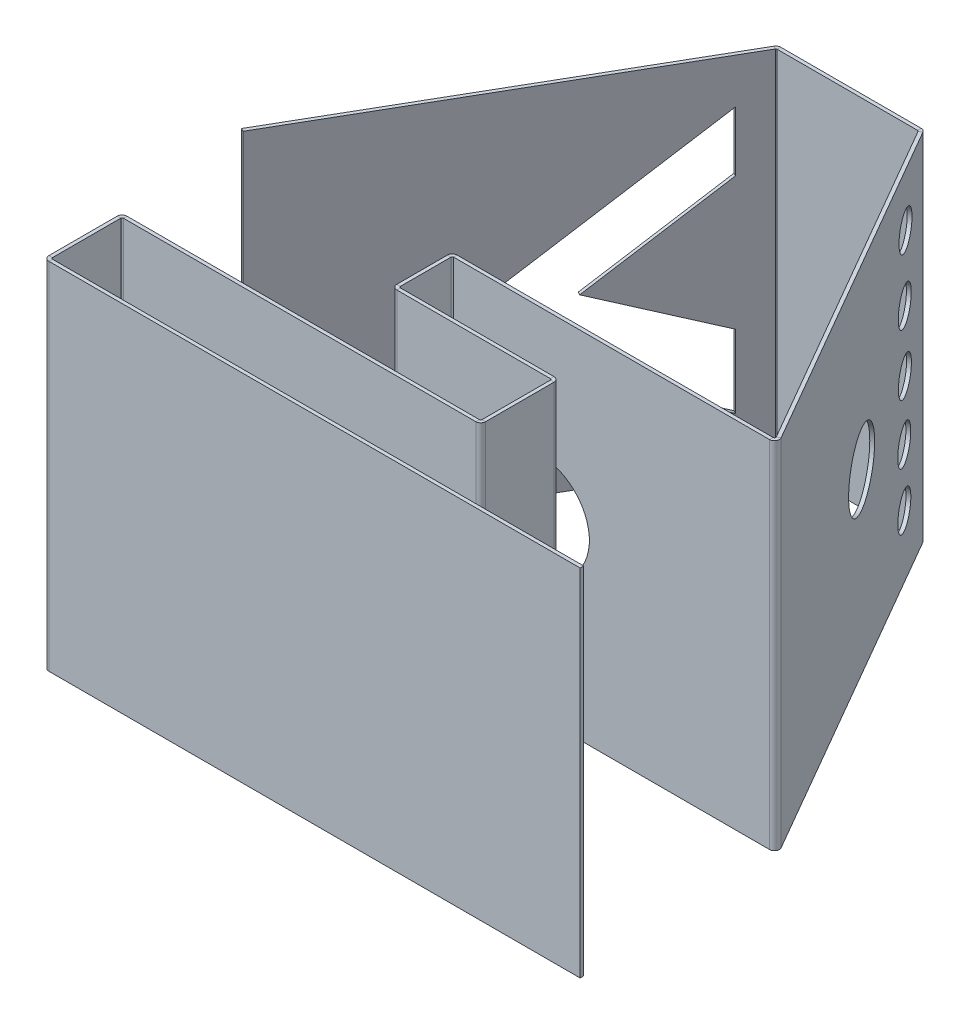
ISO-10303-21;
HEADER;
FILE_DESCRIPTION(('STEP AP214'),'2;1');
FILE_NAME('part.step','',(''),(''),'','','');
FILE_SCHEMA(('AUTOMOTIVE_DESIGN { 1 0 10303 214 1 1 1 1 }'));
ENDSEC;
DATA;
#1=APPLICATION_CONTEXT('core data for automotive mechanical design processes');
#2=APPLICATION_PROTOCOL_DEFINITION('international standard','automotive_design',2000,#1);
#3=PRODUCT_CONTEXT('',#1,'mechanical');
#4=PRODUCT('Part','Part','',(#3));
#5=PRODUCT_RELATED_PRODUCT_CATEGORY('part','',(#4));
#6=PRODUCT_DEFINITION_FORMATION('','',#4);
#7=PRODUCT_DEFINITION_CONTEXT('part definition',#1,'design');
#8=PRODUCT_DEFINITION('design','',#6,#7);
#9=PRODUCT_DEFINITION_SHAPE('','',#8);
#10=(LENGTH_UNIT() NAMED_UNIT(*) SI_UNIT(.MILLI.,.METRE.));
#11=(NAMED_UNIT(*) PLANE_ANGLE_UNIT() SI_UNIT($,.RADIAN.));
#12=(NAMED_UNIT(*) SI_UNIT($,.STERADIAN.) SOLID_ANGLE_UNIT());
#13=UNCERTAINTY_MEASURE_WITH_UNIT(LENGTH_MEASURE(1.E-05),#10,'distance_accuracy_value','');
#14=(GEOMETRIC_REPRESENTATION_CONTEXT(3) GLOBAL_UNCERTAINTY_ASSIGNED_CONTEXT((#13)) GLOBAL_UNIT_ASSIGNED_CONTEXT((#10,
#11,#12)) REPRESENTATION_CONTEXT('',''));
#15=CARTESIAN_POINT('',(0.,0.,0.));
#16=DIRECTION('',(0.,0.,1.));
#17=DIRECTION('',(1.,0.,0.));
#18=AXIS2_PLACEMENT_3D('',#15,#16,#17);
#19=CARTESIAN_POINT('',(31.9999999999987,-100.,-308.525588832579));
#20=DIRECTION('',(0.,-1.,0.));
#21=DIRECTION('',(0.,0.,-1.));
#22=AXIS2_PLACEMENT_3D('',#19,#20,#21);
#23=PLANE('',#22);
#24=DIRECTION('',(1.,0.,0.));
#25=VECTOR('',#24,1.);
#26=CARTESIAN_POINT('',(31.9999999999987,-100.,-306.525588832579));
#27=LINE('',#26,#25);
#28=CARTESIAN_POINT('',(-47.5747237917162,-100.,-306.525588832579));
#29=VERTEX_POINT('',#28);
#30=CARTESIAN_POINT('',(31.5747237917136,-100.,-306.525588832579));
#31=VERTEX_POINT('',#30);
#32=EDGE_CURVE('E508',#29,#31,#27,.T.);
#33=ORIENTED_EDGE('',*,*,#32,.F.);
#34=DIRECTION('',(0.,0.,-1.));
#35=VECTOR('',#34,1.);
#36=CARTESIAN_POINT('',(-47.5747237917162,-100.,-306.525588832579));
#37=LINE('',#36,#35);
#38=CARTESIAN_POINT('',(-47.5747237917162,-100.,-308.525588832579));
#39=VERTEX_POINT('',#38);
#40=EDGE_CURVE('E476',#29,#39,#37,.T.);
#41=ORIENTED_EDGE('',*,*,#40,.T.);
#42=DIRECTION('',(1.,0.,0.));
#43=VECTOR('',#42,1.);
#44=CARTESIAN_POINT('',(31.9999999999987,-100.,-308.525588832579));
#45=LINE('',#44,#43);
#46=CARTESIAN_POINT('',(31.5747237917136,-100.,-308.525588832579));
#47=VERTEX_POINT('',#46);
#48=EDGE_CURVE('E507',#39,#47,#45,.T.);
#49=ORIENTED_EDGE('',*,*,#48,.T.);
#50=DIRECTION('',(0.,0.,-1.));
#51=VECTOR('',#50,1.);
#52=CARTESIAN_POINT('',(31.5747237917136,-100.,-306.525588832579));
#53=LINE('',#52,#51);
#54=EDGE_CURVE('E495',#31,#47,#53,.T.);
#55=ORIENTED_EDGE('',*,*,#54,.F.);
#56=EDGE_LOOP('',(#33,#41,#49,#55));
#57=FACE_BOUND('',#56,.T.);
#58=ADVANCED_FACE('F37',(#57),#23,.T.);
#59=CARTESIAN_POINT('',(0.,0.,-308.525588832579));
#60=DIRECTION('',(0.,0.,-1.));
#61=DIRECTION('',(-1.,0.,0.));
#62=AXIS2_PLACEMENT_3D('',#59,#60,#61);
#63=PLANE('',#62);
#64=ORIENTED_EDGE('',*,*,#48,.F.);
#65=DIRECTION('',(0.,-1.,0.));
#66=VECTOR('',#65,1.);
#67=CARTESIAN_POINT('',(-47.5747237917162,-100.,-308.525588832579));
#68=LINE('',#67,#66);
#69=CARTESIAN_POINT('',(-47.5747237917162,99.9999999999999,-308.525588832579));
#70=VERTEX_POINT('',#69);
#71=EDGE_CURVE('E469',#39,#70,#68,.F.);
#72=ORIENTED_EDGE('',*,*,#71,.T.);
#73=DIRECTION('',(-1.,0.,0.));
#74=VECTOR('',#73,1.);
#75=CARTESIAN_POINT('',(-48.0000000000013,99.9999999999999,-308.525588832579));
#76=LINE('',#75,#74);
#77=CARTESIAN_POINT('',(31.5747237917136,99.9999999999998,-308.525588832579));
#78=VERTEX_POINT('',#77);
#79=EDGE_CURVE('E504',#78,#70,#76,.T.);
#80=ORIENTED_EDGE('',*,*,#79,.F.);
#81=DIRECTION('',(0.,-1.,0.));
#82=VECTOR('',#81,1.);
#83=CARTESIAN_POINT('',(31.5747237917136,0.,-308.525588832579));
#84=LINE('',#83,#82);
#85=EDGE_CURVE('E498',#78,#47,#84,.T.);
#86=ORIENTED_EDGE('',*,*,#85,.T.);
#87=EDGE_LOOP('',(#64,#72,#80,#86));
#88=FACE_BOUND('',#87,.T.);
#89=ADVANCED_FACE('F953',(#88),#63,.T.);
#90=CARTESIAN_POINT('',(0.,0.,-306.525588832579));
#91=DIRECTION('',(0.,0.,-1.));
#92=DIRECTION('',(-1.,0.,0.));
#93=AXIS2_PLACEMENT_3D('',#90,#91,#92);
#94=PLANE('',#93);
#95=DIRECTION('',(0.,-1.,0.));
#96=VECTOR('',#95,1.);
#97=CARTESIAN_POINT('',(-47.5747237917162,-100.,-306.525588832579));
#98=LINE('',#97,#96);
#99=CARTESIAN_POINT('',(-47.5747237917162,99.9999999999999,-306.525588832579));
#100=VERTEX_POINT('',#99);
#101=EDGE_CURVE('E482',#29,#100,#98,.F.);
#102=ORIENTED_EDGE('',*,*,#101,.F.);
#103=ORIENTED_EDGE('',*,*,#32,.T.);
#104=DIRECTION('',(0.,-1.,0.));
#105=VECTOR('',#104,1.);
#106=CARTESIAN_POINT('',(31.5747237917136,99.9999999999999,-306.525588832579));
#107=LINE('',#106,#105);
#108=CARTESIAN_POINT('',(31.5747237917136,99.9999999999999,-306.525588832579));
#109=VERTEX_POINT('',#108);
#110=EDGE_CURVE('E492',#109,#31,#107,.T.);
#111=ORIENTED_EDGE('',*,*,#110,.F.);
#112=DIRECTION('',(-1.,0.,0.));
#113=VECTOR('',#112,1.);
#114=CARTESIAN_POINT('',(-48.0000000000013,99.9999999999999,-306.525588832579));
#115=LINE('',#114,#113);
#116=EDGE_CURVE('E503',#109,#100,#115,.T.);
#117=ORIENTED_EDGE('',*,*,#116,.T.);
#118=EDGE_LOOP('',(#102,#103,#111,#117));
#119=FACE_BOUND('',#118,.T.);
#120=ADVANCED_FACE('F959',(#119),#94,.F.);
#121=CARTESIAN_POINT('',(143.732050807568,-100.,-117.000000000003));
#122=DIRECTION('',(0.,-1.,0.));
#123=DIRECTION('',(0.,0.,-1.));
#124=AXIS2_PLACEMENT_3D('',#121,#122,#123);
#125=PLANE('',#124);
#126=DIRECTION('',(0.500000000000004,0.,0.866025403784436));
#127=VECTOR('',#126,1.);
#128=CARTESIAN_POINT('',(142.,-100.,-116.000000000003));
#129=LINE('',#128,#127);
#130=CARTESIAN_POINT('',(32.2126381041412,-100.,-306.157288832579));
#131=VERTEX_POINT('',#130);
#132=CARTESIAN_POINT('',(141.362085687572,-100.,-117.104900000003));
#133=VERTEX_POINT('',#132);
#134=EDGE_CURVE('E553',#131,#133,#129,.T.);
#135=ORIENTED_EDGE('',*,*,#134,.F.);
#136=DIRECTION('',(0.86602540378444,0.,-0.499999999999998));
#137=VECTOR('',#136,1.);
#138=CARTESIAN_POINT('',(32.2126381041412,-100.,-306.157288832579));
#139=LINE('',#138,#137);
#140=CARTESIAN_POINT('',(33.9446889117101,-100.,-307.157288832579));
#141=VERTEX_POINT('',#140);
#142=EDGE_CURVE('E521',#131,#141,#139,.T.);
#143=ORIENTED_EDGE('',*,*,#142,.T.);
#144=DIRECTION('',(0.500000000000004,0.,0.866025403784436));
#145=VECTOR('',#144,1.);
#146=CARTESIAN_POINT('',(143.732050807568,-100.,-117.000000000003));
#147=LINE('',#146,#145);
#148=CARTESIAN_POINT('',(143.094136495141,-100.,-118.104900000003));
#149=VERTEX_POINT('',#148);
#150=EDGE_CURVE('E552',#141,#149,#147,.T.);
#151=ORIENTED_EDGE('',*,*,#150,.T.);
#152=DIRECTION('',(0.866025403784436,0.,-0.500000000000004));
#153=VECTOR('',#152,1.);
#154=CARTESIAN_POINT('',(141.362085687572,-100.,-117.104900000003));
#155=LINE('',#154,#153);
#156=EDGE_CURVE('E540',#133,#149,#155,.T.);
#157=ORIENTED_EDGE('',*,*,#156,.F.);
#158=EDGE_LOOP('',(#135,#143,#151,#157));
#159=FACE_BOUND('',#158,.T.);
#160=ADVANCED_FACE('F991',(#159),#125,.T.);
#161=CARTESIAN_POINT('',(158.461524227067,0.,-91.4878036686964));
#162=DIRECTION('',(0.866025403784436,0.,-0.500000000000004));
#163=DIRECTION('',(-0.500000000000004,0.,-0.866025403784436));
#164=AXIS2_PLACEMENT_3D('',#161,#162,#163);
#165=PLANE('',#164);
#166=CARTESIAN_POINT('',(81.1468638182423,0.,-225.400723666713));
#167=DIRECTION('',(0.866025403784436,0.,-0.500000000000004));
#168=DIRECTION('',(-0.500000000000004,0.,-0.866025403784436));
#169=AXIS2_PLACEMENT_3D('',#166,#167,#168);
#170=CIRCLE('',#169,20.);
#171=CARTESIAN_POINT('',(71.1468638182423,0.,-242.721231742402));
#172=VERTEX_POINT('',#171);
#173=EDGE_CURVE('E375',#172,#172,#170,.T.);
#174=ORIENTED_EDGE('',*,*,#173,.F.);
#175=EDGE_LOOP('',(#174));
#176=FACE_BOUND('',#175,.T.);
#177=CARTESIAN_POINT('',(48.2862344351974,-64.9836219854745,-282.317003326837));
#178=DIRECTION('',(0.866025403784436,0.,-0.500000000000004));
#179=DIRECTION('',(-0.500000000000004,0.,-0.866025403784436));
#180=AXIS2_PLACEMENT_3D('',#177,#178,#179);
#181=CIRCLE('',#180,10.);
#182=CARTESIAN_POINT('',(43.2862344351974,-64.9836219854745,-290.977257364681));
#183=VERTEX_POINT('',#182);
#184=EDGE_CURVE('E386',#183,#183,#181,.T.);
#185=ORIENTED_EDGE('',*,*,#184,.F.);
#186=EDGE_LOOP('',(#185));
#187=FACE_BOUND('',#186,.T.);
#188=CARTESIAN_POINT('',(48.3418351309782,-32.7082022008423,-282.220700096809));
#189=DIRECTION('',(0.866025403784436,0.,-0.500000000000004));
#190=DIRECTION('',(-0.500000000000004,0.,-0.866025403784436));
#191=AXIS2_PLACEMENT_3D('',#188,#189,#190);
#192=CIRCLE('',#191,10.);
#193=CARTESIAN_POINT('',(43.3418351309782,-32.7082022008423,-290.880954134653));
#194=VERTEX_POINT('',#193);
#195=EDGE_CURVE('E392',#194,#194,#192,.T.);
#196=ORIENTED_EDGE('',*,*,#195,.F.);
#197=EDGE_LOOP('',(#196));
#198=FACE_BOUND('',#197,.T.);
#199=CARTESIAN_POINT('',(47.8347580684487,0.,-283.098983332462));
#200=DIRECTION('',(0.866025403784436,0.,-0.500000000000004));
#201=DIRECTION('',(-0.500000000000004,0.,-0.866025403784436));
#202=AXIS2_PLACEMENT_3D('',#199,#200,#201);
#203=CIRCLE('',#202,10.);
#204=CARTESIAN_POINT('',(42.8347580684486,0.,-291.759237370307));
#205=VERTEX_POINT('',#204);
#206=EDGE_CURVE('E398',#205,#205,#203,.T.);
#207=ORIENTED_EDGE('',*,*,#206,.F.);
#208=EDGE_LOOP('',(#207));
#209=FACE_BOUND('',#208,.T.);
#210=CARTESIAN_POINT('',(47.9528370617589,34.4250582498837,-282.894464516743));
#211=DIRECTION('',(0.866025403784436,0.,-0.500000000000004));
#212=DIRECTION('',(-0.500000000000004,0.,-0.866025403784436));
#213=AXIS2_PLACEMENT_3D('',#210,#211,#212);
#214=CIRCLE('',#213,10.);
#215=CARTESIAN_POINT('',(42.9528370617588,34.4250582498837,-291.554718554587));
#216=VERTEX_POINT('',#215);
#217=EDGE_CURVE('E404',#216,#216,#214,.T.);
#218=ORIENTED_EDGE('',*,*,#217,.F.);
#219=EDGE_LOOP('',(#218));
#220=FACE_BOUND('',#219,.T.);
#221=CARTESIAN_POINT('',(47.3746100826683,70.4244868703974,-283.895983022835));
#222=DIRECTION('',(0.866025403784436,0.,-0.500000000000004));
#223=DIRECTION('',(-0.500000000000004,0.,-0.866025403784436));
#224=AXIS2_PLACEMENT_3D('',#221,#222,#223);
#225=CIRCLE('',#224,9.99999999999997);
#226=CARTESIAN_POINT('',(42.3746100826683,70.4244868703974,-292.556237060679));
#227=VERTEX_POINT('',#226);
#228=EDGE_CURVE('E410',#227,#227,#225,.T.);
#229=ORIENTED_EDGE('',*,*,#228,.F.);
#230=EDGE_LOOP('',(#229));
#231=FACE_BOUND('',#230,.T.);
#232=ORIENTED_EDGE('',*,*,#150,.F.);
#233=DIRECTION('',(0.,-1.,0.));
#234=VECTOR('',#233,1.);
#235=CARTESIAN_POINT('',(33.9446889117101,-100.,-307.157288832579));
#236=LINE('',#235,#234);
#237=CARTESIAN_POINT('',(33.9446889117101,99.9999999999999,-307.157288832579));
#238=VERTEX_POINT('',#237);
#239=EDGE_CURVE('E514',#141,#238,#236,.F.);
#240=ORIENTED_EDGE('',*,*,#239,.T.);
#241=DIRECTION('',(-0.500000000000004,0.,-0.866025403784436));
#242=VECTOR('',#241,1.);
#243=CARTESIAN_POINT('',(33.7320508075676,99.9999999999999,-307.525588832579));
#244=LINE('',#243,#242);
#245=CARTESIAN_POINT('',(143.094136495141,99.9999999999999,-118.104900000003));
#246=VERTEX_POINT('',#245);
#247=EDGE_CURVE('E549',#246,#238,#244,.T.);
#248=ORIENTED_EDGE('',*,*,#247,.F.);
#249=DIRECTION('',(0.,-1.,0.));
#250=VECTOR('',#249,1.);
#251=CARTESIAN_POINT('',(143.094136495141,0.,-118.104900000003));
#252=LINE('',#251,#250);
#253=EDGE_CURVE('E543',#246,#149,#252,.T.);
#254=ORIENTED_EDGE('',*,*,#253,.T.);
#255=EDGE_LOOP('',(#232,#240,#248,#254));
#256=FACE_BOUND('',#255,.T.);
#257=ADVANCED_FACE('F987',(#176,#187,#198,#209,#220,#231,#256),#165,.T.);
#258=CARTESIAN_POINT('',(156.729473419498,0.,-90.4878036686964));
#259=DIRECTION('',(0.866025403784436,0.,-0.500000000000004));
#260=DIRECTION('',(-0.500000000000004,0.,-0.866025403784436));
#261=AXIS2_PLACEMENT_3D('',#258,#259,#260);
#262=PLANE('',#261);
#263=CARTESIAN_POINT('',(79.4148130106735,0.,-224.400723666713));
#264=DIRECTION('',(0.866025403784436,0.,-0.500000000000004));
#265=DIRECTION('',(-0.500000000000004,0.,-0.866025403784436));
#266=AXIS2_PLACEMENT_3D('',#263,#264,#265);
#267=CIRCLE('',#266,20.);
#268=CARTESIAN_POINT('',(69.4148130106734,0.,-241.721231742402));
#269=VERTEX_POINT('',#268);
#270=EDGE_CURVE('E383',#269,#269,#267,.T.);
#271=ORIENTED_EDGE('',*,*,#270,.T.);
#272=EDGE_LOOP('',(#271));
#273=FACE_BOUND('',#272,.T.);
#274=CARTESIAN_POINT('',(46.5541836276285,-64.9836219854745,-281.317003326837));
#275=DIRECTION('',(0.866025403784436,0.,-0.500000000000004));
#276=DIRECTION('',(-0.500000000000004,0.,-0.866025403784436));
#277=AXIS2_PLACEMENT_3D('',#274,#275,#276);
#278=CIRCLE('',#277,10.);
#279=CARTESIAN_POINT('',(41.5541836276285,-64.9836219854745,-289.977257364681));
#280=VERTEX_POINT('',#279);
#281=EDGE_CURVE('E389',#280,#280,#278,.T.);
#282=ORIENTED_EDGE('',*,*,#281,.T.);
#283=EDGE_LOOP('',(#282));
#284=FACE_BOUND('',#283,.T.);
#285=CARTESIAN_POINT('',(46.6097843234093,-32.7082022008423,-281.220700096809));
#286=DIRECTION('',(0.866025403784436,0.,-0.500000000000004));
#287=DIRECTION('',(-0.500000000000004,0.,-0.866025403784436));
#288=AXIS2_PLACEMENT_3D('',#285,#286,#287);
#289=CIRCLE('',#288,10.);
#290=CARTESIAN_POINT('',(41.6097843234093,-32.7082022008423,-289.880954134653));
#291=VERTEX_POINT('',#290);
#292=EDGE_CURVE('E395',#291,#291,#289,.T.);
#293=ORIENTED_EDGE('',*,*,#292,.T.);
#294=EDGE_LOOP('',(#293));
#295=FACE_BOUND('',#294,.T.);
#296=CARTESIAN_POINT('',(46.1027072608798,0.,-282.098983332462));
#297=DIRECTION('',(0.866025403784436,0.,-0.500000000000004));
#298=DIRECTION('',(-0.500000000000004,0.,-0.866025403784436));
#299=AXIS2_PLACEMENT_3D('',#296,#297,#298);
#300=CIRCLE('',#299,10.);
#301=CARTESIAN_POINT('',(41.1027072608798,0.,-290.759237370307));
#302=VERTEX_POINT('',#301);
#303=EDGE_CURVE('E401',#302,#302,#300,.T.);
#304=ORIENTED_EDGE('',*,*,#303,.T.);
#305=EDGE_LOOP('',(#304));
#306=FACE_BOUND('',#305,.T.);
#307=CARTESIAN_POINT('',(46.22078625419,34.4250582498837,-281.894464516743));
#308=DIRECTION('',(0.866025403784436,0.,-0.500000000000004));
#309=DIRECTION('',(-0.500000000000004,0.,-0.866025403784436));
#310=AXIS2_PLACEMENT_3D('',#307,#308,#309);
#311=CIRCLE('',#310,10.);
#312=CARTESIAN_POINT('',(41.2207862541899,34.4250582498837,-290.554718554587));
#313=VERTEX_POINT('',#312);
#314=EDGE_CURVE('E407',#313,#313,#311,.T.);
#315=ORIENTED_EDGE('',*,*,#314,.T.);
#316=EDGE_LOOP('',(#315));
#317=FACE_BOUND('',#316,.T.);
#318=CARTESIAN_POINT('',(45.6425592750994,70.4244868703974,-282.895983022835));
#319=DIRECTION('',(0.866025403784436,0.,-0.500000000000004));
#320=DIRECTION('',(-0.500000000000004,0.,-0.866025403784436));
#321=AXIS2_PLACEMENT_3D('',#318,#319,#320);
#322=CIRCLE('',#321,9.99999999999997);
#323=CARTESIAN_POINT('',(40.6425592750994,70.4244868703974,-291.556237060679));
#324=VERTEX_POINT('',#323);
#325=EDGE_CURVE('E413',#324,#324,#322,.T.);
#326=ORIENTED_EDGE('',*,*,#325,.T.);
#327=EDGE_LOOP('',(#326));
#328=FACE_BOUND('',#327,.T.);
#329=DIRECTION('',(0.,-1.,0.));
#330=VECTOR('',#329,1.);
#331=CARTESIAN_POINT('',(32.2126381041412,-100.,-306.157288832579));
#332=LINE('',#331,#330);
#333=CARTESIAN_POINT('',(32.2126381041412,99.9999999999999,-306.157288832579));
#334=VERTEX_POINT('',#333);
#335=EDGE_CURVE('E527',#131,#334,#332,.F.);
#336=ORIENTED_EDGE('',*,*,#335,.F.);
#337=ORIENTED_EDGE('',*,*,#134,.T.);
#338=DIRECTION('',(0.,-1.,0.));
#339=VECTOR('',#338,1.);
#340=CARTESIAN_POINT('',(141.362085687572,99.9999999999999,-117.104900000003));
#341=LINE('',#340,#339);
#342=CARTESIAN_POINT('',(141.362085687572,99.9999999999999,-117.104900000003));
#343=VERTEX_POINT('',#342);
#344=EDGE_CURVE('E537',#343,#133,#341,.T.);
#345=ORIENTED_EDGE('',*,*,#344,.F.);
#346=DIRECTION('',(-0.500000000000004,0.,-0.866025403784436));
#347=VECTOR('',#346,1.);
#348=CARTESIAN_POINT('',(31.9999999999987,99.9999999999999,-306.525588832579));
#349=LINE('',#348,#347);
#350=EDGE_CURVE('E548',#343,#334,#349,.T.);
#351=ORIENTED_EDGE('',*,*,#350,.T.);
#352=EDGE_LOOP('',(#336,#337,#345,#351));
#353=FACE_BOUND('',#352,.T.);
#354=ADVANCED_FACE('F990',(#273,#284,#295,#306,#317,#328,#353),#262,.F.);
#355=CARTESIAN_POINT('',(142.,99.9999999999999,-116.000000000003));
#356=DIRECTION('',(0.,-1.,0.));
#357=DIRECTION('',(1.,0.,0.));
#358=AXIS2_PLACEMENT_3D('',#355,#356,#357);
#359=PLANE('',#358);
#360=DIRECTION('',(0.,0.,1.));
#361=VECTOR('',#360,1.);
#362=CARTESIAN_POINT('',(140.724171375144,99.9999999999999,-116.000000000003));
#363=LINE('',#362,#361);
#364=CARTESIAN_POINT('',(140.724171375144,99.9999999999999,-116.000000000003));
#365=VERTEX_POINT('',#364);
#366=CARTESIAN_POINT('',(140.724171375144,99.9999999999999,-114.000000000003));
#367=VERTEX_POINT('',#366);
#368=EDGE_CURVE('E576',#365,#367,#363,.T.);
#369=ORIENTED_EDGE('',*,*,#368,.F.);
#370=DIRECTION('',(1.,0.,0.));
#371=VECTOR('',#370,1.);
#372=CARTESIAN_POINT('',(142.,99.9999999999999,-116.000000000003));
#373=LINE('',#372,#371);
#374=CARTESIAN_POINT('',(-37.2634000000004,100.,-116.000000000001));
#375=VERTEX_POINT('',#374);
#376=EDGE_CURVE('E593',#375,#365,#373,.T.);
#377=ORIENTED_EDGE('',*,*,#376,.F.);
#378=DIRECTION('',(0.,0.,-1.));
#379=VECTOR('',#378,1.);
#380=CARTESIAN_POINT('',(-37.2634000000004,99.9999999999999,-114.000000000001));
#381=LINE('',#380,#379);
#382=CARTESIAN_POINT('',(-37.2634000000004,99.9999999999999,-114.000000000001));
#383=VERTEX_POINT('',#382);
#384=EDGE_CURVE('E584',#383,#375,#381,.T.);
#385=ORIENTED_EDGE('',*,*,#384,.F.);
#386=DIRECTION('',(1.,0.,0.));
#387=VECTOR('',#386,1.);
#388=CARTESIAN_POINT('',(142.,99.9999999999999,-114.000000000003));
#389=LINE('',#388,#387);
#390=EDGE_CURVE('E592',#383,#367,#389,.T.);
#391=ORIENTED_EDGE('',*,*,#390,.T.);
#392=EDGE_LOOP('',(#369,#377,#385,#391));
#393=FACE_BOUND('',#392,.T.);
#394=ADVANCED_FACE('F995',(#393),#359,.F.);
#395=CARTESIAN_POINT('',(-38.0000000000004,-100.,-116.000000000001));
#396=DIRECTION('',(0.,1.,0.));
#397=DIRECTION('',(0.,0.,1.));
#398=AXIS2_PLACEMENT_3D('',#395,#396,#397);
#399=PLANE('',#398);
#400=DIRECTION('',(0.,0.,1.));
#401=VECTOR('',#400,1.);
#402=CARTESIAN_POINT('',(140.724171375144,-100.,-116.000000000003));
#403=LINE('',#402,#401);
#404=CARTESIAN_POINT('',(140.724171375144,-100.,-116.000000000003));
#405=VERTEX_POINT('',#404);
#406=CARTESIAN_POINT('',(140.724171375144,-100.,-114.000000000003));
#407=VERTEX_POINT('',#406);
#408=EDGE_CURVE('E566',#405,#407,#403,.T.);
#409=ORIENTED_EDGE('',*,*,#408,.T.);
#410=DIRECTION('',(-1.,0.,0.));
#411=VECTOR('',#410,1.);
#412=CARTESIAN_POINT('',(-38.0000000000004,-100.,-114.000000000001));
#413=LINE('',#412,#411);
#414=CARTESIAN_POINT('',(-37.2634000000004,-100.,-114.000000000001));
#415=VERTEX_POINT('',#414);
#416=EDGE_CURVE('E597',#407,#415,#413,.T.);
#417=ORIENTED_EDGE('',*,*,#416,.T.);
#418=DIRECTION('',(0.,0.,-1.));
#419=VECTOR('',#418,1.);
#420=CARTESIAN_POINT('',(-37.2634000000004,-100.,-114.000000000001));
#421=LINE('',#420,#419);
#422=CARTESIAN_POINT('',(-37.2634000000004,-100.,-116.000000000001));
#423=VERTEX_POINT('',#422);
#424=EDGE_CURVE('E579',#415,#423,#421,.T.);
#425=ORIENTED_EDGE('',*,*,#424,.T.);
#426=DIRECTION('',(-1.,0.,0.));
#427=VECTOR('',#426,1.);
#428=CARTESIAN_POINT('',(-38.0000000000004,-100.,-116.000000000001));
#429=LINE('',#428,#427);
#430=EDGE_CURVE('E596',#405,#423,#429,.T.);
#431=ORIENTED_EDGE('',*,*,#430,.F.);
#432=EDGE_LOOP('',(#409,#417,#425,#431));
#433=FACE_BOUND('',#432,.T.);
#434=ADVANCED_FACE('F1024',(#433),#399,.F.);
#435=CARTESIAN_POINT('',(-8.04955761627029E-13,0.,-116.000000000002));
#436=DIRECTION('',(0.,0.,1.));
#437=DIRECTION('',(1.,0.,0.));
#438=AXIS2_PLACEMENT_3D('',#435,#436,#437);
#439=PLANE('',#438);
#440=CARTESIAN_POINT('',(11.2135237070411,0.,-116.000000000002));
#441=DIRECTION('',(0.,0.,-1.));
#442=DIRECTION('',(-1.,0.,0.));
#443=AXIS2_PLACEMENT_3D('',#440,#441,#442);
#444=CIRCLE('',#443,28.);
#445=CARTESIAN_POINT('',(-16.7864762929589,0.,-116.000000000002));
#446=VERTEX_POINT('',#445);
#447=EDGE_CURVE('E428',#446,#446,#444,.T.);
#448=ORIENTED_EDGE('',*,*,#447,.F.);
#449=EDGE_LOOP('',(#448));
#450=FACE_BOUND('',#449,.T.);
#451=DIRECTION('',(0.,-1.,0.));
#452=VECTOR('',#451,1.);
#453=CARTESIAN_POINT('',(140.724171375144,-100.,-116.000000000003));
#454=LINE('',#453,#452);
#455=EDGE_CURVE('E572',#405,#365,#454,.F.);
#456=ORIENTED_EDGE('',*,*,#455,.F.);
#457=ORIENTED_EDGE('',*,*,#430,.T.);
#458=DIRECTION('',(0.,-1.,0.));
#459=VECTOR('',#458,1.);
#460=CARTESIAN_POINT('',(-37.2634000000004,0.,-116.000000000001));
#461=LINE('',#460,#459);
#462=EDGE_CURVE('E587',#375,#423,#461,.T.);
#463=ORIENTED_EDGE('',*,*,#462,.F.);
#464=ORIENTED_EDGE('',*,*,#376,.T.);
#465=EDGE_LOOP('',(#456,#457,#463,#464));
#466=FACE_BOUND('',#465,.T.);
#467=ADVANCED_FACE('F1020',(#450,#466),#439,.F.);
#468=CARTESIAN_POINT('',(-7.91033905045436E-13,0.,-114.000000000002));
#469=DIRECTION('',(0.,0.,1.));
#470=DIRECTION('',(1.,0.,0.));
#471=AXIS2_PLACEMENT_3D('',#468,#469,#470);
#472=PLANE('',#471);
#473=CARTESIAN_POINT('',(11.2135237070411,0.,-114.000000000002));
#474=DIRECTION('',(0.,0.,-1.));
#475=DIRECTION('',(-1.,0.,0.));
#476=AXIS2_PLACEMENT_3D('',#473,#474,#475);
#477=CIRCLE('',#476,28.);
#478=CARTESIAN_POINT('',(-16.7864762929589,0.,-114.000000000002));
#479=VERTEX_POINT('',#478);
#480=EDGE_CURVE('E431',#479,#479,#477,.T.);
#481=ORIENTED_EDGE('',*,*,#480,.T.);
#482=EDGE_LOOP('',(#481));
#483=FACE_BOUND('',#482,.T.);
#484=ORIENTED_EDGE('',*,*,#416,.F.);
#485=DIRECTION('',(0.,-1.,0.));
#486=VECTOR('',#485,1.);
#487=CARTESIAN_POINT('',(140.724171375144,-100.,-114.000000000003));
#488=LINE('',#487,#486);
#489=EDGE_CURVE('E559',#407,#367,#488,.F.);
#490=ORIENTED_EDGE('',*,*,#489,.T.);
#491=ORIENTED_EDGE('',*,*,#390,.F.);
#492=DIRECTION('',(0.,1.,0.));
#493=VECTOR('',#492,1.);
#494=CARTESIAN_POINT('',(-37.2634000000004,-100.,-114.000000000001));
#495=LINE('',#494,#493);
#496=EDGE_CURVE('E582',#415,#383,#495,.T.);
#497=ORIENTED_EDGE('',*,*,#496,.F.);
#498=EDGE_LOOP('',(#484,#490,#491,#497));
#499=FACE_BOUND('',#498,.T.);
#500=ADVANCED_FACE('F1023',(#483,#499),#472,.T.);
#501=CARTESIAN_POINT('',(-40.0000000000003,100.,-84.0000000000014));
#502=DIRECTION('',(0.,1.,0.));
#503=DIRECTION('',(0.,0.,1.));
#504=AXIS2_PLACEMENT_3D('',#501,#502,#503);
#505=PLANE('',#504);
#506=DIRECTION('',(0.,0.,1.));
#507=VECTOR('',#506,1.);
#508=CARTESIAN_POINT('',(-38.0000000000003,100.,-84.0000000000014));
#509=LINE('',#508,#507);
#510=CARTESIAN_POINT('',(-38.0000000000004,99.9999999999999,-113.263400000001));
#511=VERTEX_POINT('',#510);
#512=CARTESIAN_POINT('',(-38.0000000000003,100.,-84.7366000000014));
#513=VERTEX_POINT('',#512);
#514=EDGE_CURVE('E642',#511,#513,#509,.T.);
#515=ORIENTED_EDGE('',*,*,#514,.F.);
#516=DIRECTION('',(-1.,0.,0.));
#517=VECTOR('',#516,1.);
#518=CARTESIAN_POINT('',(-38.0000000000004,99.9999999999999,-113.263400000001));
#519=LINE('',#518,#517);
#520=CARTESIAN_POINT('',(-40.0000000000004,99.9999999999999,-113.263400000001));
#521=VERTEX_POINT('',#520);
#522=EDGE_CURVE('E610',#511,#521,#519,.T.);
#523=ORIENTED_EDGE('',*,*,#522,.T.);
#524=DIRECTION('',(0.,0.,1.));
#525=VECTOR('',#524,1.);
#526=CARTESIAN_POINT('',(-40.0000000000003,100.,-84.0000000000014));
#527=LINE('',#526,#525);
#528=CARTESIAN_POINT('',(-40.0000000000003,100.,-84.7366000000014));
#529=VERTEX_POINT('',#528);
#530=EDGE_CURVE('E641',#521,#529,#527,.T.);
#531=ORIENTED_EDGE('',*,*,#530,.T.);
#532=DIRECTION('',(-1.,0.,0.));
#533=VECTOR('',#532,1.);
#534=CARTESIAN_POINT('',(-38.0000000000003,100.,-84.7366000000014));
#535=LINE('',#534,#533);
#536=EDGE_CURVE('E629',#513,#529,#535,.T.);
#537=ORIENTED_EDGE('',*,*,#536,.F.);
#538=EDGE_LOOP('',(#515,#523,#531,#537));
#539=FACE_BOUND('',#538,.T.);
#540=ADVANCED_FACE('F1028',(#539),#505,.T.);
#541=CARTESIAN_POINT('',(-40.,0.,1.38821946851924E-13));
#542=DIRECTION('',(-1.,0.,0.));
#543=DIRECTION('',(0.,0.,1.));
#544=AXIS2_PLACEMENT_3D('',#541,#542,#543);
#545=PLANE('',#544);
#546=ORIENTED_EDGE('',*,*,#530,.F.);
#547=DIRECTION('',(0.,1.,0.));
#548=VECTOR('',#547,1.);
#549=CARTESIAN_POINT('',(-40.0000000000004,99.9999999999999,-113.263400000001));
#550=LINE('',#549,#548);
#551=CARTESIAN_POINT('',(-40.0000000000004,-100.,-113.263400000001));
#552=VERTEX_POINT('',#551);
#553=EDGE_CURVE('E603',#521,#552,#550,.F.);
#554=ORIENTED_EDGE('',*,*,#553,.T.);
#555=DIRECTION('',(0.,0.,-1.));
#556=VECTOR('',#555,1.);
#557=CARTESIAN_POINT('',(-40.0000000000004,-100.,-114.000000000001));
#558=LINE('',#557,#556);
#559=CARTESIAN_POINT('',(-40.0000000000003,-100.,-84.7366000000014));
#560=VERTEX_POINT('',#559);
#561=EDGE_CURVE('E638',#560,#552,#558,.T.);
#562=ORIENTED_EDGE('',*,*,#561,.F.);
#563=DIRECTION('',(0.,1.,0.));
#564=VECTOR('',#563,1.);
#565=CARTESIAN_POINT('',(-40.0000000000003,0.,-84.7366000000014));
#566=LINE('',#565,#564);
#567=EDGE_CURVE('E632',#560,#529,#566,.T.);
#568=ORIENTED_EDGE('',*,*,#567,.T.);
#569=EDGE_LOOP('',(#546,#554,#562,#568));
#570=FACE_BOUND('',#569,.T.);
#571=ADVANCED_FACE('F1052',(#570),#545,.T.);
#572=CARTESIAN_POINT('',(-38.,0.,1.31838984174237E-13));
#573=DIRECTION('',(-1.,0.,0.));
#574=DIRECTION('',(0.,0.,1.));
#575=AXIS2_PLACEMENT_3D('',#572,#573,#574);
#576=PLANE('',#575);
#577=DIRECTION('',(0.,1.,0.));
#578=VECTOR('',#577,1.);
#579=CARTESIAN_POINT('',(-38.0000000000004,99.9999999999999,-113.263400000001));
#580=LINE('',#579,#578);
#581=CARTESIAN_POINT('',(-38.0000000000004,-100.,-113.263400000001));
#582=VERTEX_POINT('',#581);
#583=EDGE_CURVE('E616',#511,#582,#580,.F.);
#584=ORIENTED_EDGE('',*,*,#583,.F.);
#585=ORIENTED_EDGE('',*,*,#514,.T.);
#586=DIRECTION('',(0.,1.,0.));
#587=VECTOR('',#586,1.);
#588=CARTESIAN_POINT('',(-38.0000000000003,-100.,-84.7366000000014));
#589=LINE('',#588,#587);
#590=CARTESIAN_POINT('',(-38.0000000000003,-100.,-84.7366000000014));
#591=VERTEX_POINT('',#590);
#592=EDGE_CURVE('E626',#591,#513,#589,.T.);
#593=ORIENTED_EDGE('',*,*,#592,.F.);
#594=DIRECTION('',(0.,0.,-1.));
#595=VECTOR('',#594,1.);
#596=CARTESIAN_POINT('',(-38.0000000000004,-100.,-114.000000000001));
#597=LINE('',#596,#595);
#598=EDGE_CURVE('E637',#591,#582,#597,.T.);
#599=ORIENTED_EDGE('',*,*,#598,.T.);
#600=EDGE_LOOP('',(#584,#585,#593,#599));
#601=FACE_BOUND('',#600,.T.);
#602=ADVANCED_FACE('F1055',(#601),#576,.F.);
#603=CARTESIAN_POINT('',(-38.0000000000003,100.,-84.0000000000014));
#604=DIRECTION('',(0.,1.,0.));
#605=DIRECTION('',(-1.,0.,0.));
#606=AXIS2_PLACEMENT_3D('',#603,#604,#605);
#607=PLANE('',#606);
#608=DIRECTION('',(-1.,0.,0.));
#609=VECTOR('',#608,1.);
#610=CARTESIAN_POINT('',(-38.0000000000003,100.,-84.0000000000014));
#611=LINE('',#610,#609);
#612=CARTESIAN_POINT('',(49.2633999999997,100.,-84.0000000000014));
#613=VERTEX_POINT('',#612);
#614=CARTESIAN_POINT('',(-37.2634000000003,100.,-84.0000000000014));
#615=VERTEX_POINT('',#614);
#616=EDGE_CURVE('E682',#613,#615,#611,.T.);
#617=ORIENTED_EDGE('',*,*,#616,.T.);
#618=DIRECTION('',(0.,0.,1.));
#619=VECTOR('',#618,1.);
#620=CARTESIAN_POINT('',(-37.2634000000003,100.,-84.0000000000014));
#621=LINE('',#620,#619);
#622=CARTESIAN_POINT('',(-37.2634000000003,100.,-82.0000000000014));
#623=VERTEX_POINT('',#622);
#624=EDGE_CURVE('E654',#615,#623,#621,.T.);
#625=ORIENTED_EDGE('',*,*,#624,.T.);
#626=DIRECTION('',(-1.,0.,0.));
#627=VECTOR('',#626,1.);
#628=CARTESIAN_POINT('',(-38.0000000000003,100.,-82.0000000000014));
#629=LINE('',#628,#627);
#630=CARTESIAN_POINT('',(49.2633999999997,100.,-82.0000000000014));
#631=VERTEX_POINT('',#630);
#632=EDGE_CURVE('E681',#631,#623,#629,.T.);
#633=ORIENTED_EDGE('',*,*,#632,.F.);
#634=DIRECTION('',(0.,0.,-1.));
#635=VECTOR('',#634,1.);
#636=CARTESIAN_POINT('',(49.2633999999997,100.,-82.0000000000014));
#637=LINE('',#636,#635);
#638=EDGE_CURVE('E668',#631,#613,#637,.T.);
#639=ORIENTED_EDGE('',*,*,#638,.T.);
#640=EDGE_LOOP('',(#617,#625,#633,#639));
#641=FACE_BOUND('',#640,.T.);
#642=ADVANCED_FACE('F1059',(#641),#607,.T.);
#643=CARTESIAN_POINT('',(0.,0.,-84.0000000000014));
#644=DIRECTION('',(0.,0.,-1.));
#645=DIRECTION('',(-1.,0.,0.));
#646=AXIS2_PLACEMENT_3D('',#643,#644,#645);
#647=PLANE('',#646);
#648=CARTESIAN_POINT('',(9.47519919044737,0.,-84.0000000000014));
#649=DIRECTION('',(0.,0.,-1.));
#650=DIRECTION('',(-1.,0.,0.));
#651=AXIS2_PLACEMENT_3D('',#648,#649,#650);
#652=CIRCLE('',#651,20.);
#653=CARTESIAN_POINT('',(-10.5248008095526,0.,-84.0000000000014));
#654=VERTEX_POINT('',#653);
#655=EDGE_CURVE('E422',#654,#654,#652,.T.);
#656=ORIENTED_EDGE('',*,*,#655,.F.);
#657=EDGE_LOOP('',(#656));
#658=FACE_BOUND('',#657,.T.);
#659=DIRECTION('',(1.,0.,0.));
#660=VECTOR('',#659,1.);
#661=CARTESIAN_POINT('',(49.9999999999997,-100.,-84.0000000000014));
#662=LINE('',#661,#660);
#663=CARTESIAN_POINT('',(-37.2634000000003,-100.,-84.0000000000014));
#664=VERTEX_POINT('',#663);
#665=CARTESIAN_POINT('',(49.2633999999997,-100.,-84.0000000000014));
#666=VERTEX_POINT('',#665);
#667=EDGE_CURVE('E685',#664,#666,#662,.T.);
#668=ORIENTED_EDGE('',*,*,#667,.F.);
#669=DIRECTION('',(0.,1.,0.));
#670=VECTOR('',#669,1.);
#671=CARTESIAN_POINT('',(-37.2634000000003,100.,-84.0000000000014));
#672=LINE('',#671,#670);
#673=EDGE_CURVE('E660',#615,#664,#672,.F.);
#674=ORIENTED_EDGE('',*,*,#673,.F.);
#675=ORIENTED_EDGE('',*,*,#616,.F.);
#676=DIRECTION('',(0.,-1.,0.));
#677=VECTOR('',#676,1.);
#678=CARTESIAN_POINT('',(49.2633999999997,0.,-84.0000000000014));
#679=LINE('',#678,#677);
#680=EDGE_CURVE('E676',#613,#666,#679,.T.);
#681=ORIENTED_EDGE('',*,*,#680,.T.);
#682=EDGE_LOOP('',(#668,#674,#675,#681));
#683=FACE_BOUND('',#682,.T.);
#684=ADVANCED_FACE('F1084',(#658,#683),#647,.T.);
#685=CARTESIAN_POINT('',(0.,0.,-82.0000000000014));
#686=DIRECTION('',(0.,0.,-1.));
#687=DIRECTION('',(-1.,0.,0.));
#688=AXIS2_PLACEMENT_3D('',#685,#686,#687);
#689=PLANE('',#688);
#690=CARTESIAN_POINT('',(9.47519919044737,0.,-82.0000000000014));
#691=DIRECTION('',(0.,0.,-1.));
#692=DIRECTION('',(-1.,0.,0.));
#693=AXIS2_PLACEMENT_3D('',#690,#691,#692);
#694=CIRCLE('',#693,20.);
#695=CARTESIAN_POINT('',(-10.5248008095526,0.,-82.0000000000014));
#696=VERTEX_POINT('',#695);
#697=EDGE_CURVE('E425',#696,#696,#694,.T.);
#698=ORIENTED_EDGE('',*,*,#697,.T.);
#699=EDGE_LOOP('',(#698));
#700=FACE_BOUND('',#699,.T.);
#701=DIRECTION('',(0.,1.,0.));
#702=VECTOR('',#701,1.);
#703=CARTESIAN_POINT('',(-37.2634000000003,100.,-82.0000000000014));
#704=LINE('',#703,#702);
#705=CARTESIAN_POINT('',(-37.2634000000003,-100.,-82.0000000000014));
#706=VERTEX_POINT('',#705);
#707=EDGE_CURVE('E648',#623,#706,#704,.F.);
#708=ORIENTED_EDGE('',*,*,#707,.T.);
#709=DIRECTION('',(1.,0.,0.));
#710=VECTOR('',#709,1.);
#711=CARTESIAN_POINT('',(49.9999999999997,-100.,-82.0000000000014));
#712=LINE('',#711,#710);
#713=CARTESIAN_POINT('',(49.2633999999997,-100.,-82.0000000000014));
#714=VERTEX_POINT('',#713);
#715=EDGE_CURVE('E686',#706,#714,#712,.T.);
#716=ORIENTED_EDGE('',*,*,#715,.T.);
#717=DIRECTION('',(0.,-1.,0.));
#718=VECTOR('',#717,1.);
#719=CARTESIAN_POINT('',(49.2633999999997,100.,-82.0000000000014));
#720=LINE('',#719,#718);
#721=EDGE_CURVE('E670',#631,#714,#720,.T.);
#722=ORIENTED_EDGE('',*,*,#721,.F.);
#723=ORIENTED_EDGE('',*,*,#632,.T.);
#724=EDGE_LOOP('',(#708,#716,#722,#723));
#725=FACE_BOUND('',#724,.T.);
#726=ADVANCED_FACE('F1087',(#700,#725),#689,.F.);
#727=CARTESIAN_POINT('',(51.9999999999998,-100.,-42.0000000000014));
#728=DIRECTION('',(0.,-1.,0.));
#729=DIRECTION('',(0.,0.,-1.));
#730=AXIS2_PLACEMENT_3D('',#727,#728,#729);
#731=PLANE('',#730);
#732=DIRECTION('',(0.,0.,1.));
#733=VECTOR('',#732,1.);
#734=CARTESIAN_POINT('',(49.9999999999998,-100.,-42.0000000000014));
#735=LINE('',#734,#733);
#736=CARTESIAN_POINT('',(49.9999999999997,-100.,-81.2634000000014));
#737=VERTEX_POINT('',#736);
#738=CARTESIAN_POINT('',(49.9999999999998,-100.,-42.7366000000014));
#739=VERTEX_POINT('',#738);
#740=EDGE_CURVE('E731',#737,#739,#735,.T.);
#741=ORIENTED_EDGE('',*,*,#740,.F.);
#742=DIRECTION('',(1.,0.,0.));
#743=VECTOR('',#742,1.);
#744=CARTESIAN_POINT('',(49.9999999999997,-100.,-81.2634000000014));
#745=LINE('',#744,#743);
#746=CARTESIAN_POINT('',(51.9999999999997,-100.,-81.2634000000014));
#747=VERTEX_POINT('',#746);
#748=EDGE_CURVE('E699',#737,#747,#745,.T.);
#749=ORIENTED_EDGE('',*,*,#748,.T.);
#750=DIRECTION('',(0.,0.,1.));
#751=VECTOR('',#750,1.);
#752=CARTESIAN_POINT('',(51.9999999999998,-100.,-42.0000000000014));
#753=LINE('',#752,#751);
#754=CARTESIAN_POINT('',(51.9999999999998,-100.,-42.7366000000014));
#755=VERTEX_POINT('',#754);
#756=EDGE_CURVE('E730',#747,#755,#753,.T.);
#757=ORIENTED_EDGE('',*,*,#756,.T.);
#758=DIRECTION('',(1.,0.,0.));
#759=VECTOR('',#758,1.);
#760=CARTESIAN_POINT('',(49.9999999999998,-100.,-42.7366000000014));
#761=LINE('',#760,#759);
#762=EDGE_CURVE('E718',#739,#755,#761,.T.);
#763=ORIENTED_EDGE('',*,*,#762,.F.);
#764=EDGE_LOOP('',(#741,#749,#757,#763));
#765=FACE_BOUND('',#764,.T.);
#766=ADVANCED_FACE('F929',(#765),#731,.T.);
#767=CARTESIAN_POINT('',(52.,0.,-1.80436561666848E-13));
#768=DIRECTION('',(1.,0.,0.));
#769=DIRECTION('',(0.,0.,-1.));
#770=AXIS2_PLACEMENT_3D('',#767,#768,#769);
#771=PLANE('',#770);
#772=ORIENTED_EDGE('',*,*,#756,.F.);
#773=DIRECTION('',(0.,-1.,0.));
#774=VECTOR('',#773,1.);
#775=CARTESIAN_POINT('',(51.9999999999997,-100.,-81.2634000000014));
#776=LINE('',#775,#774);
#777=CARTESIAN_POINT('',(51.9999999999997,100.,-81.2634000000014));
#778=VERTEX_POINT('',#777);
#779=EDGE_CURVE('E692',#747,#778,#776,.F.);
#780=ORIENTED_EDGE('',*,*,#779,.T.);
#781=DIRECTION('',(0.,0.,-1.));
#782=VECTOR('',#781,1.);
#783=CARTESIAN_POINT('',(51.9999999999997,100.,-82.0000000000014));
#784=LINE('',#783,#782);
#785=CARTESIAN_POINT('',(51.9999999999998,100.,-42.7366000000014));
#786=VERTEX_POINT('',#785);
#787=EDGE_CURVE('E727',#786,#778,#784,.T.);
#788=ORIENTED_EDGE('',*,*,#787,.F.);
#789=DIRECTION('',(0.,-1.,0.));
#790=VECTOR('',#789,1.);
#791=CARTESIAN_POINT('',(51.9999999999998,0.,-42.7366000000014));
#792=LINE('',#791,#790);
#793=EDGE_CURVE('E721',#786,#755,#792,.T.);
#794=ORIENTED_EDGE('',*,*,#793,.T.);
#795=EDGE_LOOP('',(#772,#780,#788,#794));
#796=FACE_BOUND('',#795,.T.);
#797=ADVANCED_FACE('F919',(#796),#771,.T.);
#798=CARTESIAN_POINT('',(50.,0.,-1.73472347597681E-13));
#799=DIRECTION('',(1.,0.,0.));
#800=DIRECTION('',(0.,0.,-1.));
#801=AXIS2_PLACEMENT_3D('',#798,#799,#800);
#802=PLANE('',#801);
#803=DIRECTION('',(0.,-1.,0.));
#804=VECTOR('',#803,1.);
#805=CARTESIAN_POINT('',(49.9999999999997,-100.,-81.2634000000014));
#806=LINE('',#805,#804);
#807=CARTESIAN_POINT('',(49.9999999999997,100.,-81.2634000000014));
#808=VERTEX_POINT('',#807);
#809=EDGE_CURVE('E705',#737,#808,#806,.F.);
#810=ORIENTED_EDGE('',*,*,#809,.F.);
#811=ORIENTED_EDGE('',*,*,#740,.T.);
#812=DIRECTION('',(0.,-1.,0.));
#813=VECTOR('',#812,1.);
#814=CARTESIAN_POINT('',(49.9999999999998,100.,-42.7366000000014));
#815=LINE('',#814,#813);
#816=CARTESIAN_POINT('',(49.9999999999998,100.,-42.7366000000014));
#817=VERTEX_POINT('',#816);
#818=EDGE_CURVE('E715',#817,#739,#815,.T.);
#819=ORIENTED_EDGE('',*,*,#818,.F.);
#820=DIRECTION('',(0.,0.,-1.));
#821=VECTOR('',#820,1.);
#822=CARTESIAN_POINT('',(49.9999999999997,100.,-82.0000000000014));
#823=LINE('',#822,#821);
#824=EDGE_CURVE('E726',#817,#808,#823,.T.);
#825=ORIENTED_EDGE('',*,*,#824,.T.);
#826=EDGE_LOOP('',(#810,#811,#819,#825));
#827=FACE_BOUND('',#826,.T.);
#828=ADVANCED_FACE('F934',(#827),#802,.F.);
#829=CARTESIAN_POINT('',(49.9999999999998,-100.,-42.0000000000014));
#830=DIRECTION('',(0.,-1.,0.));
#831=DIRECTION('',(1.,0.,0.));
#832=AXIS2_PLACEMENT_3D('',#829,#830,#831);
#833=PLANE('',#832);
#834=DIRECTION('',(1.,0.,0.));
#835=VECTOR('',#834,1.);
#836=CARTESIAN_POINT('',(49.9999999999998,-100.,-42.0000000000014));
#837=LINE('',#836,#835);
#838=CARTESIAN_POINT('',(-149.2634,-100.,-42.));
#839=VERTEX_POINT('',#838);
#840=CARTESIAN_POINT('',(49.2633999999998,-100.,-42.0000000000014));
#841=VERTEX_POINT('',#840);
#842=EDGE_CURVE('E771',#839,#841,#837,.T.);
#843=ORIENTED_EDGE('',*,*,#842,.T.);
#844=DIRECTION('',(0.,0.,1.));
#845=VECTOR('',#844,1.);
#846=CARTESIAN_POINT('',(49.2633999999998,-100.,-42.0000000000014));
#847=LINE('',#846,#845);
#848=CARTESIAN_POINT('',(49.2633999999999,-100.,-40.0000000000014));
#849=VERTEX_POINT('',#848);
#850=EDGE_CURVE('E743',#841,#849,#847,.T.);
#851=ORIENTED_EDGE('',*,*,#850,.T.);
#852=DIRECTION('',(1.,0.,0.));
#853=VECTOR('',#852,1.);
#854=CARTESIAN_POINT('',(49.9999999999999,-100.,-40.0000000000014));
#855=LINE('',#854,#853);
#856=CARTESIAN_POINT('',(-149.2634,-100.,-40.));
#857=VERTEX_POINT('',#856);
#858=EDGE_CURVE('E770',#857,#849,#855,.T.);
#859=ORIENTED_EDGE('',*,*,#858,.F.);
#860=DIRECTION('',(0.,0.,-1.));
#861=VECTOR('',#860,1.);
#862=CARTESIAN_POINT('',(-149.2634,-100.,-40.));
#863=LINE('',#862,#861);
#864=EDGE_CURVE('E757',#857,#839,#863,.T.);
#865=ORIENTED_EDGE('',*,*,#864,.T.);
#866=EDGE_LOOP('',(#843,#851,#859,#865));
#867=FACE_BOUND('',#866,.T.);
#868=ADVANCED_FACE('F899',(#867),#833,.T.);
#869=CARTESIAN_POINT('',(-2.92865391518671E-13,0.,-42.0000000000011));
#870=DIRECTION('',(0.,0.,-1.));
#871=DIRECTION('',(-1.,0.,0.));
#872=AXIS2_PLACEMENT_3D('',#869,#870,#871);
#873=PLANE('',#872);
#874=CARTESIAN_POINT('',(5.17847238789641,-10.2819500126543,-42.0000000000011));
#875=DIRECTION('',(0.,0.,-1.));
#876=DIRECTION('',(-1.,0.,0.));
#877=AXIS2_PLACEMENT_3D('',#874,#875,#876);
#878=CIRCLE('',#877,10.);
#879=CARTESIAN_POINT('',(-4.82152761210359,-10.2819500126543,-42.000000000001));
#880=VERTEX_POINT('',#879);
#881=EDGE_CURVE('E416',#880,#880,#878,.T.);
#882=ORIENTED_EDGE('',*,*,#881,.F.);
#883=EDGE_LOOP('',(#882));
#884=FACE_BOUND('',#883,.T.);
#885=DIRECTION('',(-1.,0.,0.));
#886=VECTOR('',#885,1.);
#887=CARTESIAN_POINT('',(-150.,100.,-42.));
#888=LINE('',#887,#886);
#889=CARTESIAN_POINT('',(49.2633999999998,100.,-42.0000000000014));
#890=VERTEX_POINT('',#889);
#891=CARTESIAN_POINT('',(-149.2634,100.,-42.));
#892=VERTEX_POINT('',#891);
#893=EDGE_CURVE('E774',#890,#892,#888,.T.);
#894=ORIENTED_EDGE('',*,*,#893,.F.);
#895=DIRECTION('',(0.,-1.,0.));
#896=VECTOR('',#895,1.);
#897=CARTESIAN_POINT('',(49.2633999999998,-100.,-42.0000000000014));
#898=LINE('',#897,#896);
#899=EDGE_CURVE('E749',#841,#890,#898,.F.);
#900=ORIENTED_EDGE('',*,*,#899,.F.);
#901=ORIENTED_EDGE('',*,*,#842,.F.);
#902=DIRECTION('',(0.,1.,0.));
#903=VECTOR('',#902,1.);
#904=CARTESIAN_POINT('',(-149.2634,0.,-42.));
#905=LINE('',#904,#903);
#906=EDGE_CURVE('E765',#839,#892,#905,.T.);
#907=ORIENTED_EDGE('',*,*,#906,.T.);
#908=EDGE_LOOP('',(#894,#900,#901,#907));
#909=FACE_BOUND('',#908,.T.);
#910=ADVANCED_FACE('F903',(#884,#909),#873,.T.);
#911=CARTESIAN_POINT('',(-2.78943534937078E-13,0.,-40.0000000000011));
#912=DIRECTION('',(0.,0.,-1.));
#913=DIRECTION('',(-1.,0.,0.));
#914=AXIS2_PLACEMENT_3D('',#911,#912,#913);
#915=PLANE('',#914);
#916=CARTESIAN_POINT('',(5.17847238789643,-10.2819500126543,-40.0000000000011));
#917=DIRECTION('',(0.,0.,-1.));
#918=DIRECTION('',(-1.,0.,0.));
#919=AXIS2_PLACEMENT_3D('',#916,#917,#918);
#920=CIRCLE('',#919,10.);
#921=CARTESIAN_POINT('',(-4.82152761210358,-10.2819500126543,-40.000000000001));
#922=VERTEX_POINT('',#921);
#923=EDGE_CURVE('E419',#922,#922,#920,.T.);
#924=ORIENTED_EDGE('',*,*,#923,.T.);
#925=EDGE_LOOP('',(#924));
#926=FACE_BOUND('',#925,.T.);
#927=DIRECTION('',(0.,-1.,0.));
#928=VECTOR('',#927,1.);
#929=CARTESIAN_POINT('',(49.2633999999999,-100.,-40.0000000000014));
#930=LINE('',#929,#928);
#931=CARTESIAN_POINT('',(49.2633999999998,100.,-40.0000000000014));
#932=VERTEX_POINT('',#931);
#933=EDGE_CURVE('E737',#849,#932,#930,.F.);
#934=ORIENTED_EDGE('',*,*,#933,.T.);
#935=DIRECTION('',(-1.,0.,0.));
#936=VECTOR('',#935,1.);
#937=CARTESIAN_POINT('',(-150.,100.,-40.));
#938=LINE('',#937,#936);
#939=CARTESIAN_POINT('',(-149.2634,100.,-40.));
#940=VERTEX_POINT('',#939);
#941=EDGE_CURVE('E775',#932,#940,#938,.T.);
#942=ORIENTED_EDGE('',*,*,#941,.T.);
#943=DIRECTION('',(0.,1.,0.));
#944=VECTOR('',#943,1.);
#945=CARTESIAN_POINT('',(-149.2634,-100.,-40.));
#946=LINE('',#945,#944);
#947=EDGE_CURVE('E759',#857,#940,#946,.T.);
#948=ORIENTED_EDGE('',*,*,#947,.F.);
#949=ORIENTED_EDGE('',*,*,#858,.T.);
#950=EDGE_LOOP('',(#934,#942,#948,#949));
#951=FACE_BOUND('',#950,.T.);
#952=ADVANCED_FACE('F939',(#926,#951),#915,.F.);
#953=CARTESIAN_POINT('',(-152.,100.,-40.));
#954=DIRECTION('',(0.,-1.,0.));
#955=DIRECTION('',(0.,0.,-1.));
#956=AXIS2_PLACEMENT_3D('',#953,#954,#955);
#957=PLANE('',#956);
#958=DIRECTION('',(-1.,0.,0.));
#959=VECTOR('',#958,1.);
#960=CARTESIAN_POINT('',(-150.,100.,-39.2634));
#961=LINE('',#960,#959);
#962=CARTESIAN_POINT('',(-150.,100.,-39.2634));
#963=VERTEX_POINT('',#962);
#964=CARTESIAN_POINT('',(-152.,100.,-39.2634));
#965=VERTEX_POINT('',#964);
#966=EDGE_CURVE('E787',#963,#965,#961,.T.);
#967=ORIENTED_EDGE('',*,*,#966,.T.);
#968=DIRECTION('',(0.,0.,-1.));
#969=VECTOR('',#968,1.);
#970=CARTESIAN_POINT('',(-152.,100.,-40.));
#971=LINE('',#970,#969);
#972=CARTESIAN_POINT('',(-152.,100.,-0.736599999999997));
#973=VERTEX_POINT('',#972);
#974=EDGE_CURVE('E815',#973,#965,#971,.T.);
#975=ORIENTED_EDGE('',*,*,#974,.F.);
#976=DIRECTION('',(-1.,0.,0.));
#977=VECTOR('',#976,1.);
#978=CARTESIAN_POINT('',(-150.,100.,-0.736600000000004));
#979=LINE('',#978,#977);
#980=CARTESIAN_POINT('',(-150.,100.,-0.736600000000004));
#981=VERTEX_POINT('',#980);
#982=EDGE_CURVE('E806',#981,#973,#979,.T.);
#983=ORIENTED_EDGE('',*,*,#982,.F.);
#984=DIRECTION('',(0.,0.,-1.));
#985=VECTOR('',#984,1.);
#986=CARTESIAN_POINT('',(-150.,100.,-40.));
#987=LINE('',#986,#985);
#988=EDGE_CURVE('E814',#981,#963,#987,.T.);
#989=ORIENTED_EDGE('',*,*,#988,.T.);
#990=EDGE_LOOP('',(#967,#975,#983,#989));
#991=FACE_BOUND('',#990,.T.);
#992=ADVANCED_FACE('F1767',(#991),#957,.F.);
#993=CARTESIAN_POINT('',(-152.,-100.,0.));
#994=DIRECTION('',(0.,1.,0.));
#995=DIRECTION('',(0.,0.,1.));
#996=AXIS2_PLACEMENT_3D('',#993,#994,#995);
#997=PLANE('',#996);
#998=DIRECTION('',(-1.,0.,0.));
#999=VECTOR('',#998,1.);
#1000=CARTESIAN_POINT('',(-150.,-100.,-39.2634));
#1001=LINE('',#1000,#999);
#1002=CARTESIAN_POINT('',(-150.,-100.,-39.2634));
#1003=VERTEX_POINT('',#1002);
#1004=CARTESIAN_POINT('',(-152.,-100.,-39.2634));
#1005=VERTEX_POINT('',#1004);
#1006=EDGE_CURVE('E798',#1003,#1005,#1001,.T.);
#1007=ORIENTED_EDGE('',*,*,#1006,.F.);
#1008=DIRECTION('',(0.,0.,1.));
#1009=VECTOR('',#1008,1.);
#1010=CARTESIAN_POINT('',(-150.,-100.,0.));
#1011=LINE('',#1010,#1009);
#1012=CARTESIAN_POINT('',(-150.,-100.,-0.736600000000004));
#1013=VERTEX_POINT('',#1012);
#1014=EDGE_CURVE('E818',#1003,#1013,#1011,.T.);
#1015=ORIENTED_EDGE('',*,*,#1014,.T.);
#1016=DIRECTION('',(-1.,0.,0.));
#1017=VECTOR('',#1016,1.);
#1018=CARTESIAN_POINT('',(-150.,-100.,-0.736600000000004));
#1019=LINE('',#1018,#1017);
#1020=CARTESIAN_POINT('',(-152.,-100.,-0.736599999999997));
#1021=VERTEX_POINT('',#1020);
#1022=EDGE_CURVE('E801',#1013,#1021,#1019,.T.);
#1023=ORIENTED_EDGE('',*,*,#1022,.T.);
#1024=DIRECTION('',(0.,0.,1.));
#1025=VECTOR('',#1024,1.);
#1026=CARTESIAN_POINT('',(-152.,-100.,0.));
#1027=LINE('',#1026,#1025);
#1028=EDGE_CURVE('E817',#1005,#1021,#1027,.T.);
#1029=ORIENTED_EDGE('',*,*,#1028,.F.);
#1030=EDGE_LOOP('',(#1007,#1015,#1023,#1029));
#1031=FACE_BOUND('',#1030,.T.);
#1032=ADVANCED_FACE('F883',(#1031),#997,.F.);
#1033=CARTESIAN_POINT('',(-152.,0.,5.27400005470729E-13));
#1034=DIRECTION('',(1.,0.,0.));
#1035=DIRECTION('',(0.,0.,-1.));
#1036=AXIS2_PLACEMENT_3D('',#1033,#1034,#1035);
#1037=PLANE('',#1036);
#1038=DIRECTION('',(0.,1.,0.));
#1039=VECTOR('',#1038,1.);
#1040=CARTESIAN_POINT('',(-152.,100.,-39.2634));
#1041=LINE('',#1040,#1039);
#1042=EDGE_CURVE('E781',#965,#1005,#1041,.F.);
#1043=ORIENTED_EDGE('',*,*,#1042,.T.);
#1044=ORIENTED_EDGE('',*,*,#1028,.T.);
#1045=DIRECTION('',(0.,-1.,0.));
#1046=VECTOR('',#1045,1.);
#1047=CARTESIAN_POINT('',(-152.,0.,-0.736599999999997));
#1048=LINE('',#1047,#1046);
#1049=EDGE_CURVE('E809',#973,#1021,#1048,.T.);
#1050=ORIENTED_EDGE('',*,*,#1049,.F.);
#1051=ORIENTED_EDGE('',*,*,#974,.T.);
#1052=EDGE_LOOP('',(#1043,#1044,#1050,#1051));
#1053=FACE_BOUND('',#1052,.T.);
#1054=ADVANCED_FACE('F1835',(#1053),#1037,.F.);
#1055=CARTESIAN_POINT('',(-150.,0.,5.20417042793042E-13));
#1056=DIRECTION('',(1.,0.,0.));
#1057=DIRECTION('',(0.,0.,-1.));
#1058=AXIS2_PLACEMENT_3D('',#1055,#1056,#1057);
#1059=PLANE('',#1058);
#1060=ORIENTED_EDGE('',*,*,#1014,.F.);
#1061=DIRECTION('',(0.,1.,0.));
#1062=VECTOR('',#1061,1.);
#1063=CARTESIAN_POINT('',(-150.,100.,-39.2634));
#1064=LINE('',#1063,#1062);
#1065=EDGE_CURVE('E793',#963,#1003,#1064,.F.);
#1066=ORIENTED_EDGE('',*,*,#1065,.F.);
#1067=ORIENTED_EDGE('',*,*,#988,.F.);
#1068=DIRECTION('',(0.,1.,0.));
#1069=VECTOR('',#1068,1.);
#1070=CARTESIAN_POINT('',(-150.,-100.,-0.736600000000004));
#1071=LINE('',#1070,#1069);
#1072=EDGE_CURVE('E804',#1013,#981,#1071,.T.);
#1073=ORIENTED_EDGE('',*,*,#1072,.F.);
#1074=EDGE_LOOP('',(#1060,#1066,#1067,#1073));
#1075=FACE_BOUND('',#1074,.T.);
#1076=ADVANCED_FACE('F886',(#1075),#1059,.T.);
#1077=CARTESIAN_POINT('',(150.,-100.,2.));
#1078=DIRECTION('',(0.,1.,0.));
#1079=DIRECTION('',(-1.,0.,0.));
#1080=AXIS2_PLACEMENT_3D('',#1077,#1078,#1079);
#1081=PLANE('',#1080);
#1082=DIRECTION('',(0.,0.,1.));
#1083=VECTOR('',#1082,1.);
#1084=CARTESIAN_POINT('',(-149.2634,-100.,0.));
#1085=LINE('',#1084,#1083);
#1086=CARTESIAN_POINT('',(-149.2634,-100.,0.));
#1087=VERTEX_POINT('',#1086);
#1088=CARTESIAN_POINT('',(-149.2634,-100.,2.));
#1089=VERTEX_POINT('',#1088);
#1090=EDGE_CURVE('E841',#1087,#1089,#1085,.T.);
#1091=ORIENTED_EDGE('',*,*,#1090,.F.);
#1092=DIRECTION('',(1.,0.,0.));
#1093=VECTOR('',#1092,1.);
#1094=CARTESIAN_POINT('',(150.,-100.,0.));
#1095=LINE('',#1094,#1093);
#1096=CARTESIAN_POINT('',(150.,-100.,0.));
#1097=VERTEX_POINT('',#1096);
#1098=EDGE_CURVE('E844',#1087,#1097,#1095,.T.);
#1099=ORIENTED_EDGE('',*,*,#1098,.T.);
#1100=DIRECTION('',(0.,0.,-1.));
#1101=VECTOR('',#1100,1.);
#1102=CARTESIAN_POINT('',(150.,-100.,2.));
#1103=LINE('',#1102,#1101);
#1104=CARTESIAN_POINT('',(150.,-100.,2.));
#1105=VERTEX_POINT('',#1104);
#1106=EDGE_CURVE('E11',#1105,#1097,#1103,.T.);
#1107=ORIENTED_EDGE('',*,*,#1106,.F.);
#1108=DIRECTION('',(1.,0.,0.));
#1109=VECTOR('',#1108,1.);
#1110=CARTESIAN_POINT('',(150.,-100.,2.));
#1111=LINE('',#1110,#1109);
#1112=EDGE_CURVE('E847',#1089,#1105,#1111,.T.);
#1113=ORIENTED_EDGE('',*,*,#1112,.F.);
#1114=EDGE_LOOP('',(#1091,#1099,#1107,#1113));
#1115=FACE_BOUND('',#1114,.T.);
#1116=ADVANCED_FACE('F39',(#1115),#1081,.F.);
#1117=CARTESIAN_POINT('',(150.,100.,2.));
#1118=DIRECTION('',(0.,-1.,0.));
#1119=DIRECTION('',(1.,0.,0.));
#1120=AXIS2_PLACEMENT_3D('',#1117,#1118,#1119);
#1121=PLANE('',#1120);
#1122=DIRECTION('',(0.,0.,1.));
#1123=VECTOR('',#1122,1.);
#1124=CARTESIAN_POINT('',(-149.2634,100.,0.));
#1125=LINE('',#1124,#1123);
#1126=CARTESIAN_POINT('',(-149.2634,100.,0.));
#1127=VERTEX_POINT('',#1126);
#1128=CARTESIAN_POINT('',(-149.2634,100.,2.));
#1129=VERTEX_POINT('',#1128);
#1130=EDGE_CURVE('E831',#1127,#1129,#1125,.T.);
#1131=ORIENTED_EDGE('',*,*,#1130,.T.);
#1132=DIRECTION('',(-1.,0.,0.));
#1133=VECTOR('',#1132,1.);
#1134=CARTESIAN_POINT('',(150.,100.,2.));
#1135=LINE('',#1134,#1133);
#1136=CARTESIAN_POINT('',(150.,100.,2.));
#1137=VERTEX_POINT('',#1136);
#1138=EDGE_CURVE('E852',#1137,#1129,#1135,.T.);
#1139=ORIENTED_EDGE('',*,*,#1138,.F.);
#1140=DIRECTION('',(0.,0.,-1.));
#1141=VECTOR('',#1140,1.);
#1142=CARTESIAN_POINT('',(150.,100.,2.));
#1143=LINE('',#1142,#1141);
#1144=CARTESIAN_POINT('',(150.,100.,0.));
#1145=VERTEX_POINT('',#1144);
#1146=EDGE_CURVE('E45',#1137,#1145,#1143,.T.);
#1147=ORIENTED_EDGE('',*,*,#1146,.T.);
#1148=DIRECTION('',(-1.,0.,0.));
#1149=VECTOR('',#1148,1.);
#1150=CARTESIAN_POINT('',(150.,100.,0.));
#1151=LINE('',#1150,#1149);
#1152=EDGE_CURVE('E850',#1145,#1127,#1151,.T.);
#1153=ORIENTED_EDGE('',*,*,#1152,.T.);
#1154=EDGE_LOOP('',(#1131,#1139,#1147,#1153));
#1155=FACE_BOUND('',#1154,.T.);
#1156=ADVANCED_FACE('F864',(#1155),#1121,.F.);
#1157=CARTESIAN_POINT('',(0.,0.,2.));
#1158=DIRECTION('',(0.,0.,1.));
#1159=DIRECTION('',(1.,0.,0.));
#1160=AXIS2_PLACEMENT_3D('',#1157,#1158,#1159);
#1161=PLANE('',#1160);
#1162=ORIENTED_EDGE('',*,*,#1138,.T.);
#1163=DIRECTION('',(0.,1.,0.));
#1164=VECTOR('',#1163,1.);
#1165=CARTESIAN_POINT('',(-149.2634,100.,2.));
#1166=LINE('',#1165,#1164);
#1167=EDGE_CURVE('E824',#1129,#1089,#1166,.F.);
#1168=ORIENTED_EDGE('',*,*,#1167,.T.);
#1169=ORIENTED_EDGE('',*,*,#1112,.T.);
#1170=DIRECTION('',(0.,1.,0.));
#1171=VECTOR('',#1170,1.);
#1172=CARTESIAN_POINT('',(150.,-100.,2.));
#1173=LINE('',#1172,#1171);
#1174=EDGE_CURVE('E849',#1105,#1137,#1173,.T.);
#1175=ORIENTED_EDGE('',*,*,#1174,.T.);
#1176=EDGE_LOOP('',(#1162,#1168,#1169,#1175));
#1177=FACE_BOUND('',#1176,.T.);
#1178=ADVANCED_FACE('F1910',(#1177),#1161,.T.);
#1179=CARTESIAN_POINT('',(0.,0.,0.));
#1180=DIRECTION('',(0.,0.,1.));
#1181=DIRECTION('',(1.,0.,0.));
#1182=AXIS2_PLACEMENT_3D('',#1179,#1180,#1181);
#1183=PLANE('',#1182);
#1184=DIRECTION('',(0.,1.,0.));
#1185=VECTOR('',#1184,1.);
#1186=CARTESIAN_POINT('',(-149.2634,100.,0.));
#1187=LINE('',#1186,#1185);
#1188=EDGE_CURVE('E837',#1127,#1087,#1187,.F.);
#1189=ORIENTED_EDGE('',*,*,#1188,.F.);
#1190=ORIENTED_EDGE('',*,*,#1152,.F.);
#1191=DIRECTION('',(0.,1.,0.));
#1192=VECTOR('',#1191,1.);
#1193=CARTESIAN_POINT('',(150.,-100.,0.));
#1194=LINE('',#1193,#1192);
#1195=EDGE_CURVE('E856',#1097,#1145,#1194,.T.);
#1196=ORIENTED_EDGE('',*,*,#1195,.F.);
#1197=ORIENTED_EDGE('',*,*,#1098,.F.);
#1198=EDGE_LOOP('',(#1189,#1190,#1196,#1197));
#1199=FACE_BOUND('',#1198,.T.);
#1200=ADVANCED_FACE('F870',(#1199),#1183,.F.);
#1201=CARTESIAN_POINT('',(150.,-100.,2.));
#1202=DIRECTION('',(-1.,0.,0.));
#1203=DIRECTION('',(0.,0.,1.));
#1204=AXIS2_PLACEMENT_3D('',#1201,#1202,#1203);
#1205=PLANE('',#1204);
#1206=ORIENTED_EDGE('',*,*,#1195,.T.);
#1207=ORIENTED_EDGE('',*,*,#1146,.F.);
#1208=ORIENTED_EDGE('',*,*,#1174,.F.);
#1209=ORIENTED_EDGE('',*,*,#1106,.T.);
#1210=EDGE_LOOP('',(#1206,#1207,#1208,#1209));
#1211=FACE_BOUND('',#1210,.T.);
#1212=ADVANCED_FACE('F1892',(#1211),#1205,.F.);
#1213=CARTESIAN_POINT('',(-149.2634,-100.,-0.736600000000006));
#1214=DIRECTION('',(0.,-1.,0.));
#1215=DIRECTION('',(0.,0.,-1.));
#1216=AXIS2_PLACEMENT_3D('',#1213,#1214,#1215);
#1217=PLANE('',#1216);
#1218=ORIENTED_EDGE('',*,*,#1022,.F.);
#1219=CARTESIAN_POINT('',(-149.2634,-100.,-0.736600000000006));
#1220=DIRECTION('',(0.,1.,0.));
#1221=DIRECTION('',(0.,0.,1.));
#1222=AXIS2_PLACEMENT_3D('',#1219,#1220,#1221);
#1223=CIRCLE('',#1222,0.736600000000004);
#1224=EDGE_CURVE('E834',#1087,#1013,#1223,.F.);
#1225=ORIENTED_EDGE('',*,*,#1224,.F.);
#1226=ORIENTED_EDGE('',*,*,#1090,.T.);
#1227=CARTESIAN_POINT('',(-149.2634,-100.,-0.736600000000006));
#1228=DIRECTION('',(0.,1.,0.));
#1229=DIRECTION('',(0.,0.,1.));
#1230=AXIS2_PLACEMENT_3D('',#1227,#1228,#1229);
#1231=CIRCLE('',#1230,2.7366);
#1232=EDGE_CURVE('E827',#1089,#1021,#1231,.F.);
#1233=ORIENTED_EDGE('',*,*,#1232,.T.);
#1234=EDGE_LOOP('',(#1218,#1225,#1226,#1233));
#1235=FACE_BOUND('',#1234,.T.);
#1236=ADVANCED_FACE('F880',(#1235),#1217,.T.);
#1237=CARTESIAN_POINT('',(-149.2634,100.,-0.736600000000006));
#1238=DIRECTION('',(0.,-1.,0.));
#1239=DIRECTION('',(0.,0.,-1.));
#1240=AXIS2_PLACEMENT_3D('',#1237,#1238,#1239);
#1241=PLANE('',#1240);
#1242=CARTESIAN_POINT('',(-149.2634,100.,-0.736600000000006));
#1243=DIRECTION('',(0.,1.,0.));
#1244=DIRECTION('',(0.,0.,1.));
#1245=AXIS2_PLACEMENT_3D('',#1242,#1243,#1244);
#1246=CIRCLE('',#1245,0.736600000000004);
#1247=EDGE_CURVE('E820',#981,#1127,#1246,.T.);
#1248=ORIENTED_EDGE('',*,*,#1247,.F.);
#1249=ORIENTED_EDGE('',*,*,#982,.T.);
#1250=CARTESIAN_POINT('',(-149.2634,100.,-0.736600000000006));
#1251=DIRECTION('',(0.,1.,0.));
#1252=DIRECTION('',(0.,0.,1.));
#1253=AXIS2_PLACEMENT_3D('',#1250,#1251,#1252);
#1254=CIRCLE('',#1253,2.7366);
#1255=EDGE_CURVE('E828',#973,#1129,#1254,.T.);
#1256=ORIENTED_EDGE('',*,*,#1255,.T.);
#1257=ORIENTED_EDGE('',*,*,#1130,.F.);
#1258=EDGE_LOOP('',(#1248,#1249,#1256,#1257));
#1259=FACE_BOUND('',#1258,.T.);
#1260=ADVANCED_FACE('F1871',(#1259),#1241,.F.);
#1261=CARTESIAN_POINT('',(-149.2634,100.,-0.736600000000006));
#1262=DIRECTION('',(0.,1.,0.));
#1263=DIRECTION('',(-1.,0.,0.));
#1264=AXIS2_PLACEMENT_3D('',#1261,#1262,#1263);
#1265=CYLINDRICAL_SURFACE('',#1264,2.7366);
#1266=ORIENTED_EDGE('',*,*,#1167,.F.);
#1267=ORIENTED_EDGE('',*,*,#1255,.F.);
#1268=ORIENTED_EDGE('',*,*,#1049,.T.);
#1269=ORIENTED_EDGE('',*,*,#1232,.F.);
#1270=EDGE_LOOP('',(#1266,#1267,#1268,#1269));
#1271=FACE_BOUND('',#1270,.T.);
#1272=ADVANCED_FACE('F1861',(#1271),#1265,.T.);
#1273=CARTESIAN_POINT('',(-149.2634,100.,-0.736600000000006));
#1274=DIRECTION('',(0.,1.,0.));
#1275=DIRECTION('',(-1.,0.,0.));
#1276=AXIS2_PLACEMENT_3D('',#1273,#1274,#1275);
#1277=CYLINDRICAL_SURFACE('',#1276,0.736600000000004);
#1278=ORIENTED_EDGE('',*,*,#1188,.T.);
#1279=ORIENTED_EDGE('',*,*,#1224,.T.);
#1280=ORIENTED_EDGE('',*,*,#1072,.T.);
#1281=ORIENTED_EDGE('',*,*,#1247,.T.);
#1282=EDGE_LOOP('',(#1278,#1279,#1280,#1281));
#1283=FACE_BOUND('',#1282,.T.);
#1284=ADVANCED_FACE('F875',(#1283),#1277,.F.);
#1285=CARTESIAN_POINT('',(-149.2634,-100.,-39.2634));
#1286=DIRECTION('',(0.,-1.,0.));
#1287=DIRECTION('',(0.,0.,-1.));
#1288=AXIS2_PLACEMENT_3D('',#1285,#1286,#1287);
#1289=PLANE('',#1288);
#1290=ORIENTED_EDGE('',*,*,#864,.F.);
#1291=CARTESIAN_POINT('',(-149.2634,-100.,-39.2634));
#1292=DIRECTION('',(0.,1.,0.));
#1293=DIRECTION('',(0.,0.,1.));
#1294=AXIS2_PLACEMENT_3D('',#1291,#1292,#1293);
#1295=CIRCLE('',#1294,0.736599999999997);
#1296=EDGE_CURVE('E790',#1003,#857,#1295,.F.);
#1297=ORIENTED_EDGE('',*,*,#1296,.F.);
#1298=ORIENTED_EDGE('',*,*,#1006,.T.);
#1299=CARTESIAN_POINT('',(-149.2634,-100.,-39.2634));
#1300=DIRECTION('',(0.,1.,0.));
#1301=DIRECTION('',(0.,0.,1.));
#1302=AXIS2_PLACEMENT_3D('',#1299,#1300,#1301);
#1303=CIRCLE('',#1302,2.7366);
#1304=EDGE_CURVE('E783',#1005,#839,#1303,.F.);
#1305=ORIENTED_EDGE('',*,*,#1304,.T.);
#1306=EDGE_LOOP('',(#1290,#1297,#1298,#1305));
#1307=FACE_BOUND('',#1306,.T.);
#1308=ADVANCED_FACE('F894',(#1307),#1289,.T.);
#1309=CARTESIAN_POINT('',(-149.2634,100.,-39.2634));
#1310=DIRECTION('',(0.,-1.,0.));
#1311=DIRECTION('',(0.,0.,-1.));
#1312=AXIS2_PLACEMENT_3D('',#1309,#1310,#1311);
#1313=PLANE('',#1312);
#1314=CARTESIAN_POINT('',(-149.2634,100.,-39.2634));
#1315=DIRECTION('',(0.,1.,0.));
#1316=DIRECTION('',(0.,0.,1.));
#1317=AXIS2_PLACEMENT_3D('',#1314,#1315,#1316);
#1318=CIRCLE('',#1317,0.736599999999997);
#1319=EDGE_CURVE('E777',#940,#963,#1318,.T.);
#1320=ORIENTED_EDGE('',*,*,#1319,.F.);
#1321=DIRECTION('',(0.,0.,-1.));
#1322=VECTOR('',#1321,1.);
#1323=CARTESIAN_POINT('',(-149.2634,100.,-40.));
#1324=LINE('',#1323,#1322);
#1325=EDGE_CURVE('E762',#940,#892,#1324,.T.);
#1326=ORIENTED_EDGE('',*,*,#1325,.T.);
#1327=CARTESIAN_POINT('',(-149.2634,100.,-39.2634));
#1328=DIRECTION('',(0.,1.,0.));
#1329=DIRECTION('',(0.,0.,1.));
#1330=AXIS2_PLACEMENT_3D('',#1327,#1328,#1329);
#1331=CIRCLE('',#1330,2.7366);
#1332=EDGE_CURVE('E784',#892,#965,#1331,.T.);
#1333=ORIENTED_EDGE('',*,*,#1332,.T.);
#1334=ORIENTED_EDGE('',*,*,#966,.F.);
#1335=EDGE_LOOP('',(#1320,#1326,#1333,#1334));
#1336=FACE_BOUND('',#1335,.T.);
#1337=ADVANCED_FACE('F1796',(#1336),#1313,.F.);
#1338=CARTESIAN_POINT('',(-149.2634,100.,-39.2634));
#1339=DIRECTION('',(0.,1.,0.));
#1340=DIRECTION('',(0.,0.,-1.));
#1341=AXIS2_PLACEMENT_3D('',#1338,#1339,#1340);
#1342=CYLINDRICAL_SURFACE('',#1341,2.7366);
#1343=ORIENTED_EDGE('',*,*,#1042,.F.);
#1344=ORIENTED_EDGE('',*,*,#1332,.F.);
#1345=ORIENTED_EDGE('',*,*,#906,.F.);
#1346=ORIENTED_EDGE('',*,*,#1304,.F.);
#1347=EDGE_LOOP('',(#1343,#1344,#1345,#1346));
#1348=FACE_BOUND('',#1347,.T.);
#1349=ADVANCED_FACE('F1786',(#1348),#1342,.T.);
#1350=CARTESIAN_POINT('',(-149.2634,100.,-39.2634));
#1351=DIRECTION('',(0.,1.,0.));
#1352=DIRECTION('',(0.,0.,-1.));
#1353=AXIS2_PLACEMENT_3D('',#1350,#1351,#1352);
#1354=CYLINDRICAL_SURFACE('',#1353,0.736599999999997);
#1355=ORIENTED_EDGE('',*,*,#1065,.T.);
#1356=ORIENTED_EDGE('',*,*,#1296,.T.);
#1357=ORIENTED_EDGE('',*,*,#947,.T.);
#1358=ORIENTED_EDGE('',*,*,#1319,.T.);
#1359=EDGE_LOOP('',(#1355,#1356,#1357,#1358));
#1360=FACE_BOUND('',#1359,.T.);
#1361=ADVANCED_FACE('F890',(#1360),#1354,.F.);
#1362=CARTESIAN_POINT('',(-150.,100.,-42.));
#1363=DIRECTION('',(0.,1.,0.));
#1364=DIRECTION('',(0.,0.,1.));
#1365=AXIS2_PLACEMENT_3D('',#1362,#1363,#1364);
#1366=PLANE('',#1365);
#1367=DIRECTION('',(0.,0.,1.));
#1368=VECTOR('',#1367,1.);
#1369=CARTESIAN_POINT('',(49.2633999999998,100.,-42.0000000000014));
#1370=LINE('',#1369,#1368);
#1371=EDGE_CURVE('E754',#890,#932,#1370,.T.);
#1372=ORIENTED_EDGE('',*,*,#1371,.F.);
#1373=ORIENTED_EDGE('',*,*,#893,.T.);
#1374=ORIENTED_EDGE('',*,*,#1325,.F.);
#1375=ORIENTED_EDGE('',*,*,#941,.F.);
#1376=EDGE_LOOP('',(#1372,#1373,#1374,#1375));
#1377=FACE_BOUND('',#1376,.T.);
#1378=ADVANCED_FACE('F1741',(#1377),#1366,.T.);
#1379=CARTESIAN_POINT('',(49.2633999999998,100.,-42.7366000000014));
#1380=DIRECTION('',(0.,1.,0.));
#1381=DIRECTION('',(0.,0.,1.));
#1382=AXIS2_PLACEMENT_3D('',#1379,#1380,#1381);
#1383=PLANE('',#1382);
#1384=DIRECTION('',(1.,0.,0.));
#1385=VECTOR('',#1384,1.);
#1386=CARTESIAN_POINT('',(49.9999999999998,100.,-42.7366000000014));
#1387=LINE('',#1386,#1385);
#1388=EDGE_CURVE('E712',#817,#786,#1387,.T.);
#1389=ORIENTED_EDGE('',*,*,#1388,.F.);
#1390=CARTESIAN_POINT('',(49.2633999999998,100.,-42.7366000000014));
#1391=DIRECTION('',(0.,-1.,0.));
#1392=DIRECTION('',(0.,0.,-1.));
#1393=AXIS2_PLACEMENT_3D('',#1390,#1391,#1392);
#1394=CIRCLE('',#1393,0.736600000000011);
#1395=EDGE_CURVE('E746',#890,#817,#1394,.F.);
#1396=ORIENTED_EDGE('',*,*,#1395,.F.);
#1397=ORIENTED_EDGE('',*,*,#1371,.T.);
#1398=CARTESIAN_POINT('',(49.2633999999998,100.,-42.7366000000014));
#1399=DIRECTION('',(0.,-1.,0.));
#1400=DIRECTION('',(0.,0.,-1.));
#1401=AXIS2_PLACEMENT_3D('',#1398,#1399,#1400);
#1402=CIRCLE('',#1401,2.73660000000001);
#1403=EDGE_CURVE('E739',#932,#786,#1402,.F.);
#1404=ORIENTED_EDGE('',*,*,#1403,.T.);
#1405=EDGE_LOOP('',(#1389,#1396,#1397,#1404));
#1406=FACE_BOUND('',#1405,.T.);
#1407=ADVANCED_FACE('F910',(#1406),#1383,.T.);
#1408=CARTESIAN_POINT('',(49.2633999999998,-100.,-42.7366000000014));
#1409=DIRECTION('',(0.,1.,0.));
#1410=DIRECTION('',(0.,0.,1.));
#1411=AXIS2_PLACEMENT_3D('',#1408,#1409,#1410);
#1412=PLANE('',#1411);
#1413=CARTESIAN_POINT('',(49.2633999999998,-100.,-42.7366000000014));
#1414=DIRECTION('',(0.,-1.,0.));
#1415=DIRECTION('',(0.,0.,-1.));
#1416=AXIS2_PLACEMENT_3D('',#1413,#1414,#1415);
#1417=CIRCLE('',#1416,0.736600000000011);
#1418=EDGE_CURVE('E733',#739,#841,#1417,.T.);
#1419=ORIENTED_EDGE('',*,*,#1418,.F.);
#1420=ORIENTED_EDGE('',*,*,#762,.T.);
#1421=CARTESIAN_POINT('',(49.2633999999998,-100.,-42.7366000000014));
#1422=DIRECTION('',(0.,-1.,0.));
#1423=DIRECTION('',(0.,0.,-1.));
#1424=AXIS2_PLACEMENT_3D('',#1421,#1422,#1423);
#1425=CIRCLE('',#1424,2.73660000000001);
#1426=EDGE_CURVE('E740',#755,#849,#1425,.T.);
#1427=ORIENTED_EDGE('',*,*,#1426,.T.);
#1428=ORIENTED_EDGE('',*,*,#850,.F.);
#1429=EDGE_LOOP('',(#1419,#1420,#1427,#1428));
#1430=FACE_BOUND('',#1429,.T.);
#1431=ADVANCED_FACE('F936',(#1430),#1412,.F.);
#1432=CARTESIAN_POINT('',(49.2633999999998,-100.,-42.7366000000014));
#1433=DIRECTION('',(0.,-1.,0.));
#1434=DIRECTION('',(1.,0.,0.));
#1435=AXIS2_PLACEMENT_3D('',#1432,#1433,#1434);
#1436=CYLINDRICAL_SURFACE('',#1435,2.73660000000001);
#1437=ORIENTED_EDGE('',*,*,#933,.F.);
#1438=ORIENTED_EDGE('',*,*,#1426,.F.);
#1439=ORIENTED_EDGE('',*,*,#793,.F.);
#1440=ORIENTED_EDGE('',*,*,#1403,.F.);
#1441=EDGE_LOOP('',(#1437,#1438,#1439,#1440));
#1442=FACE_BOUND('',#1441,.T.);
#1443=ADVANCED_FACE('F942',(#1442),#1436,.T.);
#1444=CARTESIAN_POINT('',(49.2633999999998,-100.,-42.7366000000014));
#1445=DIRECTION('',(0.,-1.,0.));
#1446=DIRECTION('',(1.,0.,0.));
#1447=AXIS2_PLACEMENT_3D('',#1444,#1445,#1446);
#1448=CYLINDRICAL_SURFACE('',#1447,0.736600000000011);
#1449=ORIENTED_EDGE('',*,*,#899,.T.);
#1450=ORIENTED_EDGE('',*,*,#1395,.T.);
#1451=ORIENTED_EDGE('',*,*,#818,.T.);
#1452=ORIENTED_EDGE('',*,*,#1418,.T.);
#1453=EDGE_LOOP('',(#1449,#1450,#1451,#1452));
#1454=FACE_BOUND('',#1453,.T.);
#1455=ADVANCED_FACE('F906',(#1454),#1448,.F.);
#1456=CARTESIAN_POINT('',(51.9999999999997,100.,-82.0000000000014));
#1457=DIRECTION('',(0.,1.,0.));
#1458=DIRECTION('',(0.,0.,1.));
#1459=AXIS2_PLACEMENT_3D('',#1456,#1457,#1458);
#1460=PLANE('',#1459);
#1461=DIRECTION('',(1.,0.,0.));
#1462=VECTOR('',#1461,1.);
#1463=CARTESIAN_POINT('',(49.9999999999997,100.,-81.2634000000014));
#1464=LINE('',#1463,#1462);
#1465=EDGE_CURVE('E709',#808,#778,#1464,.T.);
#1466=ORIENTED_EDGE('',*,*,#1465,.F.);
#1467=ORIENTED_EDGE('',*,*,#824,.F.);
#1468=ORIENTED_EDGE('',*,*,#1388,.T.);
#1469=ORIENTED_EDGE('',*,*,#787,.T.);
#1470=EDGE_LOOP('',(#1466,#1467,#1468,#1469));
#1471=FACE_BOUND('',#1470,.T.);
#1472=ADVANCED_FACE('F916',(#1471),#1460,.T.);
#1473=CARTESIAN_POINT('',(49.2633999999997,100.,-81.2634000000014));
#1474=DIRECTION('',(0.,1.,0.));
#1475=DIRECTION('',(0.,0.,1.));
#1476=AXIS2_PLACEMENT_3D('',#1473,#1474,#1475);
#1477=PLANE('',#1476);
#1478=ORIENTED_EDGE('',*,*,#638,.F.);
#1479=CARTESIAN_POINT('',(49.2633999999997,100.,-81.2634000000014));
#1480=DIRECTION('',(0.,-1.,0.));
#1481=DIRECTION('',(0.,0.,-1.));
#1482=AXIS2_PLACEMENT_3D('',#1479,#1480,#1481);
#1483=CIRCLE('',#1482,0.736600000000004);
#1484=EDGE_CURVE('E702',#808,#631,#1483,.F.);
#1485=ORIENTED_EDGE('',*,*,#1484,.F.);
#1486=ORIENTED_EDGE('',*,*,#1465,.T.);
#1487=CARTESIAN_POINT('',(49.2633999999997,100.,-81.2634000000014));
#1488=DIRECTION('',(0.,-1.,0.));
#1489=DIRECTION('',(0.,0.,-1.));
#1490=AXIS2_PLACEMENT_3D('',#1487,#1488,#1489);
#1491=CIRCLE('',#1490,2.7366);
#1492=EDGE_CURVE('E695',#778,#613,#1491,.F.);
#1493=ORIENTED_EDGE('',*,*,#1492,.T.);
#1494=EDGE_LOOP('',(#1478,#1485,#1486,#1493));
#1495=FACE_BOUND('',#1494,.T.);
#1496=ADVANCED_FACE('F1104',(#1495),#1477,.T.);
#1497=CARTESIAN_POINT('',(49.2633999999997,-100.,-81.2634000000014));
#1498=DIRECTION('',(0.,1.,0.));
#1499=DIRECTION('',(0.,0.,1.));
#1500=AXIS2_PLACEMENT_3D('',#1497,#1498,#1499);
#1501=PLANE('',#1500);
#1502=CARTESIAN_POINT('',(49.2633999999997,-100.,-81.2634000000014));
#1503=DIRECTION('',(0.,-1.,0.));
#1504=DIRECTION('',(0.,0.,-1.));
#1505=AXIS2_PLACEMENT_3D('',#1502,#1503,#1504);
#1506=CIRCLE('',#1505,0.736600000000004);
#1507=EDGE_CURVE('E688',#714,#737,#1506,.T.);
#1508=ORIENTED_EDGE('',*,*,#1507,.F.);
#1509=DIRECTION('',(0.,0.,-1.));
#1510=VECTOR('',#1509,1.);
#1511=CARTESIAN_POINT('',(49.2633999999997,-100.,-82.0000000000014));
#1512=LINE('',#1511,#1510);
#1513=EDGE_CURVE('E673',#714,#666,#1512,.T.);
#1514=ORIENTED_EDGE('',*,*,#1513,.T.);
#1515=CARTESIAN_POINT('',(49.2633999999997,-100.,-81.2634000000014));
#1516=DIRECTION('',(0.,-1.,0.));
#1517=DIRECTION('',(0.,0.,-1.));
#1518=AXIS2_PLACEMENT_3D('',#1515,#1516,#1517);
#1519=CIRCLE('',#1518,2.7366);
#1520=EDGE_CURVE('E696',#666,#747,#1519,.T.);
#1521=ORIENTED_EDGE('',*,*,#1520,.T.);
#1522=ORIENTED_EDGE('',*,*,#748,.F.);
#1523=EDGE_LOOP('',(#1508,#1514,#1521,#1522));
#1524=FACE_BOUND('',#1523,.T.);
#1525=ADVANCED_FACE('F925',(#1524),#1501,.F.);
#1526=CARTESIAN_POINT('',(49.2633999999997,-100.,-81.2634000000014));
#1527=DIRECTION('',(0.,-1.,0.));
#1528=DIRECTION('',(0.,0.,-1.));
#1529=AXIS2_PLACEMENT_3D('',#1526,#1527,#1528);
#1530=CYLINDRICAL_SURFACE('',#1529,2.7366);
#1531=ORIENTED_EDGE('',*,*,#779,.F.);
#1532=ORIENTED_EDGE('',*,*,#1520,.F.);
#1533=ORIENTED_EDGE('',*,*,#680,.F.);
#1534=ORIENTED_EDGE('',*,*,#1492,.F.);
#1535=EDGE_LOOP('',(#1531,#1532,#1533,#1534));
#1536=FACE_BOUND('',#1535,.T.);
#1537=ADVANCED_FACE('F922',(#1536),#1530,.T.);
#1538=CARTESIAN_POINT('',(49.2633999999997,-100.,-81.2634000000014));
#1539=DIRECTION('',(0.,-1.,0.));
#1540=DIRECTION('',(0.,0.,-1.));
#1541=AXIS2_PLACEMENT_3D('',#1538,#1539,#1540);
#1542=CYLINDRICAL_SURFACE('',#1541,0.736600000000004);
#1543=ORIENTED_EDGE('',*,*,#809,.T.);
#1544=ORIENTED_EDGE('',*,*,#1484,.T.);
#1545=ORIENTED_EDGE('',*,*,#721,.T.);
#1546=ORIENTED_EDGE('',*,*,#1507,.T.);
#1547=EDGE_LOOP('',(#1543,#1544,#1545,#1546));
#1548=FACE_BOUND('',#1547,.T.);
#1549=ADVANCED_FACE('F1094',(#1548),#1542,.F.);
#1550=CARTESIAN_POINT('',(49.9999999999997,-100.,-84.0000000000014));
#1551=DIRECTION('',(0.,-1.,0.));
#1552=DIRECTION('',(0.,0.,-1.));
#1553=AXIS2_PLACEMENT_3D('',#1550,#1551,#1552);
#1554=PLANE('',#1553);
#1555=DIRECTION('',(0.,0.,1.));
#1556=VECTOR('',#1555,1.);
#1557=CARTESIAN_POINT('',(-37.2634000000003,-100.,-84.0000000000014));
#1558=LINE('',#1557,#1556);
#1559=EDGE_CURVE('E665',#664,#706,#1558,.T.);
#1560=ORIENTED_EDGE('',*,*,#1559,.F.);
#1561=ORIENTED_EDGE('',*,*,#667,.T.);
#1562=ORIENTED_EDGE('',*,*,#1513,.F.);
#1563=ORIENTED_EDGE('',*,*,#715,.F.);
#1564=EDGE_LOOP('',(#1560,#1561,#1562,#1563));
#1565=FACE_BOUND('',#1564,.T.);
#1566=ADVANCED_FACE('F1079',(#1565),#1554,.T.);
#1567=CARTESIAN_POINT('',(-37.2634000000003,-100.,-84.7366000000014));
#1568=DIRECTION('',(0.,-1.,0.));
#1569=DIRECTION('',(0.,0.,-1.));
#1570=AXIS2_PLACEMENT_3D('',#1567,#1568,#1569);
#1571=PLANE('',#1570);
#1572=DIRECTION('',(-1.,0.,0.));
#1573=VECTOR('',#1572,1.);
#1574=CARTESIAN_POINT('',(-38.0000000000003,-100.,-84.7366000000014));
#1575=LINE('',#1574,#1573);
#1576=EDGE_CURVE('E623',#591,#560,#1575,.T.);
#1577=ORIENTED_EDGE('',*,*,#1576,.F.);
#1578=CARTESIAN_POINT('',(-37.2634000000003,-100.,-84.7366000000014));
#1579=DIRECTION('',(0.,1.,0.));
#1580=DIRECTION('',(0.,0.,1.));
#1581=AXIS2_PLACEMENT_3D('',#1578,#1579,#1580);
#1582=CIRCLE('',#1581,0.73659999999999);
#1583=EDGE_CURVE('E657',#664,#591,#1582,.F.);
#1584=ORIENTED_EDGE('',*,*,#1583,.F.);
#1585=ORIENTED_EDGE('',*,*,#1559,.T.);
#1586=CARTESIAN_POINT('',(-37.2634000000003,-100.,-84.7366000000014));
#1587=DIRECTION('',(0.,1.,0.));
#1588=DIRECTION('',(0.,0.,1.));
#1589=AXIS2_PLACEMENT_3D('',#1586,#1587,#1588);
#1590=CIRCLE('',#1589,2.73659999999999);
#1591=EDGE_CURVE('E650',#706,#560,#1590,.F.);
#1592=ORIENTED_EDGE('',*,*,#1591,.T.);
#1593=EDGE_LOOP('',(#1577,#1584,#1585,#1592));
#1594=FACE_BOUND('',#1593,.T.);
#1595=ADVANCED_FACE('F1076',(#1594),#1571,.T.);
#1596=CARTESIAN_POINT('',(-37.2634000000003,100.,-84.7366000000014));
#1597=DIRECTION('',(0.,-1.,0.));
#1598=DIRECTION('',(0.,0.,-1.));
#1599=AXIS2_PLACEMENT_3D('',#1596,#1597,#1598);
#1600=PLANE('',#1599);
#1601=CARTESIAN_POINT('',(-37.2634000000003,100.,-84.7366000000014));
#1602=DIRECTION('',(0.,1.,0.));
#1603=DIRECTION('',(0.,0.,1.));
#1604=AXIS2_PLACEMENT_3D('',#1601,#1602,#1603);
#1605=CIRCLE('',#1604,0.73659999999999);
#1606=EDGE_CURVE('E644',#513,#615,#1605,.T.);
#1607=ORIENTED_EDGE('',*,*,#1606,.F.);
#1608=ORIENTED_EDGE('',*,*,#536,.T.);
#1609=CARTESIAN_POINT('',(-37.2634000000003,100.,-84.7366000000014));
#1610=DIRECTION('',(0.,1.,0.));
#1611=DIRECTION('',(0.,0.,1.));
#1612=AXIS2_PLACEMENT_3D('',#1609,#1610,#1611);
#1613=CIRCLE('',#1612,2.73659999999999);
#1614=EDGE_CURVE('E651',#529,#623,#1613,.T.);
#1615=ORIENTED_EDGE('',*,*,#1614,.T.);
#1616=ORIENTED_EDGE('',*,*,#624,.F.);
#1617=EDGE_LOOP('',(#1607,#1608,#1615,#1616));
#1618=FACE_BOUND('',#1617,.T.);
#1619=ADVANCED_FACE('F1071',(#1618),#1600,.F.);
#1620=CARTESIAN_POINT('',(-37.2634000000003,100.,-84.7366000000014));
#1621=DIRECTION('',(0.,1.,0.));
#1622=DIRECTION('',(-1.,0.,0.));
#1623=AXIS2_PLACEMENT_3D('',#1620,#1621,#1622);
#1624=CYLINDRICAL_SURFACE('',#1623,2.73659999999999);
#1625=ORIENTED_EDGE('',*,*,#707,.F.);
#1626=ORIENTED_EDGE('',*,*,#1614,.F.);
#1627=ORIENTED_EDGE('',*,*,#567,.F.);
#1628=ORIENTED_EDGE('',*,*,#1591,.F.);
#1629=EDGE_LOOP('',(#1625,#1626,#1627,#1628));
#1630=FACE_BOUND('',#1629,.T.);
#1631=ADVANCED_FACE('F1068',(#1630),#1624,.T.);
#1632=CARTESIAN_POINT('',(-37.2634000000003,100.,-84.7366000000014));
#1633=DIRECTION('',(0.,1.,0.));
#1634=DIRECTION('',(-1.,0.,0.));
#1635=AXIS2_PLACEMENT_3D('',#1632,#1633,#1634);
#1636=CYLINDRICAL_SURFACE('',#1635,0.73659999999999);
#1637=ORIENTED_EDGE('',*,*,#673,.T.);
#1638=ORIENTED_EDGE('',*,*,#1583,.T.);
#1639=ORIENTED_EDGE('',*,*,#592,.T.);
#1640=ORIENTED_EDGE('',*,*,#1606,.T.);
#1641=EDGE_LOOP('',(#1637,#1638,#1639,#1640));
#1642=FACE_BOUND('',#1641,.T.);
#1643=ADVANCED_FACE('F1066',(#1642),#1636,.F.);
#1644=CARTESIAN_POINT('',(-40.0000000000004,-100.,-114.000000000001));
#1645=DIRECTION('',(0.,-1.,0.));
#1646=DIRECTION('',(0.,0.,-1.));
#1647=AXIS2_PLACEMENT_3D('',#1644,#1645,#1646);
#1648=PLANE('',#1647);
#1649=DIRECTION('',(-1.,0.,0.));
#1650=VECTOR('',#1649,1.);
#1651=CARTESIAN_POINT('',(-38.0000000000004,-100.,-113.263400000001));
#1652=LINE('',#1651,#1650);
#1653=EDGE_CURVE('E620',#582,#552,#1652,.T.);
#1654=ORIENTED_EDGE('',*,*,#1653,.F.);
#1655=ORIENTED_EDGE('',*,*,#598,.F.);
#1656=ORIENTED_EDGE('',*,*,#1576,.T.);
#1657=ORIENTED_EDGE('',*,*,#561,.T.);
#1658=EDGE_LOOP('',(#1654,#1655,#1656,#1657));
#1659=FACE_BOUND('',#1658,.T.);
#1660=ADVANCED_FACE('F1047',(#1659),#1648,.T.);
#1661=CARTESIAN_POINT('',(-37.2634000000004,-100.,-113.263400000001));
#1662=DIRECTION('',(0.,-1.,0.));
#1663=DIRECTION('',(0.,0.,-1.));
#1664=AXIS2_PLACEMENT_3D('',#1661,#1662,#1663);
#1665=PLANE('',#1664);
#1666=ORIENTED_EDGE('',*,*,#424,.F.);
#1667=CARTESIAN_POINT('',(-37.2634000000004,-100.,-113.263400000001));
#1668=DIRECTION('',(0.,1.,0.));
#1669=DIRECTION('',(0.,0.,1.));
#1670=AXIS2_PLACEMENT_3D('',#1667,#1668,#1669);
#1671=CIRCLE('',#1670,0.736600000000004);
#1672=EDGE_CURVE('E613',#582,#415,#1671,.F.);
#1673=ORIENTED_EDGE('',*,*,#1672,.F.);
#1674=ORIENTED_EDGE('',*,*,#1653,.T.);
#1675=CARTESIAN_POINT('',(-37.2634000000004,-100.,-113.263400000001));
#1676=DIRECTION('',(0.,1.,0.));
#1677=DIRECTION('',(0.,0.,1.));
#1678=AXIS2_PLACEMENT_3D('',#1675,#1676,#1677);
#1679=CIRCLE('',#1678,2.7366);
#1680=EDGE_CURVE('E606',#552,#423,#1679,.F.);
#1681=ORIENTED_EDGE('',*,*,#1680,.T.);
#1682=EDGE_LOOP('',(#1666,#1673,#1674,#1681));
#1683=FACE_BOUND('',#1682,.T.);
#1684=ADVANCED_FACE('F1044',(#1683),#1665,.T.);
#1685=CARTESIAN_POINT('',(-37.2634000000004,99.9999999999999,-113.263400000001));
#1686=DIRECTION('',(0.,-1.,0.));
#1687=DIRECTION('',(0.,0.,-1.));
#1688=AXIS2_PLACEMENT_3D('',#1685,#1686,#1687);
#1689=PLANE('',#1688);
#1690=CARTESIAN_POINT('',(-37.2634000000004,99.9999999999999,-113.263400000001));
#1691=DIRECTION('',(0.,1.,0.));
#1692=DIRECTION('',(0.,0.,1.));
#1693=AXIS2_PLACEMENT_3D('',#1690,#1691,#1692);
#1694=CIRCLE('',#1693,0.736600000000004);
#1695=EDGE_CURVE('E599',#383,#511,#1694,.T.);
#1696=ORIENTED_EDGE('',*,*,#1695,.F.);
#1697=ORIENTED_EDGE('',*,*,#384,.T.);
#1698=CARTESIAN_POINT('',(-37.2634000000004,99.9999999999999,-113.263400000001));
#1699=DIRECTION('',(0.,1.,0.));
#1700=DIRECTION('',(0.,0.,1.));
#1701=AXIS2_PLACEMENT_3D('',#1698,#1699,#1700);
#1702=CIRCLE('',#1701,2.7366);
#1703=EDGE_CURVE('E607',#375,#521,#1702,.T.);
#1704=ORIENTED_EDGE('',*,*,#1703,.T.);
#1705=ORIENTED_EDGE('',*,*,#522,.F.);
#1706=EDGE_LOOP('',(#1696,#1697,#1704,#1705));
#1707=FACE_BOUND('',#1706,.T.);
#1708=ADVANCED_FACE('F1039',(#1707),#1689,.F.);
#1709=CARTESIAN_POINT('',(-37.2634000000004,99.9999999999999,-113.263400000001));
#1710=DIRECTION('',(0.,1.,0.));
#1711=DIRECTION('',(0.,0.,-1.));
#1712=AXIS2_PLACEMENT_3D('',#1709,#1710,#1711);
#1713=CYLINDRICAL_SURFACE('',#1712,2.7366);
#1714=ORIENTED_EDGE('',*,*,#553,.F.);
#1715=ORIENTED_EDGE('',*,*,#1703,.F.);
#1716=ORIENTED_EDGE('',*,*,#462,.T.);
#1717=ORIENTED_EDGE('',*,*,#1680,.F.);
#1718=EDGE_LOOP('',(#1714,#1715,#1716,#1717));
#1719=FACE_BOUND('',#1718,.T.);
#1720=ADVANCED_FACE('F1036',(#1719),#1713,.T.);
#1721=CARTESIAN_POINT('',(-37.2634000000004,99.9999999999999,-113.263400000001));
#1722=DIRECTION('',(0.,1.,0.));
#1723=DIRECTION('',(0.,0.,-1.));
#1724=AXIS2_PLACEMENT_3D('',#1721,#1722,#1723);
#1725=CYLINDRICAL_SURFACE('',#1724,0.736600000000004);
#1726=ORIENTED_EDGE('',*,*,#583,.T.);
#1727=ORIENTED_EDGE('',*,*,#1672,.T.);
#1728=ORIENTED_EDGE('',*,*,#496,.T.);
#1729=ORIENTED_EDGE('',*,*,#1695,.T.);
#1730=EDGE_LOOP('',(#1726,#1727,#1728,#1729));
#1731=FACE_BOUND('',#1730,.T.);
#1732=ADVANCED_FACE('F1015',(#1731),#1725,.F.);
#1733=CARTESIAN_POINT('',(140.724171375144,99.9999999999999,-116.736600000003));
#1734=DIRECTION('',(0.,1.,0.));
#1735=DIRECTION('',(0.,0.,1.));
#1736=AXIS2_PLACEMENT_3D('',#1733,#1734,#1735);
#1737=PLANE('',#1736);
#1738=DIRECTION('',(0.866025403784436,0.,-0.500000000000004));
#1739=VECTOR('',#1738,1.);
#1740=CARTESIAN_POINT('',(141.362085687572,99.9999999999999,-117.104900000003));
#1741=LINE('',#1740,#1739);
#1742=EDGE_CURVE('E534',#343,#246,#1741,.T.);
#1743=ORIENTED_EDGE('',*,*,#1742,.F.);
#1744=CARTESIAN_POINT('',(140.724171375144,99.9999999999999,-116.736600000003));
#1745=DIRECTION('',(0.,-1.,0.));
#1746=DIRECTION('',(0.,0.,-1.));
#1747=AXIS2_PLACEMENT_3D('',#1744,#1745,#1746);
#1748=CIRCLE('',#1747,0.736600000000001);
#1749=EDGE_CURVE('E569',#365,#343,#1748,.F.);
#1750=ORIENTED_EDGE('',*,*,#1749,.F.);
#1751=ORIENTED_EDGE('',*,*,#368,.T.);
#1752=CARTESIAN_POINT('',(140.724171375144,99.9999999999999,-116.736600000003));
#1753=DIRECTION('',(0.,-1.,0.));
#1754=DIRECTION('',(0.,0.,-1.));
#1755=AXIS2_PLACEMENT_3D('',#1752,#1753,#1754);
#1756=CIRCLE('',#1755,2.7366);
#1757=EDGE_CURVE('E562',#367,#246,#1756,.F.);
#1758=ORIENTED_EDGE('',*,*,#1757,.T.);
#1759=EDGE_LOOP('',(#1743,#1750,#1751,#1758));
#1760=FACE_BOUND('',#1759,.T.);
#1761=ADVANCED_FACE('F1012',(#1760),#1737,.T.);
#1762=CARTESIAN_POINT('',(140.724171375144,-100.,-116.736600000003));
#1763=DIRECTION('',(0.,1.,0.));
#1764=DIRECTION('',(0.,0.,1.));
#1765=AXIS2_PLACEMENT_3D('',#1762,#1763,#1764);
#1766=PLANE('',#1765);
#1767=CARTESIAN_POINT('',(140.724171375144,-100.,-116.736600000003));
#1768=DIRECTION('',(0.,-1.,0.));
#1769=DIRECTION('',(0.,0.,-1.));
#1770=AXIS2_PLACEMENT_3D('',#1767,#1768,#1769);
#1771=CIRCLE('',#1770,0.736600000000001);
#1772=EDGE_CURVE('E555',#133,#405,#1771,.T.);
#1773=ORIENTED_EDGE('',*,*,#1772,.F.);
#1774=ORIENTED_EDGE('',*,*,#156,.T.);
#1775=CARTESIAN_POINT('',(140.724171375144,-100.,-116.736600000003));
#1776=DIRECTION('',(0.,-1.,0.));
#1777=DIRECTION('',(0.,0.,-1.));
#1778=AXIS2_PLACEMENT_3D('',#1775,#1776,#1777);
#1779=CIRCLE('',#1778,2.7366);
#1780=EDGE_CURVE('E563',#149,#407,#1779,.T.);
#1781=ORIENTED_EDGE('',*,*,#1780,.T.);
#1782=ORIENTED_EDGE('',*,*,#408,.F.);
#1783=EDGE_LOOP('',(#1773,#1774,#1781,#1782));
#1784=FACE_BOUND('',#1783,.T.);
#1785=ADVANCED_FACE('F1007',(#1784),#1766,.F.);
#1786=CARTESIAN_POINT('',(140.724171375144,-100.,-116.736600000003));
#1787=DIRECTION('',(0.,-1.,0.));
#1788=DIRECTION('',(0.866025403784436,0.,-0.500000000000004));
#1789=AXIS2_PLACEMENT_3D('',#1786,#1787,#1788);
#1790=CYLINDRICAL_SURFACE('',#1789,2.7366);
#1791=ORIENTED_EDGE('',*,*,#489,.F.);
#1792=ORIENTED_EDGE('',*,*,#1780,.F.);
#1793=ORIENTED_EDGE('',*,*,#253,.F.);
#1794=ORIENTED_EDGE('',*,*,#1757,.F.);
#1795=EDGE_LOOP('',(#1791,#1792,#1793,#1794));
#1796=FACE_BOUND('',#1795,.T.);
#1797=ADVANCED_FACE('F1004',(#1796),#1790,.T.);
#1798=CARTESIAN_POINT('',(140.724171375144,-100.,-116.736600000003));
#1799=DIRECTION('',(0.,-1.,0.));
#1800=DIRECTION('',(0.866025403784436,0.,-0.500000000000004));
#1801=AXIS2_PLACEMENT_3D('',#1798,#1799,#1800);
#1802=CYLINDRICAL_SURFACE('',#1801,0.736600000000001);
#1803=ORIENTED_EDGE('',*,*,#455,.T.);
#1804=ORIENTED_EDGE('',*,*,#1749,.T.);
#1805=ORIENTED_EDGE('',*,*,#344,.T.);
#1806=ORIENTED_EDGE('',*,*,#1772,.T.);
#1807=EDGE_LOOP('',(#1803,#1804,#1805,#1806));
#1808=FACE_BOUND('',#1807,.T.);
#1809=ADVANCED_FACE('F1002',(#1808),#1802,.F.);
#1810=CARTESIAN_POINT('',(33.7320508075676,99.9999999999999,-307.525588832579));
#1811=DIRECTION('',(0.,1.,0.));
#1812=DIRECTION('',(0.,0.,1.));
#1813=AXIS2_PLACEMENT_3D('',#1810,#1811,#1812);
#1814=PLANE('',#1813);
#1815=DIRECTION('',(0.86602540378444,0.,-0.499999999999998));
#1816=VECTOR('',#1815,1.);
#1817=CARTESIAN_POINT('',(32.2126381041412,99.9999999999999,-306.157288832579));
#1818=LINE('',#1817,#1816);
#1819=EDGE_CURVE('E531',#334,#238,#1818,.T.);
#1820=ORIENTED_EDGE('',*,*,#1819,.F.);
#1821=ORIENTED_EDGE('',*,*,#350,.F.);
#1822=ORIENTED_EDGE('',*,*,#1742,.T.);
#1823=ORIENTED_EDGE('',*,*,#247,.T.);
#1824=EDGE_LOOP('',(#1820,#1821,#1822,#1823));
#1825=FACE_BOUND('',#1824,.T.);
#1826=ADVANCED_FACE('F982',(#1825),#1814,.T.);
#1827=CARTESIAN_POINT('',(31.5747237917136,99.9999999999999,-305.788988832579));
#1828=DIRECTION('',(0.,1.,0.));
#1829=DIRECTION('',(0.,0.,1.));
#1830=AXIS2_PLACEMENT_3D('',#1827,#1828,#1829);
#1831=PLANE('',#1830);
#1832=DIRECTION('',(0.,0.,-1.));
#1833=VECTOR('',#1832,1.);
#1834=CARTESIAN_POINT('',(31.5747237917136,99.9999999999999,-306.525588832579));
#1835=LINE('',#1834,#1833);
#1836=EDGE_CURVE('E489',#109,#78,#1835,.T.);
#1837=ORIENTED_EDGE('',*,*,#1836,.F.);
#1838=CARTESIAN_POINT('',(31.5747237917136,99.9999999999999,-305.788988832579));
#1839=DIRECTION('',(0.,-1.,0.));
#1840=DIRECTION('',(0.,0.,-1.));
#1841=AXIS2_PLACEMENT_3D('',#1838,#1839,#1840);
#1842=CIRCLE('',#1841,0.736599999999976);
#1843=EDGE_CURVE('E524',#334,#109,#1842,.F.);
#1844=ORIENTED_EDGE('',*,*,#1843,.F.);
#1845=ORIENTED_EDGE('',*,*,#1819,.T.);
#1846=CARTESIAN_POINT('',(31.5747237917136,99.9999999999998,-305.788988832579));
#1847=DIRECTION('',(0.,-1.,0.));
#1848=DIRECTION('',(0.,0.,-1.));
#1849=AXIS2_PLACEMENT_3D('',#1846,#1847,#1848);
#1850=CIRCLE('',#1849,2.73659999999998);
#1851=EDGE_CURVE('E517',#238,#78,#1850,.F.);
#1852=ORIENTED_EDGE('',*,*,#1851,.T.);
#1853=EDGE_LOOP('',(#1837,#1844,#1845,#1852));
#1854=FACE_BOUND('',#1853,.T.);
#1855=ADVANCED_FACE('F979',(#1854),#1831,.T.);
#1856=CARTESIAN_POINT('',(31.5747237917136,-100.,-305.788988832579));
#1857=DIRECTION('',(0.,1.,0.));
#1858=DIRECTION('',(0.,0.,1.));
#1859=AXIS2_PLACEMENT_3D('',#1856,#1857,#1858);
#1860=PLANE('',#1859);
#1861=CARTESIAN_POINT('',(31.5747237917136,-100.,-305.788988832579));
#1862=DIRECTION('',(0.,-1.,0.));
#1863=DIRECTION('',(0.,0.,-1.));
#1864=AXIS2_PLACEMENT_3D('',#1861,#1862,#1863);
#1865=CIRCLE('',#1864,0.736599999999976);
#1866=EDGE_CURVE('E510',#31,#131,#1865,.T.);
#1867=ORIENTED_EDGE('',*,*,#1866,.F.);
#1868=ORIENTED_EDGE('',*,*,#54,.T.);
#1869=CARTESIAN_POINT('',(31.5747237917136,-100.,-305.788988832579));
#1870=DIRECTION('',(0.,-1.,0.));
#1871=DIRECTION('',(0.,0.,-1.));
#1872=AXIS2_PLACEMENT_3D('',#1869,#1870,#1871);
#1873=CIRCLE('',#1872,2.73659999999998);
#1874=EDGE_CURVE('E518',#47,#141,#1873,.T.);
#1875=ORIENTED_EDGE('',*,*,#1874,.T.);
#1876=ORIENTED_EDGE('',*,*,#142,.F.);
#1877=EDGE_LOOP('',(#1867,#1868,#1875,#1876));
#1878=FACE_BOUND('',#1877,.T.);
#1879=ADVANCED_FACE('F974',(#1878),#1860,.F.);
#1880=CARTESIAN_POINT('',(31.5747237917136,-100.,-305.788988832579));
#1881=DIRECTION('',(0.,-1.,0.));
#1882=DIRECTION('',(0.,0.,-1.));
#1883=AXIS2_PLACEMENT_3D('',#1880,#1881,#1882);
#1884=CYLINDRICAL_SURFACE('',#1883,2.73659999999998);
#1885=ORIENTED_EDGE('',*,*,#239,.F.);
#1886=ORIENTED_EDGE('',*,*,#1874,.F.);
#1887=ORIENTED_EDGE('',*,*,#85,.F.);
#1888=ORIENTED_EDGE('',*,*,#1851,.F.);
#1889=EDGE_LOOP('',(#1885,#1886,#1887,#1888));
#1890=FACE_BOUND('',#1889,.T.);
#1891=ADVANCED_FACE('F971',(#1890),#1884,.T.);
#1892=CARTESIAN_POINT('',(31.5747237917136,-100.,-305.788988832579));
#1893=DIRECTION('',(0.,-1.,0.));
#1894=DIRECTION('',(0.,0.,-1.));
#1895=AXIS2_PLACEMENT_3D('',#1892,#1893,#1894);
#1896=CYLINDRICAL_SURFACE('',#1895,0.736599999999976);
#1897=ORIENTED_EDGE('',*,*,#335,.T.);
#1898=ORIENTED_EDGE('',*,*,#1843,.T.);
#1899=ORIENTED_EDGE('',*,*,#110,.T.);
#1900=ORIENTED_EDGE('',*,*,#1866,.T.);
#1901=EDGE_LOOP('',(#1897,#1898,#1899,#1900));
#1902=FACE_BOUND('',#1901,.T.);
#1903=ADVANCED_FACE('F969',(#1902),#1896,.F.);
#1904=CARTESIAN_POINT('',(-48.0000000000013,99.9999999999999,-308.525588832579));
#1905=DIRECTION('',(0.,1.,0.));
#1906=DIRECTION('',(-1.,0.,0.));
#1907=AXIS2_PLACEMENT_3D('',#1904,#1905,#1906);
#1908=PLANE('',#1907);
#1909=DIRECTION('',(0.,0.,-1.));
#1910=VECTOR('',#1909,1.);
#1911=CARTESIAN_POINT('',(-47.5747237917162,99.9999999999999,-306.525588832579));
#1912=LINE('',#1911,#1910);
#1913=EDGE_CURVE('E486',#100,#70,#1912,.T.);
#1914=ORIENTED_EDGE('',*,*,#1913,.F.);
#1915=ORIENTED_EDGE('',*,*,#116,.F.);
#1916=ORIENTED_EDGE('',*,*,#1836,.T.);
#1917=ORIENTED_EDGE('',*,*,#79,.T.);
#1918=EDGE_LOOP('',(#1914,#1915,#1916,#1917));
#1919=FACE_BOUND('',#1918,.T.);
#1920=ADVANCED_FACE('F965',(#1919),#1908,.T.);
#1921=CARTESIAN_POINT('',(-47.5747237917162,99.9999999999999,-305.788988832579));
#1922=DIRECTION('',(0.,1.,0.));
#1923=DIRECTION('',(0.,0.,1.));
#1924=AXIS2_PLACEMENT_3D('',#1921,#1922,#1923);
#1925=PLANE('',#1924);
#1926=DIRECTION('',(-0.866025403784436,0.,-0.500000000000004));
#1927=VECTOR('',#1926,1.);
#1928=CARTESIAN_POINT('',(-48.2126381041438,99.9999999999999,-306.157288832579));
#1929=LINE('',#1928,#1927);
#1930=CARTESIAN_POINT('',(-48.2126381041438,99.9999999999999,-306.157288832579));
#1931=VERTEX_POINT('',#1930);
#1932=CARTESIAN_POINT('',(-49.9446889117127,99.9999999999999,-307.157288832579));
#1933=VERTEX_POINT('',#1932);
#1934=EDGE_CURVE('E434',#1931,#1933,#1929,.T.);
#1935=ORIENTED_EDGE('',*,*,#1934,.F.);
#1936=CARTESIAN_POINT('',(-47.5747237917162,99.9999999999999,-305.788988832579));
#1937=DIRECTION('',(0.,-1.,0.));
#1938=DIRECTION('',(0.,0.,-1.));
#1939=AXIS2_PLACEMENT_3D('',#1936,#1937,#1938);
#1940=CIRCLE('',#1939,0.736599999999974);
#1941=EDGE_CURVE('E479',#100,#1931,#1940,.F.);
#1942=ORIENTED_EDGE('',*,*,#1941,.F.);
#1943=ORIENTED_EDGE('',*,*,#1913,.T.);
#1944=CARTESIAN_POINT('',(-47.5747237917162,99.9999999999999,-305.788988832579));
#1945=DIRECTION('',(0.,-1.,0.));
#1946=DIRECTION('',(0.,0.,-1.));
#1947=AXIS2_PLACEMENT_3D('',#1944,#1945,#1946);
#1948=CIRCLE('',#1947,2.73659999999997);
#1949=EDGE_CURVE('E472',#70,#1933,#1948,.F.);
#1950=ORIENTED_EDGE('',*,*,#1949,.T.);
#1951=EDGE_LOOP('',(#1935,#1942,#1943,#1950));
#1952=FACE_BOUND('',#1951,.T.);
#1953=ADVANCED_FACE('F968',(#1952),#1925,.T.);
#1954=CARTESIAN_POINT('',(-47.5747237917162,-100.,-305.788988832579));
#1955=DIRECTION('',(0.,1.,0.));
#1956=DIRECTION('',(0.,0.,1.));
#1957=AXIS2_PLACEMENT_3D('',#1954,#1955,#1956);
#1958=PLANE('',#1957);
#1959=CARTESIAN_POINT('',(-47.5747237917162,-100.,-305.788988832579));
#1960=DIRECTION('',(0.,-1.,0.));
#1961=DIRECTION('',(0.,0.,-1.));
#1962=AXIS2_PLACEMENT_3D('',#1959,#1960,#1961);
#1963=CIRCLE('',#1962,0.736599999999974);
#1964=CARTESIAN_POINT('',(-48.2126381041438,-100.,-306.157288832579));
#1965=VERTEX_POINT('',#1964);
#1966=EDGE_CURVE('E466',#1965,#29,#1963,.T.);
#1967=ORIENTED_EDGE('',*,*,#1966,.F.);
#1968=DIRECTION('',(-0.866025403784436,0.,-0.500000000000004));
#1969=VECTOR('',#1968,1.);
#1970=CARTESIAN_POINT('',(-48.2126381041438,-100.,-306.157288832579));
#1971=LINE('',#1970,#1969);
#1972=CARTESIAN_POINT('',(-49.9446889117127,-100.,-307.157288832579));
#1973=VERTEX_POINT('',#1972);
#1974=EDGE_CURVE('E439',#1965,#1973,#1971,.T.);
#1975=ORIENTED_EDGE('',*,*,#1974,.T.);
#1976=CARTESIAN_POINT('',(-47.5747237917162,-100.,-305.788988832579));
#1977=DIRECTION('',(0.,-1.,0.));
#1978=DIRECTION('',(0.,0.,-1.));
#1979=AXIS2_PLACEMENT_3D('',#1976,#1977,#1978);
#1980=CIRCLE('',#1979,2.73659999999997);
#1981=EDGE_CURVE('E473',#1973,#39,#1980,.T.);
#1982=ORIENTED_EDGE('',*,*,#1981,.T.);
#1983=ORIENTED_EDGE('',*,*,#40,.F.);
#1984=EDGE_LOOP('',(#1967,#1975,#1982,#1983));
#1985=FACE_BOUND('',#1984,.T.);
#1986=ADVANCED_FACE('F1230',(#1985),#1958,.F.);
#1987=CARTESIAN_POINT('',(-47.5747237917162,-100.,-305.788988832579));
#1988=DIRECTION('',(0.,-1.,0.));
#1989=DIRECTION('',(-0.866025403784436,0.,-0.500000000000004));
#1990=AXIS2_PLACEMENT_3D('',#1987,#1988,#1989);
#1991=CYLINDRICAL_SURFACE('',#1990,2.73659999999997);
#1992=ORIENTED_EDGE('',*,*,#71,.F.);
#1993=ORIENTED_EDGE('',*,*,#1981,.F.);
#1994=DIRECTION('',(0.,-1.,0.));
#1995=VECTOR('',#1994,1.);
#1996=CARTESIAN_POINT('',(-49.9446889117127,0.,-307.157288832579));
#1997=LINE('',#1996,#1995);
#1998=EDGE_CURVE('E442',#1933,#1973,#1997,.T.);
#1999=ORIENTED_EDGE('',*,*,#1998,.F.);
#2000=ORIENTED_EDGE('',*,*,#1949,.F.);
#2001=EDGE_LOOP('',(#1992,#1993,#1999,#2000));
#2002=FACE_BOUND('',#2001,.T.);
#2003=ADVANCED_FACE('F1238',(#2002),#1991,.T.);
#2004=CARTESIAN_POINT('',(-47.5747237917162,-100.,-305.788988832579));
#2005=DIRECTION('',(0.,-1.,0.));
#2006=DIRECTION('',(-0.866025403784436,0.,-0.500000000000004));
#2007=AXIS2_PLACEMENT_3D('',#2004,#2005,#2006);
#2008=CYLINDRICAL_SURFACE('',#2007,0.736599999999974);
#2009=ORIENTED_EDGE('',*,*,#101,.T.);
#2010=ORIENTED_EDGE('',*,*,#1941,.T.);
#2011=DIRECTION('',(0.,-1.,0.));
#2012=VECTOR('',#2011,1.);
#2013=CARTESIAN_POINT('',(-48.2126381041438,99.9999999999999,-306.157288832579));
#2014=LINE('',#2013,#2012);
#2015=EDGE_CURVE('E437',#1931,#1965,#2014,.T.);
#2016=ORIENTED_EDGE('',*,*,#2015,.T.);
#2017=ORIENTED_EDGE('',*,*,#1966,.T.);
#2018=EDGE_LOOP('',(#2009,#2010,#2016,#2017));
#2019=FACE_BOUND('',#2018,.T.);
#2020=ADVANCED_FACE('F1246',(#2019),#2008,.F.);
#2021=CARTESIAN_POINT('',(-49.7320508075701,-100.,-307.525588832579));
#2022=DIRECTION('',(0.,-1.,0.));
#2023=DIRECTION('',(0.,0.,-1.));
#2024=AXIS2_PLACEMENT_3D('',#2021,#2022,#2023);
#2025=PLANE('',#2024);
#2026=DIRECTION('',(0.500000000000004,0.,-0.866025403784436));
#2027=VECTOR('',#2026,1.);
#2028=CARTESIAN_POINT('',(-49.7320508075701,-100.,-307.525588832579));
#2029=LINE('',#2028,#2027);
#2030=CARTESIAN_POINT('',(-159.732050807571,-100.,-117.000000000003));
#2031=VERTEX_POINT('',#2030);
#2032=EDGE_CURVE('E454',#2031,#1973,#2029,.T.);
#2033=ORIENTED_EDGE('',*,*,#2032,.T.);
#2034=ORIENTED_EDGE('',*,*,#1974,.F.);
#2035=DIRECTION('',(0.500000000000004,0.,-0.866025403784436));
#2036=VECTOR('',#2035,1.);
#2037=CARTESIAN_POINT('',(-48.0000000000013,-100.,-306.525588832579));
#2038=LINE('',#2037,#2036);
#2039=CARTESIAN_POINT('',(-158.000000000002,-100.,-116.000000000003));
#2040=VERTEX_POINT('',#2039);
#2041=EDGE_CURVE('E451',#2040,#1965,#2038,.T.);
#2042=ORIENTED_EDGE('',*,*,#2041,.F.);
#2043=DIRECTION('',(0.866025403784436,0.,0.500000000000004));
#2044=VECTOR('',#2043,1.);
#2045=CARTESIAN_POINT('',(-159.732050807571,-100.,-117.000000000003));
#2046=LINE('',#2045,#2044);
#2047=EDGE_CURVE('E464',#2031,#2040,#2046,.T.);
#2048=ORIENTED_EDGE('',*,*,#2047,.F.);
#2049=EDGE_LOOP('',(#2033,#2034,#2042,#2048));
#2050=FACE_BOUND('',#2049,.T.);
#2051=ADVANCED_FACE('F1254',(#2050),#2025,.T.);
#2052=CARTESIAN_POINT('',(-159.732050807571,99.9999999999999,-117.000000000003));
#2053=DIRECTION('',(0.,1.,0.));
#2054=DIRECTION('',(0.,0.,1.));
#2055=AXIS2_PLACEMENT_3D('',#2052,#2053,#2054);
#2056=PLANE('',#2055);
#2057=DIRECTION('',(-0.500000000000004,0.,0.866025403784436));
#2058=VECTOR('',#2057,1.);
#2059=CARTESIAN_POINT('',(-158.000000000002,99.9999999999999,-116.000000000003));
#2060=LINE('',#2059,#2058);
#2061=CARTESIAN_POINT('',(-158.000000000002,99.9999999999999,-116.000000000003));
#2062=VERTEX_POINT('',#2061);
#2063=EDGE_CURVE('E447',#1931,#2062,#2060,.T.);
#2064=ORIENTED_EDGE('',*,*,#2063,.F.);
#2065=ORIENTED_EDGE('',*,*,#1934,.T.);
#2066=DIRECTION('',(-0.500000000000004,0.,0.866025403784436));
#2067=VECTOR('',#2066,1.);
#2068=CARTESIAN_POINT('',(-159.732050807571,99.9999999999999,-117.000000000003));
#2069=LINE('',#2068,#2067);
#2070=CARTESIAN_POINT('',(-159.732050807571,99.9999999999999,-117.000000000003));
#2071=VERTEX_POINT('',#2070);
#2072=EDGE_CURVE('E448',#1933,#2071,#2069,.T.);
#2073=ORIENTED_EDGE('',*,*,#2072,.T.);
#2074=DIRECTION('',(0.866025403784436,0.,0.500000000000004));
#2075=VECTOR('',#2074,1.);
#2076=CARTESIAN_POINT('',(-159.732050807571,99.9999999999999,-117.000000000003));
#2077=LINE('',#2076,#2075);
#2078=EDGE_CURVE('E457',#2071,#2062,#2077,.T.);
#2079=ORIENTED_EDGE('',*,*,#2078,.T.);
#2080=EDGE_LOOP('',(#2064,#2065,#2073,#2079));
#2081=FACE_BOUND('',#2080,.T.);
#2082=ADVANCED_FACE('F1262',(#2081),#2056,.T.);
#2083=CARTESIAN_POINT('',(-170.461524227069,0.,-98.4160068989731));
#2084=DIRECTION('',(-0.866025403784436,0.,-0.500000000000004));
#2085=DIRECTION('',(-0.500000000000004,0.,0.866025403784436));
#2086=AXIS2_PLACEMENT_3D('',#2083,#2084,#2085);
#2087=PLANE('',#2086);
#2088=DIRECTION('',(0.,-1.,0.));
#2089=VECTOR('',#2088,1.);
#2090=CARTESIAN_POINT('',(-58.1729600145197,-33.7027519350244,-292.905505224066));
#2091=LINE('',#2090,#2089);
#2092=CARTESIAN_POINT('',(-58.1729600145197,-33.7027519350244,-292.905505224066));
#2093=VERTEX_POINT('',#2092);
#2094=CARTESIAN_POINT('',(-58.1729600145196,-74.8242807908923,-292.905505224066));
#2095=VERTEX_POINT('',#2094);
#2096=EDGE_CURVE('E52',#2093,#2095,#2091,.T.);
#2097=ORIENTED_EDGE('',*,*,#2096,.F.);
#2098=DIRECTION('',(0.456962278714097,-0.405884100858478,-0.791481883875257));
#2099=VECTOR('',#2098,1.);
#2100=CARTESIAN_POINT('',(-90.2962814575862,-5.17010044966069,-237.266280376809));
#2101=LINE('',#2100,#2099);
#2102=CARTESIAN_POINT('',(-90.2962814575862,-5.17010044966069,-237.266280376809));
#2103=VERTEX_POINT('',#2102);
#2104=EDGE_CURVE('E349',#2103,#2093,#2101,.T.);
#2105=ORIENTED_EDGE('',*,*,#2104,.F.);
#2106=DIRECTION('',(-0.405820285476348,-0.584157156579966,0.702901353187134));
#2107=VECTOR('',#2106,1.);
#2108=CARTESIAN_POINT('',(-58.1729600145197,41.0697470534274,-292.905505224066));
#2109=LINE('',#2108,#2107);
#2110=CARTESIAN_POINT('',(-58.1729600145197,41.0697470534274,-292.905505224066));
#2111=VERTEX_POINT('',#2110);
#2112=EDGE_CURVE('E352',#2111,#2103,#2109,.T.);
#2113=ORIENTED_EDGE('',*,*,#2112,.F.);
#2114=DIRECTION('',(0.,-1.,0.));
#2115=VECTOR('',#2114,1.);
#2116=CARTESIAN_POINT('',(-58.1729600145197,74.7207171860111,-292.905505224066));
#2117=LINE('',#2116,#2115);
#2118=CARTESIAN_POINT('',(-58.1729600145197,74.7207171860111,-292.905505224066));
#2119=VERTEX_POINT('',#2118);
#2120=EDGE_CURVE('E368',#2119,#2111,#2117,.T.);
#2121=ORIENTED_EDGE('',*,*,#2120,.F.);
#2122=DIRECTION('',(0.405820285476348,0.584157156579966,-0.702901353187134));
#2123=VECTOR('',#2122,1.);
#2124=CARTESIAN_POINT('',(-122.419602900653,-17.758977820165,-181.627055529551));
#2125=LINE('',#2124,#2123);
#2126=CARTESIAN_POINT('',(-122.419602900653,-17.758977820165,-181.627055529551));
#2127=VERTEX_POINT('',#2126);
#2128=EDGE_CURVE('E365',#2127,#2119,#2125,.T.);
#2129=ORIENTED_EDGE('',*,*,#2128,.F.);
#2130=DIRECTION('',(-0.456962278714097,0.405884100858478,0.791481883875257));
#2131=VECTOR('',#2130,1.);
#2132=CARTESIAN_POINT('',(-58.1729600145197,-74.8242807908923,-292.905505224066));
#2133=LINE('',#2132,#2131);
#2134=EDGE_CURVE('E363',#2095,#2127,#2133,.T.);
#2135=ORIENTED_EDGE('',*,*,#2134,.F.);
#2136=EDGE_LOOP('',(#2097,#2105,#2113,#2121,#2129,#2135));
#2137=FACE_BOUND('',#2136,.T.);
#2138=ORIENTED_EDGE('',*,*,#2072,.F.);
#2139=ORIENTED_EDGE('',*,*,#1998,.T.);
#2140=ORIENTED_EDGE('',*,*,#2032,.F.);
#2141=DIRECTION('',(0.,-1.,0.));
#2142=VECTOR('',#2141,1.);
#2143=CARTESIAN_POINT('',(-159.732050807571,-100.,-117.000000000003));
#2144=LINE('',#2143,#2142);
#2145=EDGE_CURVE('E450',#2071,#2031,#2144,.T.);
#2146=ORIENTED_EDGE('',*,*,#2145,.F.);
#2147=EDGE_LOOP('',(#2138,#2139,#2140,#2146));
#2148=FACE_BOUND('',#2147,.T.);
#2149=ADVANCED_FACE('F1270',(#2137,#2148),#2087,.T.);
#2150=CARTESIAN_POINT('',(-168.7294734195,0.,-97.4160068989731));
#2151=DIRECTION('',(-0.866025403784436,0.,-0.500000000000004));
#2152=DIRECTION('',(-0.500000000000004,0.,0.866025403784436));
#2153=AXIS2_PLACEMENT_3D('',#2150,#2151,#2152);
#2154=PLANE('',#2153);
#2155=DIRECTION('',(0.456962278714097,-0.405884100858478,-0.791481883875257));
#2156=VECTOR('',#2155,1.);
#2157=CARTESIAN_POINT('',(-88.5642306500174,-5.17010044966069,-236.266280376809));
#2158=LINE('',#2157,#2156);
#2159=CARTESIAN_POINT('',(-88.5642306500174,-5.17010044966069,-236.266280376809));
#2160=VERTEX_POINT('',#2159);
#2161=CARTESIAN_POINT('',(-56.4409092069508,-33.7027519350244,-291.905505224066));
#2162=VERTEX_POINT('',#2161);
#2163=EDGE_CURVE('E338',#2160,#2162,#2158,.T.);
#2164=ORIENTED_EDGE('',*,*,#2163,.T.);
#2165=DIRECTION('',(0.,-1.,0.));
#2166=VECTOR('',#2165,1.);
#2167=CARTESIAN_POINT('',(-56.4409092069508,-33.7027519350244,-291.905505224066));
#2168=LINE('',#2167,#2166);
#2169=CARTESIAN_POINT('',(-56.4409092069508,-74.8242807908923,-291.905505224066));
#2170=VERTEX_POINT('',#2169);
#2171=EDGE_CURVE('E332',#2162,#2170,#2168,.T.);
#2172=ORIENTED_EDGE('',*,*,#2171,.T.);
#2173=DIRECTION('',(-0.456962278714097,0.405884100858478,0.791481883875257));
#2174=VECTOR('',#2173,1.);
#2175=CARTESIAN_POINT('',(-56.4409092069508,-74.8242807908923,-291.905505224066));
#2176=LINE('',#2175,#2174);
#2177=CARTESIAN_POINT('',(-120.687552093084,-17.758977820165,-180.627055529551));
#2178=VERTEX_POINT('',#2177);
#2179=EDGE_CURVE('E341',#2170,#2178,#2176,.T.);
#2180=ORIENTED_EDGE('',*,*,#2179,.T.);
#2181=DIRECTION('',(0.405820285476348,0.584157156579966,-0.702901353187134));
#2182=VECTOR('',#2181,1.);
#2183=CARTESIAN_POINT('',(-120.687552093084,-17.758977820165,-180.627055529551));
#2184=LINE('',#2183,#2182);
#2185=CARTESIAN_POINT('',(-56.4409092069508,74.7207171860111,-291.905505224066));
#2186=VERTEX_POINT('',#2185);
#2187=EDGE_CURVE('E60',#2178,#2186,#2184,.T.);
#2188=ORIENTED_EDGE('',*,*,#2187,.T.);
#2189=DIRECTION('',(0.,-1.,0.));
#2190=VECTOR('',#2189,1.);
#2191=CARTESIAN_POINT('',(-56.4409092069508,74.7207171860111,-291.905505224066));
#2192=LINE('',#2191,#2190);
#2193=CARTESIAN_POINT('',(-56.4409092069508,41.0697470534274,-291.905505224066));
#2194=VERTEX_POINT('',#2193);
#2195=EDGE_CURVE('E356',#2186,#2194,#2192,.T.);
#2196=ORIENTED_EDGE('',*,*,#2195,.T.);
#2197=DIRECTION('',(-0.405820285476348,-0.584157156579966,0.702901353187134));
#2198=VECTOR('',#2197,1.);
#2199=CARTESIAN_POINT('',(-56.4409092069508,41.0697470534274,-291.905505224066));
#2200=LINE('',#2199,#2198);
#2201=EDGE_CURVE('E359',#2194,#2160,#2200,.T.);
#2202=ORIENTED_EDGE('',*,*,#2201,.T.);
#2203=EDGE_LOOP('',(#2164,#2172,#2180,#2188,#2196,#2202));
#2204=FACE_BOUND('',#2203,.T.);
#2205=ORIENTED_EDGE('',*,*,#2015,.F.);
#2206=ORIENTED_EDGE('',*,*,#2063,.T.);
#2207=DIRECTION('',(0.,-1.,0.));
#2208=VECTOR('',#2207,1.);
#2209=CARTESIAN_POINT('',(-158.000000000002,-100.,-116.000000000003));
#2210=LINE('',#2209,#2208);
#2211=EDGE_CURVE('E459',#2062,#2040,#2210,.T.);
#2212=ORIENTED_EDGE('',*,*,#2211,.T.);
#2213=ORIENTED_EDGE('',*,*,#2041,.T.);
#2214=EDGE_LOOP('',(#2205,#2206,#2212,#2213));
#2215=FACE_BOUND('',#2214,.T.);
#2216=ADVANCED_FACE('F345',(#2204,#2215),#2154,.F.);
#2217=CARTESIAN_POINT('',(-159.732050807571,-100.,-117.000000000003));
#2218=DIRECTION('',(-0.500000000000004,0.,0.866025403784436));
#2219=DIRECTION('',(0.866025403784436,0.,0.500000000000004));
#2220=AXIS2_PLACEMENT_3D('',#2217,#2218,#2219);
#2221=PLANE('',#2220);
#2222=ORIENTED_EDGE('',*,*,#2211,.F.);
#2223=ORIENTED_EDGE('',*,*,#2078,.F.);
#2224=ORIENTED_EDGE('',*,*,#2145,.T.);
#2225=ORIENTED_EDGE('',*,*,#2047,.T.);
#2226=EDGE_LOOP('',(#2222,#2223,#2224,#2225));
#2227=FACE_BOUND('',#2226,.T.);
#2228=ADVANCED_FACE('F1287',(#2227),#2221,.T.);
#2229=CARTESIAN_POINT('',(11.2135237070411,0.,-114.000000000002));
#2230=DIRECTION('',(0.,0.,-1.));
#2231=DIRECTION('',(-1.,0.,0.));
#2232=AXIS2_PLACEMENT_3D('',#2229,#2230,#2231);
#2233=CYLINDRICAL_SURFACE('',#2232,28.);
#2234=ORIENTED_EDGE('',*,*,#480,.F.);
#2235=EDGE_LOOP('',(#2234));
#2236=FACE_BOUND('',#2235,.T.);
#2237=ORIENTED_EDGE('',*,*,#447,.T.);
#2238=EDGE_LOOP('',(#2237));
#2239=FACE_BOUND('',#2238,.T.);
#2240=ADVANCED_FACE('F1294',(#2236,#2239),#2233,.F.);
#2241=CARTESIAN_POINT('',(9.47519919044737,0.,-82.0000000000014));
#2242=DIRECTION('',(0.,0.,-1.));
#2243=DIRECTION('',(-1.,0.,0.));
#2244=AXIS2_PLACEMENT_3D('',#2241,#2242,#2243);
#2245=CYLINDRICAL_SURFACE('',#2244,20.);
#2246=ORIENTED_EDGE('',*,*,#697,.F.);
#2247=EDGE_LOOP('',(#2246));
#2248=FACE_BOUND('',#2247,.T.);
#2249=ORIENTED_EDGE('',*,*,#655,.T.);
#2250=EDGE_LOOP('',(#2249));
#2251=FACE_BOUND('',#2250,.T.);
#2252=ADVANCED_FACE('F1303',(#2248,#2251),#2245,.F.);
#2253=CARTESIAN_POINT('',(5.17847238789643,-10.2819500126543,-40.0000000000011));
#2254=DIRECTION('',(0.,0.,-1.));
#2255=DIRECTION('',(-1.,0.,0.));
#2256=AXIS2_PLACEMENT_3D('',#2253,#2254,#2255);
#2257=CYLINDRICAL_SURFACE('',#2256,10.);
#2258=ORIENTED_EDGE('',*,*,#923,.F.);
#2259=EDGE_LOOP('',(#2258));
#2260=FACE_BOUND('',#2259,.T.);
#2261=ORIENTED_EDGE('',*,*,#881,.T.);
#2262=EDGE_LOOP('',(#2261));
#2263=FACE_BOUND('',#2262,.T.);
#2264=ADVANCED_FACE('F1313',(#2260,#2263),#2257,.F.);
#2265=CARTESIAN_POINT('',(45.6425592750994,70.4244868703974,-282.895983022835));
#2266=DIRECTION('',(0.866025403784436,0.,-0.500000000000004));
#2267=DIRECTION('',(-0.500000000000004,0.,-0.866025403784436));
#2268=AXIS2_PLACEMENT_3D('',#2265,#2266,#2267);
#2269=CYLINDRICAL_SURFACE('',#2268,9.99999999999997);
#2270=CARTESIAN_POINT('',(40.6425592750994,70.4244868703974,-291.556237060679));
#2271=CARTESIAN_POINT('',(40.6606014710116,70.4244868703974,-291.566653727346));
#2272=CARTESIAN_POINT('',(40.6786436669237,70.4244868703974,-291.577070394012));
#2273=CARTESIAN_POINT('',(40.7147280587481,70.4244868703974,-291.597903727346));
#2274=CARTESIAN_POINT('',(40.7327702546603,70.4244868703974,-291.608320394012));
#2275=CARTESIAN_POINT('',(40.7688546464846,70.4244868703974,-291.629153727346));
#2276=CARTESIAN_POINT('',(40.7868968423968,70.4244868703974,-291.639570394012));
#2277=CARTESIAN_POINT('',(40.8229812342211,70.4244868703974,-291.660403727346));
#2278=CARTESIAN_POINT('',(40.8410234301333,70.4244868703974,-291.670820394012));
#2279=CARTESIAN_POINT('',(40.8771078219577,70.4244868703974,-291.691653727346));
#2280=CARTESIAN_POINT('',(40.8951500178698,70.4244868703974,-291.702070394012));
#2281=CARTESIAN_POINT('',(40.9312344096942,70.4244868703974,-291.722903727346));
#2282=CARTESIAN_POINT('',(40.9492766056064,70.4244868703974,-291.733320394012));
#2283=CARTESIAN_POINT('',(40.9853609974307,70.4244868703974,-291.754153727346));
#2284=CARTESIAN_POINT('',(41.0034031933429,70.4244868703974,-291.764570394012));
#2285=CARTESIAN_POINT('',(41.0394875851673,70.4244868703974,-291.785403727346));
#2286=CARTESIAN_POINT('',(41.0575297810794,70.4244868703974,-291.795820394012));
#2287=CARTESIAN_POINT('',(41.0936141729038,70.4244868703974,-291.816653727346));
#2288=CARTESIAN_POINT('',(41.111656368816,70.4244868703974,-291.827070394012));
#2289=CARTESIAN_POINT('',(41.1477407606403,70.4244868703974,-291.847903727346));
#2290=CARTESIAN_POINT('',(41.1657829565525,70.4244868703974,-291.858320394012));
#2291=CARTESIAN_POINT('',(41.2018673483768,70.4244868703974,-291.879153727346));
#2292=CARTESIAN_POINT('',(41.219909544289,70.4244868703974,-291.889570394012));
#2293=CARTESIAN_POINT('',(41.2559939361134,70.4244868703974,-291.910403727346));
#2294=CARTESIAN_POINT('',(41.2740361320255,70.4244868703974,-291.920820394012));
#2295=CARTESIAN_POINT('',(41.3101205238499,70.4244868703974,-291.941653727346));
#2296=CARTESIAN_POINT('',(41.3281627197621,70.4244868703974,-291.952070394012));
#2297=CARTESIAN_POINT('',(41.3642471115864,70.4244868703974,-291.972903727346));
#2298=CARTESIAN_POINT('',(41.3822893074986,70.4244868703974,-291.983320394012));
#2299=CARTESIAN_POINT('',(41.4183736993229,70.4244868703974,-292.004153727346));
#2300=CARTESIAN_POINT('',(41.4364158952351,70.4244868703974,-292.014570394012));
#2301=CARTESIAN_POINT('',(41.4725002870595,70.4244868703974,-292.035403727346));
#2302=CARTESIAN_POINT('',(41.4905424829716,70.4244868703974,-292.045820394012));
#2303=CARTESIAN_POINT('',(41.526626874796,70.4244868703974,-292.066653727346));
#2304=CARTESIAN_POINT('',(41.5446690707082,70.4244868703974,-292.077070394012));
#2305=CARTESIAN_POINT('',(41.5807534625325,70.4244868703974,-292.097903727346));
#2306=CARTESIAN_POINT('',(41.5987956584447,70.4244868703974,-292.108320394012));
#2307=CARTESIAN_POINT('',(41.634880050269,70.4244868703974,-292.129153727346));
#2308=CARTESIAN_POINT('',(41.6529222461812,70.4244868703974,-292.139570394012));
#2309=CARTESIAN_POINT('',(41.6890066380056,70.4244868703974,-292.160403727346));
#2310=CARTESIAN_POINT('',(41.7070488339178,70.4244868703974,-292.170820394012));
#2311=CARTESIAN_POINT('',(41.7431332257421,70.4244868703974,-292.191653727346));
#2312=CARTESIAN_POINT('',(41.7611754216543,70.4244868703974,-292.202070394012));
#2313=CARTESIAN_POINT('',(41.7972598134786,70.4244868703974,-292.222903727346));
#2314=CARTESIAN_POINT('',(41.8153020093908,70.4244868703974,-292.233320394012));
#2315=CARTESIAN_POINT('',(41.8513864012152,70.4244868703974,-292.254153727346));
#2316=CARTESIAN_POINT('',(41.8694285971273,70.4244868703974,-292.264570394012));
#2317=CARTESIAN_POINT('',(41.9055129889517,70.4244868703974,-292.285403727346));
#2318=CARTESIAN_POINT('',(41.9235551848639,70.4244868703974,-292.295820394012));
#2319=CARTESIAN_POINT('',(41.9596395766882,70.4244868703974,-292.316653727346));
#2320=CARTESIAN_POINT('',(41.9776817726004,70.4244868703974,-292.327070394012));
#2321=CARTESIAN_POINT('',(42.0137661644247,70.4244868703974,-292.347903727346));
#2322=CARTESIAN_POINT('',(42.0318083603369,70.4244868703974,-292.358320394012));
#2323=CARTESIAN_POINT('',(42.0678927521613,70.4244868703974,-292.379153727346));
#2324=CARTESIAN_POINT('',(42.0859349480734,70.4244868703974,-292.389570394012));
#2325=CARTESIAN_POINT('',(42.1220193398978,70.4244868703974,-292.410403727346));
#2326=CARTESIAN_POINT('',(42.14006153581,70.4244868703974,-292.420820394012));
#2327=CARTESIAN_POINT('',(42.1761459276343,70.4244868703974,-292.441653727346));
#2328=CARTESIAN_POINT('',(42.1941881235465,70.4244868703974,-292.452070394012));
#2329=CARTESIAN_POINT('',(42.2302725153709,70.4244868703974,-292.472903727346));
#2330=CARTESIAN_POINT('',(42.248314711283,70.4244868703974,-292.483320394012));
#2331=CARTESIAN_POINT('',(42.2843991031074,70.4244868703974,-292.504153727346));
#2332=CARTESIAN_POINT('',(42.3024412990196,70.4244868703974,-292.514570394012));
#2333=CARTESIAN_POINT('',(42.3385256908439,70.4244868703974,-292.535403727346));
#2334=CARTESIAN_POINT('',(42.3565678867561,70.4244868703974,-292.545820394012));
#2335=CARTESIAN_POINT('',(42.3746100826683,70.4244868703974,-292.556237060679));
#2336=B_SPLINE_CURVE_WITH_KNOTS('',3,(#2270,#2271,#2272,#2273,#2274,#2275,#2276,#2277,#2278,
#2279,#2280,#2281,#2282,#2283,#2284,#2285,#2286,#2287,#2288,#2289,#2290,#2291,#2292,#2293,#2294,
#2295,#2296,#2297,#2298,#2299,#2300,#2301,#2302,#2303,#2304,#2305,#2306,#2307,#2308,#2309,#2310,
#2311,#2312,#2313,#2314,#2315,#2316,#2317,#2318,#2319,#2320,#2321,#2322,#2323,#2324,#2325,#2326,
#2327,#2328,#2329,#2330,#2331,#2332,#2333,#2334,#2335),.UNSPECIFIED.,.F.,.F.,(4,2,2,2,2,2,2,2,2,
2,2,2,2,2,2,2,2,2,2,2,2,2,2,2,2,2,2,2,2,2,2,2,4),(0.,0.0624999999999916,0.125000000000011,
0.187500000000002,0.249999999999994,0.312500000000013,0.375000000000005,0.437499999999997,
0.500000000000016,0.562500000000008,0.624999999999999,0.687500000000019,0.75000000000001,
0.812500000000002,0.875000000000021,0.937500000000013,1.,1.06249999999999,1.12500000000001,
1.1875,1.24999999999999,1.31250000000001,1.375,1.43749999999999,1.50000000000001,
1.56250000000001,1.625,1.68750000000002,1.75000000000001,1.8125,1.87500000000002,
1.93750000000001,2.),.UNSPECIFIED.);
#2337=EDGE_CURVE('BSEAM1323',#324,#227,#2336,.T.);
#2338=ORIENTED_EDGE('',*,*,#325,.F.);
#2339=ORIENTED_EDGE('',*,*,#228,.T.);
#2340=ORIENTED_EDGE('',*,*,#2337,.T.);
#2341=ORIENTED_EDGE('',*,*,#2337,.F.);
#2342=EDGE_LOOP('',(#2338,#2340,#2339,#2341));
#2343=FACE_BOUND('',#2342,.T.);
#2344=ADVANCED_FACE('F1323',(#2343),#2269,.F.);
#2345=CARTESIAN_POINT('',(46.22078625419,34.4250582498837,-281.894464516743));
#2346=DIRECTION('',(0.866025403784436,0.,-0.500000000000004));
#2347=DIRECTION('',(-0.500000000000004,0.,-0.866025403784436));
#2348=AXIS2_PLACEMENT_3D('',#2345,#2346,#2347);
#2349=CYLINDRICAL_SURFACE('',#2348,10.);
#2350=CARTESIAN_POINT('',(41.2207862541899,34.4250582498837,-290.554718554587));
#2351=CARTESIAN_POINT('',(41.2388284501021,34.4250582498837,-290.565135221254));
#2352=CARTESIAN_POINT('',(41.2568706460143,34.4250582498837,-290.57555188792));
#2353=CARTESIAN_POINT('',(41.2929550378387,34.4250582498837,-290.596385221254));
#2354=CARTESIAN_POINT('',(41.3109972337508,34.4250582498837,-290.60680188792));
#2355=CARTESIAN_POINT('',(41.3470816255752,34.4250582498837,-290.627635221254));
#2356=CARTESIAN_POINT('',(41.3651238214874,34.4250582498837,-290.63805188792));
#2357=CARTESIAN_POINT('',(41.4012082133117,34.4250582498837,-290.658885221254));
#2358=CARTESIAN_POINT('',(41.4192504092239,34.4250582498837,-290.66930188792));
#2359=CARTESIAN_POINT('',(41.4553348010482,34.4250582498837,-290.690135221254));
#2360=CARTESIAN_POINT('',(41.4733769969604,34.4250582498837,-290.70055188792));
#2361=CARTESIAN_POINT('',(41.5094613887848,34.4250582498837,-290.721385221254));
#2362=CARTESIAN_POINT('',(41.5275035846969,34.4250582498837,-290.73180188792));
#2363=CARTESIAN_POINT('',(41.5635879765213,34.4250582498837,-290.752635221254));
#2364=CARTESIAN_POINT('',(41.5816301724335,34.4250582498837,-290.76305188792));
#2365=CARTESIAN_POINT('',(41.6177145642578,34.4250582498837,-290.783885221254));
#2366=CARTESIAN_POINT('',(41.63575676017,34.4250582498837,-290.79430188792));
#2367=CARTESIAN_POINT('',(41.6718411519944,34.4250582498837,-290.815135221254));
#2368=CARTESIAN_POINT('',(41.6898833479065,34.4250582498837,-290.82555188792));
#2369=CARTESIAN_POINT('',(41.7259677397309,34.4250582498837,-290.846385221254));
#2370=CARTESIAN_POINT('',(41.744009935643,34.4250582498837,-290.85680188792));
#2371=CARTESIAN_POINT('',(41.7800943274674,34.4250582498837,-290.877635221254));
#2372=CARTESIAN_POINT('',(41.7981365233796,34.4250582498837,-290.88805188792));
#2373=CARTESIAN_POINT('',(41.8342209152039,34.4250582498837,-290.908885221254));
#2374=CARTESIAN_POINT('',(41.8522631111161,34.4250582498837,-290.91930188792));
#2375=CARTESIAN_POINT('',(41.8883475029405,34.4250582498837,-290.940135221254));
#2376=CARTESIAN_POINT('',(41.9063896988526,34.4250582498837,-290.95055188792));
#2377=CARTESIAN_POINT('',(41.942474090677,34.4250582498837,-290.971385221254));
#2378=CARTESIAN_POINT('',(41.9605162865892,34.4250582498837,-290.98180188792));
#2379=CARTESIAN_POINT('',(41.9966006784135,34.4250582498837,-291.002635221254));
#2380=CARTESIAN_POINT('',(42.0146428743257,34.4250582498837,-291.01305188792));
#2381=CARTESIAN_POINT('',(42.05072726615,34.4250582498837,-291.033885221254));
#2382=CARTESIAN_POINT('',(42.0687694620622,34.4250582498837,-291.04430188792));
#2383=CARTESIAN_POINT('',(42.1048538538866,34.4250582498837,-291.065135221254));
#2384=CARTESIAN_POINT('',(42.1228960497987,34.4250582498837,-291.07555188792));
#2385=CARTESIAN_POINT('',(42.1589804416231,34.4250582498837,-291.096385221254));
#2386=CARTESIAN_POINT('',(42.1770226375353,34.4250582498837,-291.10680188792));
#2387=CARTESIAN_POINT('',(42.2131070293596,34.4250582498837,-291.127635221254));
#2388=CARTESIAN_POINT('',(42.2311492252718,34.4250582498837,-291.13805188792));
#2389=CARTESIAN_POINT('',(42.2672336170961,34.4250582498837,-291.158885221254));
#2390=CARTESIAN_POINT('',(42.2852758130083,34.4250582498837,-291.16930188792));
#2391=CARTESIAN_POINT('',(42.3213602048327,34.4250582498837,-291.190135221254));
#2392=CARTESIAN_POINT('',(42.3394024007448,34.4250582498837,-291.20055188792));
#2393=CARTESIAN_POINT('',(42.3754867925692,34.4250582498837,-291.221385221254));
#2394=CARTESIAN_POINT('',(42.3935289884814,34.4250582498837,-291.23180188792));
#2395=CARTESIAN_POINT('',(42.4296133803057,34.4250582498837,-291.252635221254));
#2396=CARTESIAN_POINT('',(42.4476555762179,34.4250582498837,-291.26305188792));
#2397=CARTESIAN_POINT('',(42.4837399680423,34.4250582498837,-291.283885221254));
#2398=CARTESIAN_POINT('',(42.5017821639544,34.4250582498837,-291.29430188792));
#2399=CARTESIAN_POINT('',(42.5378665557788,34.4250582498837,-291.315135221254));
#2400=CARTESIAN_POINT('',(42.555908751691,34.4250582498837,-291.32555188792));
#2401=CARTESIAN_POINT('',(42.5919931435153,34.4250582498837,-291.346385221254));
#2402=CARTESIAN_POINT('',(42.6100353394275,34.4250582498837,-291.35680188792));
#2403=CARTESIAN_POINT('',(42.6461197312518,34.4250582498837,-291.377635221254));
#2404=CARTESIAN_POINT('',(42.664161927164,34.4250582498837,-291.38805188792));
#2405=CARTESIAN_POINT('',(42.7002463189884,34.4250582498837,-291.408885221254));
#2406=CARTESIAN_POINT('',(42.7182885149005,34.4250582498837,-291.41930188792));
#2407=CARTESIAN_POINT('',(42.7543729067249,34.4250582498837,-291.440135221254));
#2408=CARTESIAN_POINT('',(42.7724151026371,34.4250582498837,-291.45055188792));
#2409=CARTESIAN_POINT('',(42.8084994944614,34.4250582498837,-291.471385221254));
#2410=CARTESIAN_POINT('',(42.8265416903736,34.4250582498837,-291.48180188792));
#2411=CARTESIAN_POINT('',(42.8626260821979,34.4250582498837,-291.502635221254));
#2412=CARTESIAN_POINT('',(42.8806682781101,34.4250582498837,-291.51305188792));
#2413=CARTESIAN_POINT('',(42.9167526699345,34.4250582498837,-291.533885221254));
#2414=CARTESIAN_POINT('',(42.9347948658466,34.4250582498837,-291.54430188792));
#2415=CARTESIAN_POINT('',(42.9528370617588,34.4250582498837,-291.554718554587));
#2416=B_SPLINE_CURVE_WITH_KNOTS('',3,(#2350,#2351,#2352,#2353,#2354,#2355,#2356,#2357,#2358,
#2359,#2360,#2361,#2362,#2363,#2364,#2365,#2366,#2367,#2368,#2369,#2370,#2371,#2372,#2373,#2374,
#2375,#2376,#2377,#2378,#2379,#2380,#2381,#2382,#2383,#2384,#2385,#2386,#2387,#2388,#2389,#2390,
#2391,#2392,#2393,#2394,#2395,#2396,#2397,#2398,#2399,#2400,#2401,#2402,#2403,#2404,#2405,#2406,
#2407,#2408,#2409,#2410,#2411,#2412,#2413,#2414,#2415),.UNSPECIFIED.,.F.,.F.,(4,2,2,2,2,2,2,2,2,
2,2,2,2,2,2,2,2,2,2,2,2,2,2,2,2,2,2,2,2,2,2,2,4),(0.,0.0624999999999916,0.125000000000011,
0.187500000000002,0.249999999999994,0.312500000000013,0.375000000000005,0.437499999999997,
0.499999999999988,0.562500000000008,0.624999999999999,0.687499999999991,0.75000000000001,
0.812500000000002,0.874999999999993,0.937500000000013,0.999999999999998,1.06249999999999,
1.12500000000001,1.1875,1.24999999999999,1.31250000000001,1.375,1.43749999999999,
1.50000000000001,1.56250000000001,1.625,1.68750000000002,1.75000000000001,1.8125,
1.87499999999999,1.93750000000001,2.),.UNSPECIFIED.);
#2417=EDGE_CURVE('BSEAM1332',#313,#216,#2416,.T.);
#2418=ORIENTED_EDGE('',*,*,#314,.F.);
#2419=ORIENTED_EDGE('',*,*,#217,.T.);
#2420=ORIENTED_EDGE('',*,*,#2417,.T.);
#2421=ORIENTED_EDGE('',*,*,#2417,.F.);
#2422=EDGE_LOOP('',(#2418,#2420,#2419,#2421));
#2423=FACE_BOUND('',#2422,.T.);
#2424=ADVANCED_FACE('F1332',(#2423),#2349,.F.);
#2425=CARTESIAN_POINT('',(46.1027072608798,0.,-282.098983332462));
#2426=DIRECTION('',(0.866025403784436,0.,-0.500000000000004));
#2427=DIRECTION('',(-0.500000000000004,0.,-0.866025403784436));
#2428=AXIS2_PLACEMENT_3D('',#2425,#2426,#2427);
#2429=CYLINDRICAL_SURFACE('',#2428,10.);
#2430=CARTESIAN_POINT('',(41.1027072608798,0.,-290.759237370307));
#2431=CARTESIAN_POINT('',(41.120749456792,0.,-290.769654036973));
#2432=CARTESIAN_POINT('',(41.1387916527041,0.,-290.78007070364));
#2433=CARTESIAN_POINT('',(41.1748760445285,0.,-290.800904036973));
#2434=CARTESIAN_POINT('',(41.1929182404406,0.,-290.81132070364));
#2435=CARTESIAN_POINT('',(41.229002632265,0.,-290.832154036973));
#2436=CARTESIAN_POINT('',(41.2470448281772,0.,-290.84257070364));
#2437=CARTESIAN_POINT('',(41.2831292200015,0.,-290.863404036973));
#2438=CARTESIAN_POINT('',(41.3011714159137,0.,-290.87382070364));
#2439=CARTESIAN_POINT('',(41.3372558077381,0.,-290.894654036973));
#2440=CARTESIAN_POINT('',(41.3552980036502,0.,-290.90507070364));
#2441=CARTESIAN_POINT('',(41.3913823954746,0.,-290.925904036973));
#2442=CARTESIAN_POINT('',(41.4094245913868,0.,-290.93632070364));
#2443=CARTESIAN_POINT('',(41.4455089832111,0.,-290.957154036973));
#2444=CARTESIAN_POINT('',(41.4635511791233,0.,-290.96757070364));
#2445=CARTESIAN_POINT('',(41.4996355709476,0.,-290.988404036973));
#2446=CARTESIAN_POINT('',(41.5176777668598,0.,-290.99882070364));
#2447=CARTESIAN_POINT('',(41.5537621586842,0.,-291.019654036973));
#2448=CARTESIAN_POINT('',(41.5718043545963,0.,-291.03007070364));
#2449=CARTESIAN_POINT('',(41.6078887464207,0.,-291.050904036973));
#2450=CARTESIAN_POINT('',(41.6259309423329,0.,-291.06132070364));
#2451=CARTESIAN_POINT('',(41.6620153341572,0.,-291.082154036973));
#2452=CARTESIAN_POINT('',(41.6800575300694,0.,-291.09257070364));
#2453=CARTESIAN_POINT('',(41.7161419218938,0.,-291.113404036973));
#2454=CARTESIAN_POINT('',(41.7341841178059,0.,-291.12382070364));
#2455=CARTESIAN_POINT('',(41.7702685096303,0.,-291.144654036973));
#2456=CARTESIAN_POINT('',(41.7883107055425,0.,-291.15507070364));
#2457=CARTESIAN_POINT('',(41.8243950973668,0.,-291.175904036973));
#2458=CARTESIAN_POINT('',(41.842437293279,0.,-291.18632070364));
#2459=CARTESIAN_POINT('',(41.8785216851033,0.,-291.207154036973));
#2460=CARTESIAN_POINT('',(41.8965638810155,0.,-291.21757070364));
#2461=CARTESIAN_POINT('',(41.9326482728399,0.,-291.238404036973));
#2462=CARTESIAN_POINT('',(41.950690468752,0.,-291.24882070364));
#2463=CARTESIAN_POINT('',(41.9867748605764,0.,-291.269654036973));
#2464=CARTESIAN_POINT('',(42.0048170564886,0.,-291.28007070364));
#2465=CARTESIAN_POINT('',(42.0409014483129,0.,-291.300904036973));
#2466=CARTESIAN_POINT('',(42.0589436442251,0.,-291.31132070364));
#2467=CARTESIAN_POINT('',(42.0950280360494,0.,-291.332154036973));
#2468=CARTESIAN_POINT('',(42.1130702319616,0.,-291.34257070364));
#2469=CARTESIAN_POINT('',(42.149154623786,0.,-291.363404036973));
#2470=CARTESIAN_POINT('',(42.1671968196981,0.,-291.37382070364));
#2471=CARTESIAN_POINT('',(42.2032812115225,0.,-291.394654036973));
#2472=CARTESIAN_POINT('',(42.2213234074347,0.,-291.40507070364));
#2473=CARTESIAN_POINT('',(42.257407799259,0.,-291.425904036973));
#2474=CARTESIAN_POINT('',(42.2754499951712,0.,-291.43632070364));
#2475=CARTESIAN_POINT('',(42.3115343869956,0.,-291.457154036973));
#2476=CARTESIAN_POINT('',(42.3295765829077,0.,-291.46757070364));
#2477=CARTESIAN_POINT('',(42.3656609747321,0.,-291.488404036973));
#2478=CARTESIAN_POINT('',(42.3837031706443,0.,-291.49882070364));
#2479=CARTESIAN_POINT('',(42.4197875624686,0.,-291.519654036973));
#2480=CARTESIAN_POINT('',(42.4378297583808,0.,-291.53007070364));
#2481=CARTESIAN_POINT('',(42.4739141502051,0.,-291.550904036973));
#2482=CARTESIAN_POINT('',(42.4919563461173,0.,-291.56132070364));
#2483=CARTESIAN_POINT('',(42.5280407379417,0.,-291.582154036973));
#2484=CARTESIAN_POINT('',(42.5460829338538,0.,-291.59257070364));
#2485=CARTESIAN_POINT('',(42.5821673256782,0.,-291.613404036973));
#2486=CARTESIAN_POINT('',(42.6002095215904,0.,-291.62382070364));
#2487=CARTESIAN_POINT('',(42.6362939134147,0.,-291.644654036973));
#2488=CARTESIAN_POINT('',(42.6543361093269,0.,-291.65507070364));
#2489=CARTESIAN_POINT('',(42.6904205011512,0.,-291.675904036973));
#2490=CARTESIAN_POINT('',(42.7084626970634,0.,-291.68632070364));
#2491=CARTESIAN_POINT('',(42.7445470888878,0.,-291.707154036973));
#2492=CARTESIAN_POINT('',(42.7625892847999,0.,-291.71757070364));
#2493=CARTESIAN_POINT('',(42.7986736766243,0.,-291.738404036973));
#2494=CARTESIAN_POINT('',(42.8167158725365,0.,-291.74882070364));
#2495=CARTESIAN_POINT('',(42.8347580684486,0.,-291.759237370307));
#2496=B_SPLINE_CURVE_WITH_KNOTS('',3,(#2430,#2431,#2432,#2433,#2434,#2435,#2436,#2437,#2438,
#2439,#2440,#2441,#2442,#2443,#2444,#2445,#2446,#2447,#2448,#2449,#2450,#2451,#2452,#2453,#2454,
#2455,#2456,#2457,#2458,#2459,#2460,#2461,#2462,#2463,#2464,#2465,#2466,#2467,#2468,#2469,#2470,
#2471,#2472,#2473,#2474,#2475,#2476,#2477,#2478,#2479,#2480,#2481,#2482,#2483,#2484,#2485,#2486,
#2487,#2488,#2489,#2490,#2491,#2492,#2493,#2494,#2495),.UNSPECIFIED.,.F.,.F.,(4,2,2,2,2,2,2,2,2,
2,2,2,2,2,2,2,2,2,2,2,2,2,2,2,2,2,2,2,2,2,2,2,4),(0.,0.0624999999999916,0.125000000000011,
0.187500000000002,0.249999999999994,0.312500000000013,0.375000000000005,0.437499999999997,
0.499999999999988,0.562500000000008,0.624999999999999,0.687499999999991,0.75000000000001,
0.812500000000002,0.874999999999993,0.937500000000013,0.999999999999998,1.06249999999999,
1.12500000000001,1.1875,1.24999999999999,1.31250000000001,1.375,1.43749999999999,
1.50000000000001,1.56250000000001,1.625,1.68750000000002,1.75000000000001,1.8125,
1.87499999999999,1.93750000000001,2.),.UNSPECIFIED.);
#2497=EDGE_CURVE('BSEAM1340',#302,#205,#2496,.T.);
#2498=ORIENTED_EDGE('',*,*,#303,.F.);
#2499=ORIENTED_EDGE('',*,*,#206,.T.);
#2500=ORIENTED_EDGE('',*,*,#2497,.T.);
#2501=ORIENTED_EDGE('',*,*,#2497,.F.);
#2502=EDGE_LOOP('',(#2498,#2500,#2499,#2501));
#2503=FACE_BOUND('',#2502,.T.);
#2504=ADVANCED_FACE('F1340',(#2503),#2429,.F.);
#2505=CARTESIAN_POINT('',(46.6097843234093,-32.7082022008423,-281.220700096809));
#2506=DIRECTION('',(0.866025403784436,0.,-0.500000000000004));
#2507=DIRECTION('',(-0.500000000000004,0.,-0.866025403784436));
#2508=AXIS2_PLACEMENT_3D('',#2505,#2506,#2507);
#2509=CYLINDRICAL_SURFACE('',#2508,10.);
#2510=CARTESIAN_POINT('',(41.6097843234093,-32.7082022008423,-289.880954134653));
#2511=CARTESIAN_POINT('',(41.6278265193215,-32.7082022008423,-289.89137080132));
#2512=CARTESIAN_POINT('',(41.6458687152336,-32.7082022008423,-289.901787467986));
#2513=CARTESIAN_POINT('',(41.681953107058,-32.7082022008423,-289.92262080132));
#2514=CARTESIAN_POINT('',(41.6999953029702,-32.7082022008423,-289.933037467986));
#2515=CARTESIAN_POINT('',(41.7360796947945,-32.7082022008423,-289.95387080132));
#2516=CARTESIAN_POINT('',(41.7541218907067,-32.7082022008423,-289.964287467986));
#2517=CARTESIAN_POINT('',(41.7902062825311,-32.7082022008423,-289.98512080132));
#2518=CARTESIAN_POINT('',(41.8082484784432,-32.7082022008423,-289.995537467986));
#2519=CARTESIAN_POINT('',(41.8443328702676,-32.7082022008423,-290.01637080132));
#2520=CARTESIAN_POINT('',(41.8623750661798,-32.7082022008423,-290.026787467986));
#2521=CARTESIAN_POINT('',(41.8984594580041,-32.7082022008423,-290.04762080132));
#2522=CARTESIAN_POINT('',(41.9165016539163,-32.7082022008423,-290.058037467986));
#2523=CARTESIAN_POINT('',(41.9525860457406,-32.7082022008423,-290.07887080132));
#2524=CARTESIAN_POINT('',(41.9706282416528,-32.7082022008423,-290.089287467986));
#2525=CARTESIAN_POINT('',(42.0067126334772,-32.7082022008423,-290.11012080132));
#2526=CARTESIAN_POINT('',(42.0247548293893,-32.7082022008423,-290.120537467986));
#2527=CARTESIAN_POINT('',(42.0608392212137,-32.7082022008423,-290.14137080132));
#2528=CARTESIAN_POINT('',(42.0788814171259,-32.7082022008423,-290.151787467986));
#2529=CARTESIAN_POINT('',(42.1149658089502,-32.7082022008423,-290.17262080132));
#2530=CARTESIAN_POINT('',(42.1330080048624,-32.7082022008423,-290.183037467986));
#2531=CARTESIAN_POINT('',(42.1690923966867,-32.7082022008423,-290.20387080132));
#2532=CARTESIAN_POINT('',(42.1871345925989,-32.7082022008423,-290.214287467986));
#2533=CARTESIAN_POINT('',(42.2232189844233,-32.7082022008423,-290.23512080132));
#2534=CARTESIAN_POINT('',(42.2412611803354,-32.7082022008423,-290.245537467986));
#2535=CARTESIAN_POINT('',(42.2773455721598,-32.7082022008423,-290.26637080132));
#2536=CARTESIAN_POINT('',(42.295387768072,-32.7082022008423,-290.276787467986));
#2537=CARTESIAN_POINT('',(42.3314721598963,-32.7082022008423,-290.29762080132));
#2538=CARTESIAN_POINT('',(42.3495143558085,-32.7082022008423,-290.308037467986));
#2539=CARTESIAN_POINT('',(42.3855987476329,-32.7082022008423,-290.32887080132));
#2540=CARTESIAN_POINT('',(42.403640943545,-32.7082022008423,-290.339287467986));
#2541=CARTESIAN_POINT('',(42.4397253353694,-32.7082022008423,-290.36012080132));
#2542=CARTESIAN_POINT('',(42.4577675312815,-32.7082022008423,-290.370537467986));
#2543=CARTESIAN_POINT('',(42.4938519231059,-32.7082022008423,-290.39137080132));
#2544=CARTESIAN_POINT('',(42.5118941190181,-32.7082022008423,-290.401787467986));
#2545=CARTESIAN_POINT('',(42.5479785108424,-32.7082022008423,-290.42262080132));
#2546=CARTESIAN_POINT('',(42.5660207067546,-32.7082022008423,-290.433037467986));
#2547=CARTESIAN_POINT('',(42.602105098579,-32.7082022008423,-290.45387080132));
#2548=CARTESIAN_POINT('',(42.6201472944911,-32.7082022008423,-290.464287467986));
#2549=CARTESIAN_POINT('',(42.6562316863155,-32.7082022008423,-290.48512080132));
#2550=CARTESIAN_POINT('',(42.6742738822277,-32.7082022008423,-290.495537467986));
#2551=CARTESIAN_POINT('',(42.710358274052,-32.7082022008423,-290.51637080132));
#2552=CARTESIAN_POINT('',(42.7284004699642,-32.7082022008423,-290.526787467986));
#2553=CARTESIAN_POINT('',(42.7644848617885,-32.7082022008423,-290.54762080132));
#2554=CARTESIAN_POINT('',(42.7825270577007,-32.7082022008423,-290.558037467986));
#2555=CARTESIAN_POINT('',(42.8186114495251,-32.7082022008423,-290.57887080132));
#2556=CARTESIAN_POINT('',(42.8366536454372,-32.7082022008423,-290.589287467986));
#2557=CARTESIAN_POINT('',(42.8727380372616,-32.7082022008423,-290.61012080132));
#2558=CARTESIAN_POINT('',(42.8907802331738,-32.7082022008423,-290.620537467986));
#2559=CARTESIAN_POINT('',(42.9268646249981,-32.7082022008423,-290.64137080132));
#2560=CARTESIAN_POINT('',(42.9449068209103,-32.7082022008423,-290.651787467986));
#2561=CARTESIAN_POINT('',(42.9809912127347,-32.7082022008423,-290.67262080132));
#2562=CARTESIAN_POINT('',(42.9990334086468,-32.7082022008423,-290.683037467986));
#2563=CARTESIAN_POINT('',(43.0351178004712,-32.7082022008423,-290.70387080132));
#2564=CARTESIAN_POINT('',(43.0531599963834,-32.7082022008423,-290.714287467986));
#2565=CARTESIAN_POINT('',(43.0892443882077,-32.7082022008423,-290.73512080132));
#2566=CARTESIAN_POINT('',(43.1072865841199,-32.7082022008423,-290.745537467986));
#2567=CARTESIAN_POINT('',(43.1433709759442,-32.7082022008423,-290.76637080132));
#2568=CARTESIAN_POINT('',(43.1614131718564,-32.7082022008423,-290.776787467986));
#2569=CARTESIAN_POINT('',(43.1974975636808,-32.7082022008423,-290.79762080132));
#2570=CARTESIAN_POINT('',(43.2155397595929,-32.7082022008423,-290.808037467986));
#2571=CARTESIAN_POINT('',(43.2516241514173,-32.7082022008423,-290.82887080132));
#2572=CARTESIAN_POINT('',(43.2696663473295,-32.7082022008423,-290.839287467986));
#2573=CARTESIAN_POINT('',(43.3057507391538,-32.7082022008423,-290.86012080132));
#2574=CARTESIAN_POINT('',(43.323792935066,-32.7082022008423,-290.870537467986));
#2575=CARTESIAN_POINT('',(43.3418351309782,-32.7082022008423,-290.880954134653));
#2576=B_SPLINE_CURVE_WITH_KNOTS('',3,(#2510,#2511,#2512,#2513,#2514,#2515,#2516,#2517,#2518,
#2519,#2520,#2521,#2522,#2523,#2524,#2525,#2526,#2527,#2528,#2529,#2530,#2531,#2532,#2533,#2534,
#2535,#2536,#2537,#2538,#2539,#2540,#2541,#2542,#2543,#2544,#2545,#2546,#2547,#2548,#2549,#2550,
#2551,#2552,#2553,#2554,#2555,#2556,#2557,#2558,#2559,#2560,#2561,#2562,#2563,#2564,#2565,#2566,
#2567,#2568,#2569,#2570,#2571,#2572,#2573,#2574,#2575),.UNSPECIFIED.,.F.,.F.,(4,2,2,2,2,2,2,2,2,
2,2,2,2,2,2,2,2,2,2,2,2,2,2,2,2,2,2,2,2,2,2,2,4),(0.,0.0624999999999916,0.125000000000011,
0.187500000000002,0.249999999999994,0.312500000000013,0.375000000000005,0.437499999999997,
0.499999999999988,0.562500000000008,0.624999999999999,0.687499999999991,0.75000000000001,
0.812500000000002,0.874999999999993,0.937500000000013,0.999999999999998,1.06249999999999,
1.12500000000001,1.1875,1.24999999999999,1.31250000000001,1.375,1.43749999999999,
1.50000000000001,1.56250000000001,1.625,1.68750000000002,1.75000000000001,1.8125,
1.87499999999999,1.93750000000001,2.),.UNSPECIFIED.);
#2577=EDGE_CURVE('BSEAM1348',#291,#194,#2576,.T.);
#2578=ORIENTED_EDGE('',*,*,#292,.F.);
#2579=ORIENTED_EDGE('',*,*,#195,.T.);
#2580=ORIENTED_EDGE('',*,*,#2577,.T.);
#2581=ORIENTED_EDGE('',*,*,#2577,.F.);
#2582=EDGE_LOOP('',(#2578,#2580,#2579,#2581));
#2583=FACE_BOUND('',#2582,.T.);
#2584=ADVANCED_FACE('F1348',(#2583),#2509,.F.);
#2585=CARTESIAN_POINT('',(46.5541836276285,-64.9836219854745,-281.317003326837));
#2586=DIRECTION('',(0.866025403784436,0.,-0.500000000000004));
#2587=DIRECTION('',(-0.500000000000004,0.,-0.866025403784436));
#2588=AXIS2_PLACEMENT_3D('',#2585,#2586,#2587);
#2589=CYLINDRICAL_SURFACE('',#2588,10.);
#2590=CARTESIAN_POINT('',(41.5541836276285,-64.9836219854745,-289.977257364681));
#2591=CARTESIAN_POINT('',(41.5722258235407,-64.9836219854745,-289.987674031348));
#2592=CARTESIAN_POINT('',(41.5902680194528,-64.9836219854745,-289.998090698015));
#2593=CARTESIAN_POINT('',(41.6263524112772,-64.9836219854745,-290.018924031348));
#2594=CARTESIAN_POINT('',(41.6443946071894,-64.9836219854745,-290.029340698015));
#2595=CARTESIAN_POINT('',(41.6804789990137,-64.9836219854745,-290.050174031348));
#2596=CARTESIAN_POINT('',(41.6985211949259,-64.9836219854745,-290.060590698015));
#2597=CARTESIAN_POINT('',(41.7346055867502,-64.9836219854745,-290.081424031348));
#2598=CARTESIAN_POINT('',(41.7526477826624,-64.9836219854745,-290.091840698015));
#2599=CARTESIAN_POINT('',(41.7887321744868,-64.9836219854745,-290.112674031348));
#2600=CARTESIAN_POINT('',(41.8067743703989,-64.9836219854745,-290.123090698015));
#2601=CARTESIAN_POINT('',(41.8428587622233,-64.9836219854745,-290.143924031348));
#2602=CARTESIAN_POINT('',(41.8609009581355,-64.9836219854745,-290.154340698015));
#2603=CARTESIAN_POINT('',(41.8969853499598,-64.9836219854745,-290.175174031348));
#2604=CARTESIAN_POINT('',(41.915027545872,-64.9836219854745,-290.185590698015));
#2605=CARTESIAN_POINT('',(41.9511119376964,-64.9836219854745,-290.206424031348));
#2606=CARTESIAN_POINT('',(41.9691541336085,-64.9836219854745,-290.216840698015));
#2607=CARTESIAN_POINT('',(42.0052385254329,-64.9836219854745,-290.237674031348));
#2608=CARTESIAN_POINT('',(42.0232807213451,-64.9836219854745,-290.248090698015));
#2609=CARTESIAN_POINT('',(42.0593651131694,-64.9836219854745,-290.268924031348));
#2610=CARTESIAN_POINT('',(42.0774073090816,-64.9836219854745,-290.279340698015));
#2611=CARTESIAN_POINT('',(42.1134917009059,-64.9836219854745,-290.300174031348));
#2612=CARTESIAN_POINT('',(42.1315338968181,-64.9836219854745,-290.310590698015));
#2613=CARTESIAN_POINT('',(42.1676182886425,-64.9836219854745,-290.331424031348));
#2614=CARTESIAN_POINT('',(42.1856604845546,-64.9836219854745,-290.341840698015));
#2615=CARTESIAN_POINT('',(42.221744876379,-64.9836219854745,-290.362674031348));
#2616=CARTESIAN_POINT('',(42.2397870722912,-64.9836219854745,-290.373090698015));
#2617=CARTESIAN_POINT('',(42.2758714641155,-64.9836219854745,-290.393924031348));
#2618=CARTESIAN_POINT('',(42.2939136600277,-64.9836219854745,-290.404340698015));
#2619=CARTESIAN_POINT('',(42.329998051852,-64.9836219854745,-290.425174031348));
#2620=CARTESIAN_POINT('',(42.3480402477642,-64.9836219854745,-290.435590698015));
#2621=CARTESIAN_POINT('',(42.3841246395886,-64.9836219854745,-290.456424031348));
#2622=CARTESIAN_POINT('',(42.4021668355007,-64.9836219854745,-290.466840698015));
#2623=CARTESIAN_POINT('',(42.4382512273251,-64.9836219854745,-290.487674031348));
#2624=CARTESIAN_POINT('',(42.4562934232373,-64.9836219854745,-290.498090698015));
#2625=CARTESIAN_POINT('',(42.4923778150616,-64.9836219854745,-290.518924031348));
#2626=CARTESIAN_POINT('',(42.5104200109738,-64.9836219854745,-290.529340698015));
#2627=CARTESIAN_POINT('',(42.5465044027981,-64.9836219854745,-290.550174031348));
#2628=CARTESIAN_POINT('',(42.5645465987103,-64.9836219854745,-290.560590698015));
#2629=CARTESIAN_POINT('',(42.6006309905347,-64.9836219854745,-290.581424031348));
#2630=CARTESIAN_POINT('',(42.6186731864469,-64.9836219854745,-290.591840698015));
#2631=CARTESIAN_POINT('',(42.6547575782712,-64.9836219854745,-290.612674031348));
#2632=CARTESIAN_POINT('',(42.6727997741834,-64.9836219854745,-290.623090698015));
#2633=CARTESIAN_POINT('',(42.7088841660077,-64.9836219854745,-290.643924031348));
#2634=CARTESIAN_POINT('',(42.7269263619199,-64.9836219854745,-290.654340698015));
#2635=CARTESIAN_POINT('',(42.7630107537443,-64.9836219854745,-290.675174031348));
#2636=CARTESIAN_POINT('',(42.7810529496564,-64.9836219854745,-290.685590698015));
#2637=CARTESIAN_POINT('',(42.8171373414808,-64.9836219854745,-290.706424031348));
#2638=CARTESIAN_POINT('',(42.835179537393,-64.9836219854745,-290.716840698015));
#2639=CARTESIAN_POINT('',(42.8712639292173,-64.9836219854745,-290.737674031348));
#2640=CARTESIAN_POINT('',(42.8893061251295,-64.9836219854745,-290.748090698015));
#2641=CARTESIAN_POINT('',(42.9253905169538,-64.9836219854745,-290.768924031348));
#2642=CARTESIAN_POINT('',(42.943432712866,-64.9836219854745,-290.779340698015));
#2643=CARTESIAN_POINT('',(42.9795171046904,-64.9836219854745,-290.800174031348));
#2644=CARTESIAN_POINT('',(42.9975593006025,-64.9836219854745,-290.810590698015));
#2645=CARTESIAN_POINT('',(43.0336436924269,-64.9836219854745,-290.831424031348));
#2646=CARTESIAN_POINT('',(43.0516858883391,-64.9836219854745,-290.841840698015));
#2647=CARTESIAN_POINT('',(43.0877702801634,-64.9836219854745,-290.862674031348));
#2648=CARTESIAN_POINT('',(43.1058124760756,-64.9836219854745,-290.873090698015));
#2649=CARTESIAN_POINT('',(43.1418968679,-64.9836219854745,-290.893924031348));
#2650=CARTESIAN_POINT('',(43.1599390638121,-64.9836219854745,-290.904340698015));
#2651=CARTESIAN_POINT('',(43.1960234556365,-64.9836219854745,-290.925174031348));
#2652=CARTESIAN_POINT('',(43.2140656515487,-64.9836219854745,-290.935590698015));
#2653=CARTESIAN_POINT('',(43.250150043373,-64.9836219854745,-290.956424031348));
#2654=CARTESIAN_POINT('',(43.2681922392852,-64.9836219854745,-290.966840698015));
#2655=CARTESIAN_POINT('',(43.2862344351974,-64.9836219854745,-290.977257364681));
#2656=B_SPLINE_CURVE_WITH_KNOTS('',3,(#2590,#2591,#2592,#2593,#2594,#2595,#2596,#2597,#2598,
#2599,#2600,#2601,#2602,#2603,#2604,#2605,#2606,#2607,#2608,#2609,#2610,#2611,#2612,#2613,#2614,
#2615,#2616,#2617,#2618,#2619,#2620,#2621,#2622,#2623,#2624,#2625,#2626,#2627,#2628,#2629,#2630,
#2631,#2632,#2633,#2634,#2635,#2636,#2637,#2638,#2639,#2640,#2641,#2642,#2643,#2644,#2645,#2646,
#2647,#2648,#2649,#2650,#2651,#2652,#2653,#2654,#2655),.UNSPECIFIED.,.F.,.F.,(4,2,2,2,2,2,2,2,2,
2,2,2,2,2,2,2,2,2,2,2,2,2,2,2,2,2,2,2,2,2,2,2,4),(0.,0.0624999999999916,0.125000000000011,
0.187500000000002,0.249999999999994,0.312500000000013,0.375000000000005,0.437499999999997,
0.499999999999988,0.562500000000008,0.624999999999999,0.687499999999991,0.75000000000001,
0.812500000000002,0.874999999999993,0.937500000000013,0.999999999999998,1.06249999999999,
1.12500000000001,1.1875,1.24999999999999,1.31250000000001,1.375,1.43749999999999,
1.50000000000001,1.56250000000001,1.625,1.68749999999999,1.75000000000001,1.8125,
1.87499999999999,1.93750000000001,2.),.UNSPECIFIED.);
#2657=EDGE_CURVE('BSEAM1356',#280,#183,#2656,.T.);
#2658=ORIENTED_EDGE('',*,*,#281,.F.);
#2659=ORIENTED_EDGE('',*,*,#184,.T.);
#2660=ORIENTED_EDGE('',*,*,#2657,.T.);
#2661=ORIENTED_EDGE('',*,*,#2657,.F.);
#2662=EDGE_LOOP('',(#2658,#2660,#2659,#2661));
#2663=FACE_BOUND('',#2662,.T.);
#2664=ADVANCED_FACE('F1356',(#2663),#2589,.F.);
#2665=CARTESIAN_POINT('',(79.4148130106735,0.,-224.400723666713));
#2666=DIRECTION('',(0.866025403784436,0.,-0.500000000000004));
#2667=DIRECTION('',(-0.500000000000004,0.,-0.866025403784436));
#2668=AXIS2_PLACEMENT_3D('',#2665,#2666,#2667);
#2669=CYLINDRICAL_SURFACE('',#2668,20.);
#2670=CARTESIAN_POINT('',(69.4148130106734,0.,-241.721231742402));
#2671=CARTESIAN_POINT('',(69.4328552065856,0.,-241.731648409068));
#2672=CARTESIAN_POINT('',(69.4508974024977,0.,-241.742065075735));
#2673=CARTESIAN_POINT('',(69.4869817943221,0.,-241.762898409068));
#2674=CARTESIAN_POINT('',(69.5050239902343,0.,-241.773315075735));
#2675=CARTESIAN_POINT('',(69.5411083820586,0.,-241.794148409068));
#2676=CARTESIAN_POINT('',(69.5591505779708,0.,-241.804565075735));
#2677=CARTESIAN_POINT('',(69.5952349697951,0.,-241.825398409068));
#2678=CARTESIAN_POINT('',(69.6132771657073,0.,-241.835815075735));
#2679=CARTESIAN_POINT('',(69.6493615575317,0.,-241.856648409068));
#2680=CARTESIAN_POINT('',(69.6674037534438,0.,-241.867065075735));
#2681=CARTESIAN_POINT('',(69.7034881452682,0.,-241.887898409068));
#2682=CARTESIAN_POINT('',(69.7215303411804,0.,-241.898315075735));
#2683=CARTESIAN_POINT('',(69.7576147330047,0.,-241.919148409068));
#2684=CARTESIAN_POINT('',(69.7756569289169,0.,-241.929565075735));
#2685=CARTESIAN_POINT('',(69.8117413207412,0.,-241.950398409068));
#2686=CARTESIAN_POINT('',(69.8297835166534,0.,-241.960815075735));
#2687=CARTESIAN_POINT('',(69.8658679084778,0.,-241.981648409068));
#2688=CARTESIAN_POINT('',(69.88391010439,0.,-241.992065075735));
#2689=CARTESIAN_POINT('',(69.9199944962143,0.,-242.012898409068));
#2690=CARTESIAN_POINT('',(69.9380366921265,0.,-242.023315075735));
#2691=CARTESIAN_POINT('',(69.9741210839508,0.,-242.044148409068));
#2692=CARTESIAN_POINT('',(69.992163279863,0.,-242.054565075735));
#2693=CARTESIAN_POINT('',(70.0282476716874,0.,-242.075398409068));
#2694=CARTESIAN_POINT('',(70.0462898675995,0.,-242.085815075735));
#2695=CARTESIAN_POINT('',(70.0823742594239,0.,-242.106648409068));
#2696=CARTESIAN_POINT('',(70.1004164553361,0.,-242.117065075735));
#2697=CARTESIAN_POINT('',(70.1365008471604,0.,-242.137898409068));
#2698=CARTESIAN_POINT('',(70.1545430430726,0.,-242.148315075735));
#2699=CARTESIAN_POINT('',(70.1906274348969,0.,-242.169148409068));
#2700=CARTESIAN_POINT('',(70.2086696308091,0.,-242.179565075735));
#2701=CARTESIAN_POINT('',(70.2447540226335,0.,-242.200398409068));
#2702=CARTESIAN_POINT('',(70.2627962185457,0.,-242.210815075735));
#2703=CARTESIAN_POINT('',(70.29888061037,0.,-242.231648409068));
#2704=CARTESIAN_POINT('',(70.3169228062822,0.,-242.242065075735));
#2705=CARTESIAN_POINT('',(70.3530071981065,0.,-242.262898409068));
#2706=CARTESIAN_POINT('',(70.3710493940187,0.,-242.273315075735));
#2707=CARTESIAN_POINT('',(70.4071337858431,0.,-242.294148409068));
#2708=CARTESIAN_POINT('',(70.4251759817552,0.,-242.304565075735));
#2709=CARTESIAN_POINT('',(70.4612603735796,0.,-242.325398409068));
#2710=CARTESIAN_POINT('',(70.4793025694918,0.,-242.335815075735));
#2711=CARTESIAN_POINT('',(70.5153869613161,0.,-242.356648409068));
#2712=CARTESIAN_POINT('',(70.5334291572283,0.,-242.367065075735));
#2713=CARTESIAN_POINT('',(70.5695135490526,0.,-242.387898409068));
#2714=CARTESIAN_POINT('',(70.5875557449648,0.,-242.398315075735));
#2715=CARTESIAN_POINT('',(70.6236401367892,0.,-242.419148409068));
#2716=CARTESIAN_POINT('',(70.6416823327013,0.,-242.429565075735));
#2717=CARTESIAN_POINT('',(70.6777667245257,0.,-242.450398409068));
#2718=CARTESIAN_POINT('',(70.6958089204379,0.,-242.460815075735));
#2719=CARTESIAN_POINT('',(70.7318933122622,0.,-242.481648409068));
#2720=CARTESIAN_POINT('',(70.7499355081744,0.,-242.492065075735));
#2721=CARTESIAN_POINT('',(70.7860198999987,0.,-242.512898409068));
#2722=CARTESIAN_POINT('',(70.8040620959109,0.,-242.523315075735));
#2723=CARTESIAN_POINT('',(70.8401464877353,0.,-242.544148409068));
#2724=CARTESIAN_POINT('',(70.8581886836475,0.,-242.554565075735));
#2725=CARTESIAN_POINT('',(70.8942730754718,0.,-242.575398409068));
#2726=CARTESIAN_POINT('',(70.912315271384,0.,-242.585815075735));
#2727=CARTESIAN_POINT('',(70.9483996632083,0.,-242.606648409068));
#2728=CARTESIAN_POINT('',(70.9664418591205,0.,-242.617065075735));
#2729=CARTESIAN_POINT('',(71.0025262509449,0.,-242.637898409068));
#2730=CARTESIAN_POINT('',(71.020568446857,0.,-242.648315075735));
#2731=CARTESIAN_POINT('',(71.0566528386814,0.,-242.669148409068));
#2732=CARTESIAN_POINT('',(71.0746950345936,0.,-242.679565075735));
#2733=CARTESIAN_POINT('',(71.1107794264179,0.,-242.700398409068));
#2734=CARTESIAN_POINT('',(71.1288216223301,0.,-242.710815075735));
#2735=CARTESIAN_POINT('',(71.1468638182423,0.,-242.721231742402));
#2736=B_SPLINE_CURVE_WITH_KNOTS('',3,(#2670,#2671,#2672,#2673,#2674,#2675,#2676,#2677,#2678,
#2679,#2680,#2681,#2682,#2683,#2684,#2685,#2686,#2687,#2688,#2689,#2690,#2691,#2692,#2693,#2694,
#2695,#2696,#2697,#2698,#2699,#2700,#2701,#2702,#2703,#2704,#2705,#2706,#2707,#2708,#2709,#2710,
#2711,#2712,#2713,#2714,#2715,#2716,#2717,#2718,#2719,#2720,#2721,#2722,#2723,#2724,#2725,#2726,
#2727,#2728,#2729,#2730,#2731,#2732,#2733,#2734,#2735),.UNSPECIFIED.,.F.,.F.,(4,2,2,2,2,2,2,2,2,
2,2,2,2,2,2,2,2,2,2,2,2,2,2,2,2,2,2,2,2,2,2,2,4),(0.,0.0624999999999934,0.124999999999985,
0.18749999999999,0.249999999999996,0.312499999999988,0.374999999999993,0.437499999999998,
0.49999999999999,0.562499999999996,0.624999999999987,0.687499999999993,0.749999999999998,
0.81249999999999,0.874999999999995,0.937500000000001,0.999999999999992,1.0625,1.125,
1.18749999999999,1.25,1.31249999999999,1.375,1.4375,1.49999999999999,1.5625,1.62500000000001,
1.6875,1.75,1.81249999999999,1.875,1.9375,1.99999999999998),.UNSPECIFIED.);
#2737=EDGE_CURVE('BSEAM1364',#269,#172,#2736,.T.);
#2738=ORIENTED_EDGE('',*,*,#270,.F.);
#2739=ORIENTED_EDGE('',*,*,#173,.T.);
#2740=ORIENTED_EDGE('',*,*,#2737,.T.);
#2741=ORIENTED_EDGE('',*,*,#2737,.F.);
#2742=EDGE_LOOP('',(#2738,#2740,#2739,#2741));
#2743=FACE_BOUND('',#2742,.T.);
#2744=ADVANCED_FACE('F1364',(#2743),#2669,.F.);
#2745=CARTESIAN_POINT('',(-56.4409092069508,-33.7027519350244,-291.905505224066));
#2746=DIRECTION('',(0.500000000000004,0.,-0.866025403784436));
#2747=DIRECTION('',(-0.866025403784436,0.,-0.500000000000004));
#2748=AXIS2_PLACEMENT_3D('',#2745,#2746,#2747);
#2749=PLANE('',#2748);
#2750=ORIENTED_EDGE('',*,*,#2096,.T.);
#2751=DIRECTION('',(-0.866025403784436,0.,-0.500000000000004));
#2752=VECTOR('',#2751,1.);
#2753=CARTESIAN_POINT('',(-56.4409092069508,-74.8242807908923,-291.905505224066));
#2754=LINE('',#2753,#2752);
#2755=EDGE_CURVE('E328',#2170,#2095,#2754,.T.);
#2756=ORIENTED_EDGE('',*,*,#2755,.F.);
#2757=ORIENTED_EDGE('',*,*,#2171,.F.);
#2758=DIRECTION('',(-0.866025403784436,0.,-0.500000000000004));
#2759=VECTOR('',#2758,1.);
#2760=CARTESIAN_POINT('',(-56.4409092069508,-33.7027519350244,-291.905505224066));
#2761=LINE('',#2760,#2759);
#2762=EDGE_CURVE('E373',#2162,#2093,#2761,.T.);
#2763=ORIENTED_EDGE('',*,*,#2762,.T.);
#2764=EDGE_LOOP('',(#2750,#2756,#2757,#2763));
#2765=FACE_BOUND('',#2764,.T.);
#2766=ADVANCED_FACE('F330',(#2765),#2749,.F.);
#2767=CARTESIAN_POINT('',(-88.5642306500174,-5.17010044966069,-236.266280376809));
#2768=DIRECTION('',(0.202942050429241,0.913924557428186,-0.351505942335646));
#2769=DIRECTION('',(0.,0.358975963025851,0.933346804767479));
#2770=AXIS2_PLACEMENT_3D('',#2767,#2768,#2769);
#2771=PLANE('',#2770);
#2772=ORIENTED_EDGE('',*,*,#2104,.T.);
#2773=ORIENTED_EDGE('',*,*,#2762,.F.);
#2774=ORIENTED_EDGE('',*,*,#2163,.F.);
#2775=DIRECTION('',(-0.866025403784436,0.,-0.500000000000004));
#2776=VECTOR('',#2775,1.);
#2777=CARTESIAN_POINT('',(-88.5642306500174,-5.17010044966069,-236.266280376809));
#2778=LINE('',#2777,#2776);
#2779=EDGE_CURVE('E376',#2160,#2103,#2778,.T.);
#2780=ORIENTED_EDGE('',*,*,#2779,.T.);
#2781=EDGE_LOOP('',(#2772,#2773,#2774,#2780));
#2782=FACE_BOUND('',#2781,.T.);
#2783=ADVANCED_FACE('F1379',(#2782),#2771,.F.);
#2784=CARTESIAN_POINT('',(-56.4409092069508,41.0697470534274,-291.905505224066));
#2785=DIRECTION('',(0.292078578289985,-0.81164057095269,-0.505894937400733));
#2786=DIRECTION('',(0.,0.528960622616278,-0.848646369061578));
#2787=AXIS2_PLACEMENT_3D('',#2784,#2785,#2786);
#2788=PLANE('',#2787);
#2789=ORIENTED_EDGE('',*,*,#2112,.T.);
#2790=ORIENTED_EDGE('',*,*,#2779,.F.);
#2791=ORIENTED_EDGE('',*,*,#2201,.F.);
#2792=DIRECTION('',(-0.866025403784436,0.,-0.500000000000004));
#2793=VECTOR('',#2792,1.);
#2794=CARTESIAN_POINT('',(-56.4409092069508,41.0697470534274,-291.905505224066));
#2795=LINE('',#2794,#2793);
#2796=EDGE_CURVE('E378',#2194,#2111,#2795,.T.);
#2797=ORIENTED_EDGE('',*,*,#2796,.T.);
#2798=EDGE_LOOP('',(#2789,#2790,#2791,#2797));
#2799=FACE_BOUND('',#2798,.T.);
#2800=ADVANCED_FACE('F1386',(#2799),#2788,.F.);
#2801=CARTESIAN_POINT('',(-56.4409092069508,74.7207171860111,-291.905505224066));
#2802=DIRECTION('',(0.500000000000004,0.,-0.866025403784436));
#2803=DIRECTION('',(-0.866025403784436,0.,-0.500000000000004));
#2804=AXIS2_PLACEMENT_3D('',#2801,#2802,#2803);
#2805=PLANE('',#2804);
#2806=ORIENTED_EDGE('',*,*,#2120,.T.);
#2807=ORIENTED_EDGE('',*,*,#2796,.F.);
#2808=ORIENTED_EDGE('',*,*,#2195,.F.);
#2809=DIRECTION('',(-0.866025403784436,0.,-0.500000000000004));
#2810=VECTOR('',#2809,1.);
#2811=CARTESIAN_POINT('',(-56.4409092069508,74.7207171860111,-291.905505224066));
#2812=LINE('',#2811,#2810);
#2813=EDGE_CURVE('E380',#2186,#2119,#2812,.T.);
#2814=ORIENTED_EDGE('',*,*,#2813,.T.);
#2815=EDGE_LOOP('',(#2806,#2807,#2808,#2814));
#2816=FACE_BOUND('',#2815,.T.);
#2817=ADVANCED_FACE('F1394',(#2816),#2805,.F.);
#2818=CARTESIAN_POINT('',(-120.687552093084,-17.758977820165,-180.627055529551));
#2819=DIRECTION('',(-0.292078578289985,0.81164057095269,0.505894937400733));
#2820=DIRECTION('',(0.,-0.528960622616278,0.848646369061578));
#2821=AXIS2_PLACEMENT_3D('',#2818,#2819,#2820);
#2822=PLANE('',#2821);
#2823=ORIENTED_EDGE('',*,*,#2128,.T.);
#2824=ORIENTED_EDGE('',*,*,#2813,.F.);
#2825=ORIENTED_EDGE('',*,*,#2187,.F.);
#2826=DIRECTION('',(-0.866025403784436,0.,-0.500000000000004));
#2827=VECTOR('',#2826,1.);
#2828=CARTESIAN_POINT('',(-120.687552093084,-17.758977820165,-180.627055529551));
#2829=LINE('',#2828,#2827);
#2830=EDGE_CURVE('E337',#2178,#2127,#2829,.T.);
#2831=ORIENTED_EDGE('',*,*,#2830,.T.);
#2832=EDGE_LOOP('',(#2823,#2824,#2825,#2831));
#2833=FACE_BOUND('',#2832,.T.);
#2834=ADVANCED_FACE('F1402',(#2833),#2822,.F.);
#2835=CARTESIAN_POINT('',(-56.4409092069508,-74.8242807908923,-291.905505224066));
#2836=DIRECTION('',(-0.202942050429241,-0.913924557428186,0.351505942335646));
#2837=DIRECTION('',(0.,-0.358975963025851,-0.933346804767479));
#2838=AXIS2_PLACEMENT_3D('',#2835,#2836,#2837);
#2839=PLANE('',#2838);
#2840=ORIENTED_EDGE('',*,*,#2134,.T.);
#2841=ORIENTED_EDGE('',*,*,#2830,.F.);
#2842=ORIENTED_EDGE('',*,*,#2179,.F.);
#2843=ORIENTED_EDGE('',*,*,#2755,.T.);
#2844=EDGE_LOOP('',(#2840,#2841,#2842,#2843));
#2845=FACE_BOUND('',#2844,.T.);
#2846=ADVANCED_FACE('F342',(#2845),#2839,.F.);
#2847=CLOSED_SHELL('',(#58,#89,#120,#160,#257,#354,#394,#434,#467,#500,#540,#571,#602,#642,#684,
#726,#766,#797,#828,#868,#910,#952,#992,#1032,#1054,#1076,#1116,#1156,#1178,#1200,#1212,#1236,
#1260,#1272,#1284,#1308,#1337,#1349,#1361,#1378,#1407,#1431,#1443,#1455,#1472,#1496,#1525,#1537,
#1549,#1566,#1595,#1619,#1631,#1643,#1660,#1684,#1708,#1720,#1732,#1761,#1785,#1797,#1809,#1826,
#1855,#1879,#1891,#1903,#1920,#1953,#1986,#2003,#2020,#2051,#2082,#2149,#2216,#2228,#2240,#2252,
#2264,#2344,#2424,#2504,#2584,#2664,#2744,#2766,#2783,#2800,#2817,#2834,#2846));
#2848=MANIFOLD_SOLID_BREP('B2',#2847);
#2849=ADVANCED_BREP_SHAPE_REPRESENTATION('',(#18,#2848),#14);
#2850=SHAPE_DEFINITION_REPRESENTATION(#9,#2849);
ENDSEC;
END-ISO-10303-21;
